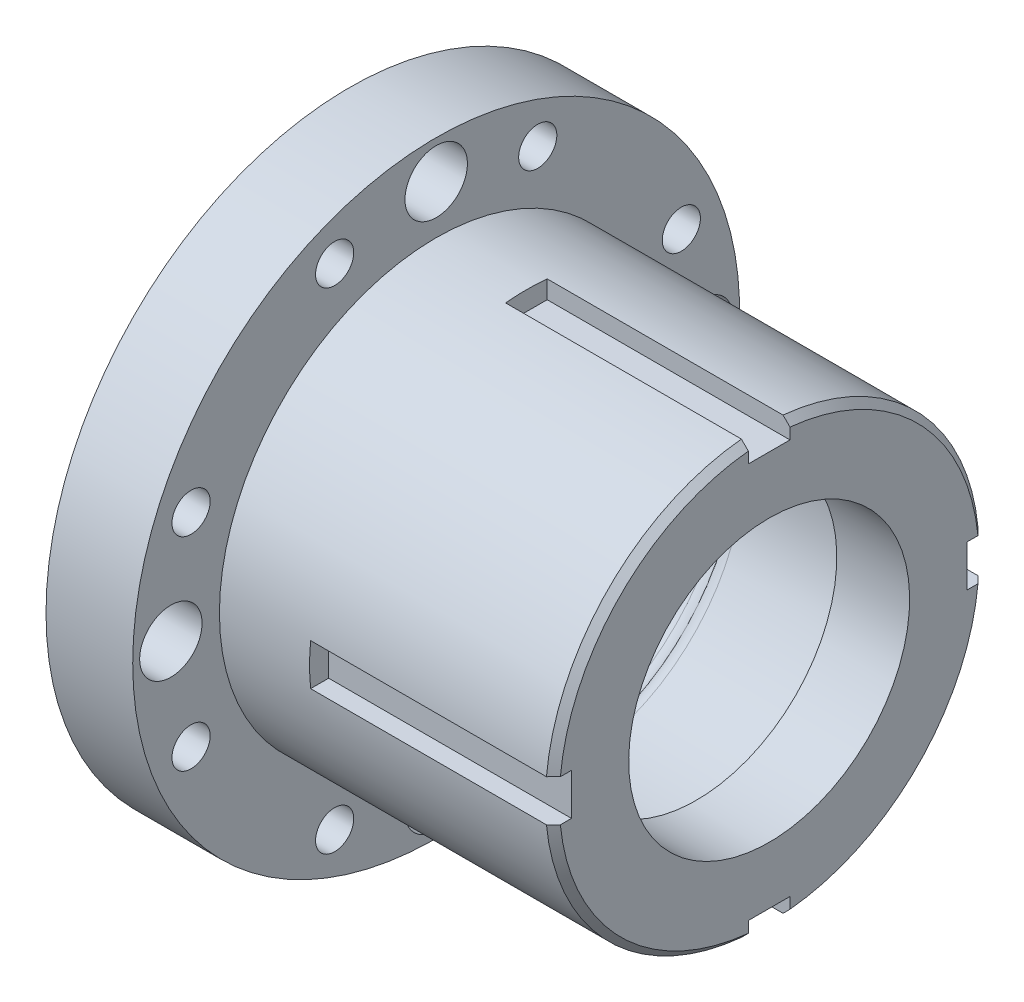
ISO-10303-21;
HEADER;
FILE_DESCRIPTION(('STEP AP214'),'2;1');
FILE_NAME('part.step','',(''),(''),'','','');
FILE_SCHEMA(('AUTOMOTIVE_DESIGN { 1 0 10303 214 1 1 1 1 }'));
ENDSEC;
DATA;
#1=APPLICATION_CONTEXT('core data for automotive mechanical design processes');
#2=APPLICATION_PROTOCOL_DEFINITION('international standard','automotive_design',2000,#1);
#3=PRODUCT_CONTEXT('',#1,'mechanical');
#4=PRODUCT('Part','Part','',(#3));
#5=PRODUCT_RELATED_PRODUCT_CATEGORY('part','',(#4));
#6=PRODUCT_DEFINITION_FORMATION('','',#4);
#7=PRODUCT_DEFINITION_CONTEXT('part definition',#1,'design');
#8=PRODUCT_DEFINITION('design','',#6,#7);
#9=PRODUCT_DEFINITION_SHAPE('','',#8);
#10=(LENGTH_UNIT() NAMED_UNIT(*) SI_UNIT(.MILLI.,.METRE.));
#11=(NAMED_UNIT(*) PLANE_ANGLE_UNIT() SI_UNIT($,.RADIAN.));
#12=(NAMED_UNIT(*) SI_UNIT($,.STERADIAN.) SOLID_ANGLE_UNIT());
#13=UNCERTAINTY_MEASURE_WITH_UNIT(LENGTH_MEASURE(1.E-05),#10,'distance_accuracy_value','');
#14=(GEOMETRIC_REPRESENTATION_CONTEXT(3) GLOBAL_UNCERTAINTY_ASSIGNED_CONTEXT((#13)) GLOBAL_UNIT_ASSIGNED_CONTEXT((#10,
#11,#12)) REPRESENTATION_CONTEXT('',''));
#15=CARTESIAN_POINT('',(0.,0.,0.));
#16=DIRECTION('',(0.,0.,1.));
#17=DIRECTION('',(1.,0.,0.));
#18=AXIS2_PLACEMENT_3D('',#15,#16,#17);
#19=CARTESIAN_POINT('',(100.,0.,0.));
#20=DIRECTION('',(-1.,0.,0.));
#21=DIRECTION('',(0.,0.,1.));
#22=AXIS2_PLACEMENT_3D('',#19,#20,#21);
#23=CYLINDRICAL_SURFACE('',#22,50.);
#24=CARTESIAN_POINT('',(63.6602540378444,0.,0.));
#25=DIRECTION('',(-1.,0.,0.));
#26=DIRECTION('',(0.,0.,1.));
#27=AXIS2_PLACEMENT_3D('',#24,#25,#26);
#28=CIRCLE('',#27,50.);
#29=CARTESIAN_POINT('',(63.6602540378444,-49.8344499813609,4.06541449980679));
#30=VERTEX_POINT('',#29);
#31=CARTESIAN_POINT('',(63.6602540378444,-49.8344499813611,-4.06541449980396));
#32=VERTEX_POINT('',#31);
#33=EDGE_CURVE('E55',#30,#32,#28,.T.);
#34=ORIENTED_EDGE('',*,*,#33,.T.);
#35=CARTESIAN_POINT('',(54.1669805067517,-54.763409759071,5.09597483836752));
#36=CARTESIAN_POINT('',(60.,-55.7328292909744,4.91823846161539));
#37=CARTESIAN_POINT('',(60.,-49.9141201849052,5.98505859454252));
#38=CARTESIAN_POINT('',(54.2029868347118,-54.7654923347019,5.07358929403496));
#39=CARTESIAN_POINT('',(60.,-55.6889586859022,4.92085566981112));
#40=CARTESIAN_POINT('',(60.,-49.895533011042,5.88369520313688));
#41=CARTESIAN_POINT('',(54.240271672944,-54.7676837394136,5.04989612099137));
#42=CARTESIAN_POINT('',(60.,-55.6434157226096,4.9196513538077));
#43=CARTESIAN_POINT('',(60.,-49.8794668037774,5.78189206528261));
#44=CARTESIAN_POINT('',(54.3174971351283,-54.7723071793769,4.99950141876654));
#45=CARTESIAN_POINT('',(60.,-55.5499845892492,4.90899441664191));
#46=CARTESIAN_POINT('',(60.,-49.8521884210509,5.57766581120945));
#47=CARTESIAN_POINT('',(54.3574369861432,-54.7747391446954,4.97280076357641));
#48=CARTESIAN_POINT('',(60.,-55.5021414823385,4.89962057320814));
#49=CARTESIAN_POINT('',(60.,-49.8409748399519,5.47524288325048));
#50=CARTESIAN_POINT('',(54.4812746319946,-54.7824232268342,4.88767741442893));
#51=CARTESIAN_POINT('',(60.,-55.3569383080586,4.85877973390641));
#52=CARTESIAN_POINT('',(60.,-49.8143486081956,5.16770458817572));
#53=CARTESIAN_POINT('',(54.5693159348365,-54.7880706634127,4.82415767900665));
#54=CARTESIAN_POINT('',(60.,-55.2566219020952,4.81474535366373));
#55=CARTESIAN_POINT('',(60.,-49.8058867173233,4.96196292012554));
#56=CARTESIAN_POINT('',(54.7567829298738,-54.80060409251,4.67965054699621));
#57=CARTESIAN_POINT('',(60.,-55.0550329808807,4.68967443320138));
#58=CARTESIAN_POINT('',(60.,-49.805525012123,4.55077795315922));
#59=CARTESIAN_POINT('',(54.856195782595,-54.8074886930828,4.5986827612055));
#60=CARTESIAN_POINT('',(60.,-54.9539678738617,4.6095227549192));
#61=CARTESIAN_POINT('',(60.,-49.8136066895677,4.34533457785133));
#62=CARTESIAN_POINT('',(55.01381995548,-54.8188802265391,4.46009722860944));
#63=CARTESIAN_POINT('',(60.,-54.8048072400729,4.4597537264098));
#64=CARTESIAN_POINT('',(60.,-49.8361543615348,4.03794526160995));
#65=CARTESIAN_POINT('',(55.0677977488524,-54.822856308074,4.41102767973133));
#66=CARTESIAN_POINT('',(60.,-54.7558849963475,4.40545981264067));
#67=CARTESIAN_POINT('',(60.,-49.8454124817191,3.93557831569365));
#68=CARTESIAN_POINT('',(55.1784399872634,-54.831177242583,4.30636412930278));
#69=CARTESIAN_POINT('',(60.,-54.6597507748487,4.28732094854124));
#70=CARTESIAN_POINT('',(60.,-49.8670150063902,3.73117755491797));
#71=CARTESIAN_POINT('',(55.2351042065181,-54.8355220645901,4.25077067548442));
#72=CARTESIAN_POINT('',(60.,-54.6125371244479,4.22359937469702));
#73=CARTESIAN_POINT('',(60.,-49.8793591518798,3.62914371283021));
#74=CARTESIAN_POINT('',(55.3543667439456,-54.84485872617,4.12861259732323));
#75=CARTESIAN_POINT('',(60.,-54.5176484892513,4.08249557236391));
#76=CARTESIAN_POINT('',(60.,-49.9075237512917,3.41936080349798));
#77=CARTESIAN_POINT('',(55.4171173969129,-54.8498737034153,4.06159126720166));
#78=CARTESIAN_POINT('',(60.,-54.4700682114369,4.00461919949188));
#79=CARTESIAN_POINT('',(60.,-49.9235076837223,3.31163399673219));
#80=CARTESIAN_POINT('',(55.5449359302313,-54.8603154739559,3.91803147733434));
#81=CARTESIAN_POINT('',(60.,-54.3780617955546,3.83806311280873));
#82=CARTESIAN_POINT('',(60.,-49.9578930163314,3.09656567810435));
#83=CARTESIAN_POINT('',(55.6100039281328,-54.8657422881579,3.84149253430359));
#84=CARTESIAN_POINT('',(60.,-54.3336093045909,3.7495251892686));
#85=CARTESIAN_POINT('',(60.,-49.9762945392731,2.98922418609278));
#86=CARTESIAN_POINT('',(55.741821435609,-54.8769757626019,3.67753736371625));
#87=CARTESIAN_POINT('',(60.,-54.2483471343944,3.56160400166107));
#88=CARTESIAN_POINT('',(60.,-50.0148809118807,2.77481707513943));
#89=CARTESIAN_POINT('',(55.8085716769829,-54.8827825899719,3.59011633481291));
#90=CARTESIAN_POINT('',(60.,-54.2075005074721,3.46234778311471));
#91=CARTESIAN_POINT('',(60.,-50.0350665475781,2.6677515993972));
#92=CARTESIAN_POINT('',(55.9426958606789,-54.8946970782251,3.4030875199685));
#93=CARTESIAN_POINT('',(60.,-54.1299288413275,3.25312567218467));
#94=CARTESIAN_POINT('',(60.,-50.0764892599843,2.45382784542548));
#95=CARTESIAN_POINT('',(56.0100697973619,-54.9008047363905,3.30347984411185));
#96=CARTESIAN_POINT('',(60.,-54.093153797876,3.14327141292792));
#97=CARTESIAN_POINT('',(60.,-50.0977263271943,2.34696956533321));
#98=CARTESIAN_POINT('',(56.1438169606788,-54.9131724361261,3.09108076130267));
#99=CARTESIAN_POINT('',(60.,-54.0241853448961,2.91336272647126));
#100=CARTESIAN_POINT('',(60.,-50.1403720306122,2.13361173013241));
#101=CARTESIAN_POINT('',(56.2101925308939,-54.9194319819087,2.97832860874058));
#102=CARTESIAN_POINT('',(60.,-53.9919207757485,2.79342087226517));
#103=CARTESIAN_POINT('',(60.,-50.1617799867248,2.02711203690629));
#104=CARTESIAN_POINT('',(56.3402516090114,-54.9319237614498,2.73828116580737));
#105=CARTESIAN_POINT('',(60.,-53.9321132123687,2.54334955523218));
#106=CARTESIAN_POINT('',(60.,-50.2039207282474,1.81397557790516));
#107=CARTESIAN_POINT('',(56.4039350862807,-54.9381559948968,2.61098571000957));
#108=CARTESIAN_POINT('',(60.,-53.9045043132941,2.41325121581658));
#109=CARTESIAN_POINT('',(60.,-50.2246535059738,1.70733881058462));
#110=CARTESIAN_POINT('',(56.5261331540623,-54.9503108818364,2.34126484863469));
#111=CARTESIAN_POINT('',(60.,-53.8542190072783,2.14344961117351));
#112=CARTESIAN_POINT('',(60.,-50.2644412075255,1.49376835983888));
#113=CARTESIAN_POINT('',(56.584648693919,-54.9562335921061,2.19884223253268));
#114=CARTESIAN_POINT('',(60.,-53.83147236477,2.0037137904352));
#115=CARTESIAN_POINT('',(60.,-50.283496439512,1.38683473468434));
#116=CARTESIAN_POINT('',(56.6935450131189,-54.9674065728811,1.89911275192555));
#117=CARTESIAN_POINT('',(60.,-53.7910465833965,1.71556079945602));
#118=CARTESIAN_POINT('',(60.,-50.3188719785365,1.17250430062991));
#119=CARTESIAN_POINT('',(56.7439258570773,-54.9726568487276,1.7418060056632));
#120=CARTESIAN_POINT('',(60.,-53.7732995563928,1.56702463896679));
#121=CARTESIAN_POINT('',(60.,-50.3351923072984,1.0651074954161));
#122=CARTESIAN_POINT('',(56.8111079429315,-54.9797307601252,1.49532154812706));
#123=CARTESIAN_POINT('',(60.,-53.7504539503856,1.33796301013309));
#124=CARTESIAN_POINT('',(60.,-50.3568772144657,0.903339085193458));
#125=CARTESIAN_POINT('',(56.8321492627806,-54.9819600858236,1.41116374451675));
#126=CARTESIAN_POINT('',(60.,-53.7434613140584,1.26049538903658));
#127=CARTESIAN_POINT('',(60.,-50.3636541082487,0.849156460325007));
#128=CARTESIAN_POINT('',(56.8709386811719,-54.9860882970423,1.23993078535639));
#129=CARTESIAN_POINT('',(60.,-53.7307823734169,1.10402564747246));
#130=CARTESIAN_POINT('',(60.,-50.3761308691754,0.740667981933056));
#131=CARTESIAN_POINT('',(56.8886868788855,-54.9879871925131,1.15285571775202));
#132=CARTESIAN_POINT('',(60.,-53.7250892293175,1.02498949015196));
#133=CARTESIAN_POINT('',(60.,-50.3818307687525,0.686362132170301));
#134=CARTESIAN_POINT('',(56.9205547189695,-54.991409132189,0.97605849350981));
#135=CARTESIAN_POINT('',(60.,-53.715001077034,0.865524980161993));
#136=CARTESIAN_POINT('',(60.,-50.3920452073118,0.577639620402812));
#137=CARTESIAN_POINT('',(56.9346744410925,-54.992932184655,0.886336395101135));
#138=CARTESIAN_POINT('',(60.,-53.7106003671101,0.785057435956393));
#139=CARTESIAN_POINT('',(60.,-50.3965597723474,0.523222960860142));
#140=CARTESIAN_POINT('',(56.9589369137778,-54.9955559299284,0.705020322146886));
#141=CARTESIAN_POINT('',(60.,-53.7031132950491,0.623206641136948));
#142=CARTESIAN_POINT('',(60.,-50.4043122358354,0.414298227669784));
#143=CARTESIAN_POINT('',(56.9690796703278,-54.9966566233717,0.613426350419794));
#144=CARTESIAN_POINT('',(60.,-53.7000224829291,0.541778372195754));
#145=CARTESIAN_POINT('',(60.,-50.40755013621,0.359790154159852));
#146=CARTESIAN_POINT('',(56.9851674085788,-54.9984050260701,0.428845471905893));
#147=CARTESIAN_POINT('',(60.,-53.695148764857,0.378247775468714));
#148=CARTESIAN_POINT('',(60.,-50.4126796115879,0.250753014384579));
#149=CARTESIAN_POINT('',(56.9911156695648,-54.9990530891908,0.335859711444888));
#150=CARTESIAN_POINT('',(60.,-53.6933618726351,0.296097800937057));
#151=CARTESIAN_POINT('',(60.,-50.4145722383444,0.196223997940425));
#152=CARTESIAN_POINT('',(56.9986664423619,-54.9998762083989,0.149365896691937));
#153=CARTESIAN_POINT('',(60.,-53.6910987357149,0.131601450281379));
#154=CARTESIAN_POINT('',(60.,-50.416975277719,0.0871353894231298));
#155=CARTESIAN_POINT('',(57.0002689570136,-55.0000512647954,0.0558578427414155));
#156=CARTESIAN_POINT('',(60.,-53.6906210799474,0.0492040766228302));
#157=CARTESIAN_POINT('',(60.,-50.4174856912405,0.0325757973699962));
#158=CARTESIAN_POINT('',(56.9990919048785,-54.9999228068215,-0.131153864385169));
#159=CARTESIAN_POINT('',(60.,-53.690972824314,-0.115555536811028));
#160=CARTESIAN_POINT('',(60.,-50.4171116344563,-0.0765380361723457));
#161=CARTESIAN_POINT('',(56.996312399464,-54.9996192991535,-0.224657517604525));
#162=CARTESIAN_POINT('',(60.,-53.6918024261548,-0.197969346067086));
#163=CARTESIAN_POINT('',(60.,-50.4162271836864,-0.131092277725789));
#164=CARTESIAN_POINT('',(56.9864478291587,-54.9985447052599,-0.410773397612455));
#165=CARTESIAN_POINT('',(60.,-53.6947655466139,-0.362273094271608));
#166=CARTESIAN_POINT('',(60.,-50.4130856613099,-0.240161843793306));
#167=CARTESIAN_POINT('',(56.9793626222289,-54.9977736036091,-0.503385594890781));
#168=CARTESIAN_POINT('',(60.,-53.6969009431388,-0.444213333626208));
#169=CARTESIAN_POINT('',(60.,-50.4108285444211,-0.294677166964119));
#170=CARTESIAN_POINT('',(56.9518253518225,-54.994784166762,-0.779438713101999));
#171=CARTESIAN_POINT('',(60.,-53.7052820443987,-0.689374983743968));
#172=CARTESIAN_POINT('',(60.,-50.4020452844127,-0.458399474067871));
#173=CARTESIAN_POINT('',(56.9250959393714,-54.9918902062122,-0.960610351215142));
#174=CARTESIAN_POINT('',(60.,-53.7135123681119,-0.851475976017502));
#175=CARTESIAN_POINT('',(60.,-50.3935085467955,-0.5675031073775));
#176=CARTESIAN_POINT('',(56.8573306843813,-54.9846302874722,-1.31203911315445));
#177=CARTESIAN_POINT('',(60.,-53.7351426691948,-1.16949590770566));
#178=CARTESIAN_POINT('',(60.,-50.3717683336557,-0.785233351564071));
#179=CARTESIAN_POINT('',(56.8162940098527,-54.9802642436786,-1.48229560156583));
#180=CARTESIAN_POINT('',(60.,-53.7485914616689,-1.32572139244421));
#181=CARTESIAN_POINT('',(60.,-50.3585645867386,-0.893859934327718));
#182=CARTESIAN_POINT('',(56.7230827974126,-54.9704815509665,-1.80913110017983));
#183=CARTESIAN_POINT('',(60.,-53.7805979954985,-1.63035304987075));
#184=CARTESIAN_POINT('',(60.,-50.3284443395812,-1.11071360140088));
#185=CARTESIAN_POINT('',(56.6708955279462,-54.9650637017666,-1.9656941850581));
#186=CARTESIAN_POINT('',(60.,-53.7992244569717,-1.77895606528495));
#187=CARTESIAN_POINT('',(60.,-50.3115235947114,-1.21894008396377));
#188=CARTESIAN_POINT('',(56.5587301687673,-54.9536041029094,-2.26354504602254));
#189=CARTESIAN_POINT('',(60.,-53.8414677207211,-2.06692655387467));
#190=CARTESIAN_POINT('',(60.,-50.275061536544,-1.43494177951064));
#191=CARTESIAN_POINT('',(56.4987520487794,-54.9475623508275,-2.40483276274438));
#192=CARTESIAN_POINT('',(60.,-53.8651546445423,-2.20640188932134));
#193=CARTESIAN_POINT('',(60.,-50.2555202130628,-1.54271699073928));
#194=CARTESIAN_POINT('',(56.3585060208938,-54.9336852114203,-2.70521246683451));
#195=CARTESIAN_POINT('',(60.,-53.9239236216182,-2.50914823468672));
#196=CARTESIAN_POINT('',(60.,-50.2098616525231,-1.78467700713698));
#197=CARTESIAN_POINT('',(56.2768963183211,-54.9257767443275,-2.86002364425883));
#198=CARTESIAN_POINT('',(60.,-53.9604115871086,-2.66932290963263));
#199=CARTESIAN_POINT('',(60.,-50.1833158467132,-1.91877941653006));
#200=CARTESIAN_POINT('',(56.110851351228,-54.9100719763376,-3.14716669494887));
#201=CARTESIAN_POINT('',(60.,-54.0404579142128,-2.97337223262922));
#202=CARTESIAN_POINT('',(60.,-50.1297908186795,-2.18682084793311));
#203=CARTESIAN_POINT('',(56.0264176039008,-54.9022756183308,-3.27951041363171));
#204=CARTESIAN_POINT('',(60.,-54.0841389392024,-3.11714982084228));
#205=CARTESIAN_POINT('',(60.,-50.1028118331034,-2.32075991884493));
#206=CARTESIAN_POINT('',(55.8579975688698,-54.8871119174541,-3.52419275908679));
#207=CARTESIAN_POINT('',(60.,-54.1779411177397,-3.38812574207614));
#208=CARTESIAN_POINT('',(60.,-50.0501349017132,-2.58874470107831));
#209=CARTESIAN_POINT('',(55.7740108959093,-54.8797441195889,-3.6365528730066));
#210=CARTESIAN_POINT('',(60.,-54.2281607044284,-3.51514176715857));
#211=CARTESIAN_POINT('',(60.,-50.0244356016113,-2.7227901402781));
#212=CARTESIAN_POINT('',(55.6085193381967,-54.8655947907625,-3.84412586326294));
#213=CARTESIAN_POINT('',(60.,-54.3342958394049,-3.75270459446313));
#214=CARTESIAN_POINT('',(60.,-49.9757446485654,-2.99139692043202));
#215=CARTESIAN_POINT('',(55.527014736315,-54.8588133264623,-3.93933679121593));
#216=CARTESIAN_POINT('',(60.,-54.39028952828,-3.86299182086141));
#217=CARTESIAN_POINT('',(60.,-49.9527533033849,-3.12595831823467));
#218=CARTESIAN_POINT('',(55.3680866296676,-54.8459267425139,-4.11485307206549));
#219=CARTESIAN_POINT('',(60.,-54.5067850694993,-4.06674215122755));
#220=CARTESIAN_POINT('',(60.,-49.9108058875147,-3.39527604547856));
#221=CARTESIAN_POINT('',(55.2906508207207,-54.8398195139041,-4.19520546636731));
#222=CARTESIAN_POINT('',(60.,-54.5673213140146,-4.15998151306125));
#223=CARTESIAN_POINT('',(60.,-49.8918370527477,-3.5300303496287));
#224=CARTESIAN_POINT('',(55.1403277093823,-54.8282624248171,-4.34363540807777));
#225=CARTESIAN_POINT('',(60.,-54.6919022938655,-4.33014758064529));
#226=CARTESIAN_POINT('',(60.,-49.8589152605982,-3.80016226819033));
#227=CARTESIAN_POINT('',(55.0674404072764,-54.8228125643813,-4.41171295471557));
#228=CARTESIAN_POINT('',(60.,-54.7559629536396,-4.40678748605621));
#229=CARTESIAN_POINT('',(60.,-49.8449623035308,-3.93553988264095));
#230=CARTESIAN_POINT('',(54.9265741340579,-54.8125407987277,-4.53754843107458));
#231=CARTESIAN_POINT('',(60.,-54.8862783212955,-4.54392363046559));
#232=CARTESIAN_POINT('',(60.,-49.8230012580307,-4.20681090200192));
#233=CARTESIAN_POINT('',(54.8585959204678,-54.8077189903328,-4.59530477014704));
#234=CARTESIAN_POINT('',(60.,-54.9525191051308,-4.60413853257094));
#235=CARTESIAN_POINT('',(60.,-49.8149940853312,-4.34270438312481));
#236=CARTESIAN_POINT('',(54.7276784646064,-54.7986572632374,-4.70213059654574));
#237=CARTESIAN_POINT('',(60.,-55.0857287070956,-4.70868501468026));
#238=CARTESIAN_POINT('',(60.,-49.8057313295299,-4.61471856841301));
#239=CARTESIAN_POINT('',(54.6647388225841,-54.7944172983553,-4.75120077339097));
#240=CARTESIAN_POINT('',(60.,-55.1526556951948,-4.75275732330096));
#241=CARTESIAN_POINT('',(60.,-49.8044752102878,-4.75083925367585));
#242=CARTESIAN_POINT('',(54.5316938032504,-54.7856644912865,-4.85118309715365));
#243=CARTESIAN_POINT('',(60.,-55.2992620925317,-4.83286488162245));
#244=CARTESIAN_POINT('',(60.,-49.8099035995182,-5.05035659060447));
#245=CARTESIAN_POINT('',(54.4626955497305,-54.7812684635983,-4.90047844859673));
#246=CARTESIAN_POINT('',(60.,-55.3784583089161,-4.86499564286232));
#247=CARTESIAN_POINT('',(60.,-49.8182370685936,-5.21372931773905));
#248=CARTESIAN_POINT('',(54.3316758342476,-54.7731424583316,-4.99047916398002));
#249=CARTESIAN_POINT('',(60.,-55.5328703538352,-4.90809146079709));
#250=CARTESIAN_POINT('',(60.,-49.8466250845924,-5.53936794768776));
#251=CARTESIAN_POINT('',(54.2696501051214,-54.7694120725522,-5.03118979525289));
#252=CARTESIAN_POINT('',(60.,-55.6079325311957,-4.91872313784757));
#253=CARTESIAN_POINT('',(60.,-49.8666724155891,-5.70163446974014));
#254=CARTESIAN_POINT('',(54.1501150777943,-54.762402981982,-5.10692943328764));
#255=CARTESIAN_POINT('',(60.,-55.7538660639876,-4.92036534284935));
#256=CARTESIAN_POINT('',(60.,-49.9201903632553,-6.02984116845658));
#257=CARTESIAN_POINT('',(54.092841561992,-54.7591447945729,-5.14170805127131));
#258=CARTESIAN_POINT('',(60.,-55.8242548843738,-4.91036768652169));
#259=CARTESIAN_POINT('',(60.,-49.9541085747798,-6.19570964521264));
#260=CARTESIAN_POINT('',(53.9847546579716,-54.7531474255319,-5.20517081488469));
#261=CARTESIAN_POINT('',(60.,-55.9551282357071,-4.87147755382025));
#262=CARTESIAN_POINT('',(60.,-50.035953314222,-6.52424608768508));
#263=CARTESIAN_POINT('',(53.9339526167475,-54.7504091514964,-5.2338443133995));
#264=CARTESIAN_POINT('',(60.,-56.0153675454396,-4.84232303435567));
#265=CARTESIAN_POINT('',(60.,-50.0839039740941,-6.68690802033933));
#266=CARTESIAN_POINT('',(53.8861866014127,-54.7478887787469,-5.26010741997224));
#267=CARTESIAN_POINT('',(60.,-56.0687970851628,-4.8052491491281));
#268=CARTESIAN_POINT('',(60.,-50.139121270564,-6.84714870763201));
#269=(BOUNDED_SURFACE() B_SPLINE_SURFACE(3,2,((#35,#36,#37),(#38,#39,#40),(#41,#42,#43),(#44,
#45,#46),(#47,#48,#49),(#50,#51,#52),(#53,#54,#55),(#56,#57,#58),(#59,#60,#61),(#62,#63,#64),
(#65,#66,#67),(#68,#69,#70),(#71,#72,#73),(#74,#75,#76),(#77,#78,#79),(#80,#81,#82),(#83,#84,
#85),(#86,#87,#88),(#89,#90,#91),(#92,#93,#94),(#95,#96,#97),(#98,#99,#100),(#101,#102,#103),
(#104,#105,#106),(#107,#108,#109),(#110,#111,#112),(#113,#114,#115),(#116,#117,#118),(#119,#120,
#121),(#122,#123,#124),(#125,#126,#127),(#128,#129,#130),(#131,#132,#133),(#134,#135,#136),
(#137,#138,#139),(#140,#141,#142),(#143,#144,#145),(#146,#147,#148),(#149,#150,#151),(#152,#153,
#154),(#155,#156,#157),(#158,#159,#160),(#161,#162,#163),(#164,#165,#166),(#167,#168,#169),
(#170,#171,#172),(#173,#174,#175),(#176,#177,#178),(#179,#180,#181),(#182,#183,#184),(#185,#186,
#187),(#188,#189,#190),(#191,#192,#193),(#194,#195,#196),(#197,#198,#199),(#200,#201,#202),
(#203,#204,#205),(#206,#207,#208),(#209,#210,#211),(#212,#213,#214),(#215,#216,#217),(#218,#219,
#220),(#221,#222,#223),(#224,#225,#226),(#227,#228,#229),(#230,#231,#232),(#233,#234,#235),
(#236,#237,#238),(#239,#240,#241),(#242,#243,#244),(#245,#246,#247),(#248,#249,#250),(#251,#252,
#253),(#254,#255,#256),(#257,#258,#259),(#260,#261,#262),(#263,#264,#265),(#266,#267,#268)),
.UNSPECIFIED.,.F.,.F.,.F.) B_SPLINE_SURFACE_WITH_KNOTS((4,2,2,2,2,2,2,2,2,2,2,2,2,2,2,2,2,2,2,2,
2,2,2,2,2,2,2,2,2,2,2,2,2,2,2,2,2,2,4),(3,3),(0.,0.30909071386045,0.618091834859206,
1.23501102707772,1.85124041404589,2.15955550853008,2.46784473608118,2.79452937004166,
3.12123059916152,3.44807648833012,3.77491942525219,4.10081015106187,4.42670458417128,
4.75253902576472,5.07837087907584,5.24217624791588,5.40597668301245,5.56977351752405,
5.73357010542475,5.89723849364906,6.06090677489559,6.22457276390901,6.38824415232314,
6.71642505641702,7.04462504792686,7.3732017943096,7.70177981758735,8.11188609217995,
8.52177547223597,8.93122142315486,9.34071386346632,9.74888680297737,10.1570597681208,
10.5652955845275,10.9734989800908,11.4638549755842,11.953909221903,12.4612107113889,
12.969389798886),(0.,1.),
.UNSPECIFIED.) GEOMETRIC_REPRESENTATION_ITEM() RATIONAL_B_SPLINE_SURFACE(((1.,0.645521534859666,
1.),(1.,0.648310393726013,1.),(1.,0.651180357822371,1.),(1.,0.657083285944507,1.),(1.,
0.660116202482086,1.),(1.,0.669452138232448,1.),(1.,0.676002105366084,1.),(1.,0.689728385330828,
1.),(1.,0.696903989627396,1.),(1.,0.708093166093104,1.),(1.,0.711895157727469,1.),(1.,
0.719624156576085,1.),(1.,0.723551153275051,1.),(1.,0.73174752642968,1.),(1.,0.736023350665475,
1.),(1.,0.744655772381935,1.),(1.,0.749012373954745,1.),(1.,0.757760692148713,1.),(1.,
0.762152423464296,1.),(1.,0.770901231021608,1.),(1.,0.775258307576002,1.),(1.,0.783836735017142,
1.),(1.,0.788058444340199,1.),(1.,0.7962675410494,1.),(1.,0.800254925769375,1.),(1.,
0.807853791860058,1.),(1.,0.811465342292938,1.),(1.,0.818147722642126,1.),(1.,0.821218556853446,
1.),(1.,0.82529550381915,1.),(1.,0.826568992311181,1.),(1.,0.828912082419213,1.),(1.,
0.82998169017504,1.),(1.,0.831899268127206,1.),(1.,0.832747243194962,1.),(1.,0.834202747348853,
1.),(1.,0.834810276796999,1.),(1.,0.835773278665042,1.),(1.,0.836128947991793,1.),(1.,
0.836580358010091,1.),(1.,0.836676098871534,1.),(1.,0.836605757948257,1.),(1.,0.836439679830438,
1.),(1.,0.835849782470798,1.),(1.,0.835425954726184,1.),(1.,0.833776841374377,1.),(1.,
0.832174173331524,1.),(1.,0.828092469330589,1.),(1.,0.825613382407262,1.),(1.,0.819948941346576,
1.),(1.,0.816762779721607,1.),(1.,0.809867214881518,1.),(1.,0.806157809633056,1.),(1.,
0.797417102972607,1.),(1.,0.792286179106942,1.),(1.,0.781737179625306,1.),(1.,0.776319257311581,
1.),(1.,0.765395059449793,1.),(1.,0.759888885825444,1.),(1.,0.748920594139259,1.),(1.,
0.743458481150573,1.),(1.,0.732692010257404,1.),(1.,0.727387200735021,1.),(1.,0.716979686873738,
1.),(1.,0.71187698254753,1.),(1.,0.701913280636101,1.),(1.,0.697052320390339,1.),(1.,
0.687597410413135,1.),(1.,0.68300343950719,1.),(1.,0.673199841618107,1.),(1.,0.668052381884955,
1.),(1.,0.658173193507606,1.),(1.,0.653441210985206,1.),(1.,0.644230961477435,1.),(1.,
0.639767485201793,1.),(1.,0.63126329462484,1.),(1.,0.627223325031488,1.),(1.,0.6233928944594,1.))) REPRESENTATION_ITEM('') SURFACE());
#270=CARTESIAN_POINT('',(63.7002101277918,-49.7849262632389,4.63261448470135));
#271=CARTESIAN_POINT('',(60.750197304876,-49.742996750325,5.0832148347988));
#272=CARTESIAN_POINT('',(59.3501050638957,-52.3387695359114,5.54046725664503));
#273=CARTESIAN_POINT('',(63.6982234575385,-49.786017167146,4.6208909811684));
#274=CARTESIAN_POINT('',(60.7521787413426,-49.7456746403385,5.05558526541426));
#275=CARTESIAN_POINT('',(59.3491117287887,-52.333988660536,5.50462822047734));
#276=CARTESIAN_POINT('',(63.6963353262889,-49.7871051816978,4.60915359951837));
#277=CARTESIAN_POINT('',(60.7539310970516,-49.7482731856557,5.02864545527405));
#278=CARTESIAN_POINT('',(59.3481676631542,-52.3298076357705,5.46977050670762));
#279=CARTESIAN_POINT('',(63.6927437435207,-49.7892749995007,4.58565526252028));
#280=CARTESIAN_POINT('',(60.7570620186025,-49.7533283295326,4.97598773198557));
#281=CARTESIAN_POINT('',(59.3463718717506,-52.3224526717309,5.40176567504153));
#282=CARTESIAN_POINT('',(63.6910402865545,-49.790356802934,4.57389430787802));
#283=CARTESIAN_POINT('',(60.7584412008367,-49.7557854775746,4.95026434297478));
#284=CARTESIAN_POINT('',(59.3455201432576,-52.3192787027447,5.36861850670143));
#285=CARTESIAN_POINT('',(63.6878058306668,-49.7925136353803,4.55035444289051));
#286=CARTESIAN_POINT('',(60.7609126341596,-49.7605778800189,4.89984791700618));
#287=CARTESIAN_POINT('',(59.3439029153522,-52.3137454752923,5.30378649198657));
#288=CARTESIAN_POINT('',(63.6862748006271,-49.7935886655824,4.53857553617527));
#289=CARTESIAN_POINT('',(60.7620053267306,-49.7629135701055,4.87515054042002));
#290=CARTESIAN_POINT('',(59.3431374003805,-52.3113860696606,5.27210138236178));
#291=CARTESIAN_POINT('',(63.683374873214,-49.7957318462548,4.51500055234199));
#292=CARTESIAN_POINT('',(60.7639698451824,-49.7674850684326,4.82656548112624));
#293=CARTESIAN_POINT('',(59.34168743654,-52.3073404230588,5.20989089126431));
#294=CARTESIAN_POINT('',(63.6820059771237,-49.7967999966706,4.50320447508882));
#295=CARTESIAN_POINT('',(60.7648419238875,-49.7697211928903,4.80267460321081));
#296=CARTESIAN_POINT('',(59.3410029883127,-52.3056541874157,5.17936551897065));
#297=CARTESIAN_POINT('',(63.6794229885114,-49.7989276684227,4.47961417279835));
#298=CARTESIAN_POINT('',(60.7663911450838,-49.7740860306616,4.75580414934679));
#299=CARTESIAN_POINT('',(59.3397114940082,-52.3028742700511,5.1196382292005));
#300=CARTESIAN_POINT('',(63.6782086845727,-49.7999871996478,4.46781996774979));
#301=CARTESIAN_POINT('',(60.7670687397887,-49.7762151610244,4.73282056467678));
#302=CARTESIAN_POINT('',(59.3391043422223,-52.30177977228,5.09043454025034));
#303=CARTESIAN_POINT('',(63.6759222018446,-49.8020988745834,4.44421962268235));
#304=CARTESIAN_POINT('',(60.7682674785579,-49.7803767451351,4.68766730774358));
#305=CARTESIAN_POINT('',(59.3379611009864,-52.3000847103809,5.03322676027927));
#306=CARTESIAN_POINT('',(63.6748500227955,-49.8031510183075,4.43241348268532));
#307=CARTESIAN_POINT('',(60.7687887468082,-49.7824094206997,4.66549533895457));
#308=CARTESIAN_POINT('',(59.3374250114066,-52.2994841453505,5.00522266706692));
#309=CARTESIAN_POINT('',(63.6718330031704,-49.8062961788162,4.39697888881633));
#310=CARTESIAN_POINT('',(60.7701737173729,-49.7883825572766,4.60000182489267));
#311=CARTESIAN_POINT('',(59.3359165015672,-52.2982944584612,4.92270941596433));
#312=CARTESIAN_POINT('',(63.6700877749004,-49.8083778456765,4.37333513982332));
#313=CARTESIAN_POINT('',(60.7708595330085,-49.7922013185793,4.55766817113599));
#314=CARTESIAN_POINT('',(59.3350438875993,-52.2983174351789,4.86970148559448));
#315=CARTESIAN_POINT('',(63.6678262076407,-49.8114763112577,4.33785299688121));
#316=CARTESIAN_POINT('',(60.7716689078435,-49.7977386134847,4.49562668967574));
#317=CARTESIAN_POINT('',(59.3339131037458,-52.2992476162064,4.79238892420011));
#318=CARTESIAN_POINT('',(63.6671318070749,-49.8125049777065,4.32602460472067));
#319=CARTESIAN_POINT('',(60.7719021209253,-49.7995521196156,4.47519457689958));
#320=CARTESIAN_POINT('',(59.3335659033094,-52.299706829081,4.76698820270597));
#321=CARTESIAN_POINT('',(63.6658555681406,-49.8145543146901,4.30236207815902));
#322=CARTESIAN_POINT('',(60.7723029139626,-49.8031097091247,4.43489561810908));
#323=CARTESIAN_POINT('',(59.3329277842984,-52.3008865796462,4.71704104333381));
#324=CARTESIAN_POINT('',(63.6652737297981,-49.815574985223,4.29052794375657));
#325=CARTESIAN_POINT('',(60.7724705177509,-49.8048538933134,4.41502767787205));
#326=CARTESIAN_POINT('',(59.3326368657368,-52.301607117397,4.69249460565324));
#327=CARTESIAN_POINT('',(63.6636855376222,-49.8186248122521,4.2550189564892));
#328=CARTESIAN_POINT('',(60.7728973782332,-49.8099880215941,4.35622731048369));
#329=CARTESIAN_POINT('',(59.3318427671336,-52.3040936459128,4.62006600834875));
#330=CARTESIAN_POINT('',(63.6628364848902,-49.8206418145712,4.23133717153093));
#331=CARTESIAN_POINT('',(60.7730808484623,-49.81328096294,4.31808227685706));
#332=CARTESIAN_POINT('',(59.3314182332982,-52.306184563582,4.57339380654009));
#333=CARTESIAN_POINT('',(63.6615079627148,-49.8246436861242,4.18395114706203));
#334=CARTESIAN_POINT('',(60.7733357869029,-49.8196564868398,4.24341902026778));
#335=CARTESIAN_POINT('',(59.3307539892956,-52.3109932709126,4.48253528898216));
#336=CARTESIAN_POINT('',(63.6610286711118,-49.8266285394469,4.1602469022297));
#337=CARTESIAN_POINT('',(60.7734072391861,-49.8227394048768,4.20689663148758));
#338=CARTESIAN_POINT('',(59.3305143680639,-52.3137113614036,4.43835017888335));
#339=CARTESIAN_POINT('',(63.6604019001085,-49.8305645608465,4.11283374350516));
#340=CARTESIAN_POINT('',(60.7734904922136,-49.8287265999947,4.13517235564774));
#341=CARTESIAN_POINT('',(59.3302009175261,-52.3196229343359,4.35200469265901));
#342=CARTESIAN_POINT('',(63.6602543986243,-49.8325157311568,4.08912483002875));
#343=CARTESIAN_POINT('',(60.7735023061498,-49.831631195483,4.09996677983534));
#344=CARTESIAN_POINT('',(59.3301270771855,-52.3228163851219,4.3098441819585));
#345=CARTESIAN_POINT('',(63.6602533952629,-49.8378950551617,4.02318426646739));
#346=CARTESIAN_POINT('',(60.7735039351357,-49.8394685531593,4.00389755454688));
#347=CARTESIAN_POINT('',(59.3301264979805,-52.3321458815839,4.19541294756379));
#348=CARTESIAN_POINT('',(63.6607195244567,-49.841286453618,3.9809495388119));
#349=CARTESIAN_POINT('',(60.7734693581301,-49.8442143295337,3.94446014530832));
#350=CARTESIAN_POINT('',(59.3303597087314,-52.3386320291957,4.12534563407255));
#351=CARTESIAN_POINT('',(63.6624056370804,-49.8479609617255,3.89648340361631));
#352=CARTESIAN_POINT('',(60.7734613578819,-49.853266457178,3.82877902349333));
#353=CARTESIAN_POINT('',(59.3312028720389,-52.3521326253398,3.99010670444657));
#354=CARTESIAN_POINT('',(63.6636256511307,-49.8512440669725,3.85425199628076));
#355=CARTESIAN_POINT('',(60.7734879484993,-49.8575733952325,3.77252723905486));
#356=CARTESIAN_POINT('',(59.3318128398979,-52.3591470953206,3.92493528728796));
#357=CARTESIAN_POINT('',(63.6666770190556,-49.857702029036,3.76979341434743));
#358=CARTESIAN_POINT('',(60.7736605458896,-49.8658136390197,3.66265606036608));
#359=CARTESIAN_POINT('',(59.3333384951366,-52.3733988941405,3.79862151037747));
#360=CARTESIAN_POINT('',(63.6685084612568,-49.8608768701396,3.72756624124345));
#361=CARTESIAN_POINT('',(60.7738066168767,-49.8697471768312,3.60903247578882));
#362=CARTESIAN_POINT('',(59.3342542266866,-52.380636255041,3.73747973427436));
#363=CARTESIAN_POINT('',(63.6726635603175,-49.8671178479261,3.6431236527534));
#364=CARTESIAN_POINT('',(60.7742415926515,-49.8772933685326,3.50396016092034));
#365=CARTESIAN_POINT('',(59.3363317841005,-52.3951420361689,3.61851015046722));
#366=CARTESIAN_POINT('',(63.6749872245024,-49.8701839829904,3.60090823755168));
#367=CARTESIAN_POINT('',(60.7745305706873,-49.8809061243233,3.45250905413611));
#368=CARTESIAN_POINT('',(59.3374936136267,-52.4024104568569,3.56068239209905));
#369=CARTESIAN_POINT('',(63.6825457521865,-49.8792228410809,3.47423367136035));
#370=CARTESIAN_POINT('',(60.7756238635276,-49.8913282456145,3.3008471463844));
#371=CARTESIAN_POINT('',(59.3412728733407,-52.4240592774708,3.39134709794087));
#372=CARTESIAN_POINT('',(63.6883662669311,-49.8850325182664,3.3897919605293));
#373=CARTESIAN_POINT('',(60.7766544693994,-49.897712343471,3.20344941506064));
#374=CARTESIAN_POINT('',(59.3441831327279,-52.4382751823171,3.28405476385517));
#375=CARTESIAN_POINT('',(63.7009414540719,-49.8962189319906,3.22094619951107));
#376=CARTESIAN_POINT('',(60.7792352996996,-49.9095939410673,3.01401692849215));
#377=CARTESIAN_POINT('',(59.3504707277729,-52.4657550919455,3.07747903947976));
#378=CARTESIAN_POINT('',(63.7076960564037,-49.9015957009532,3.13654214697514));
#379=CARTESIAN_POINT('',(60.7807860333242,-49.915090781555,2.92198464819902));
#380=CARTESIAN_POINT('',(59.3538480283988,-52.4790191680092,2.97819504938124));
#381=CARTESIAN_POINT('',(63.7216958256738,-49.9119261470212,2.96762498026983));
#382=CARTESIAN_POINT('',(60.7842742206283,-49.9253579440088,2.74187615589));
#383=CARTESIAN_POINT('',(59.3608479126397,-52.5044200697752,2.78551031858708));
#384=CARTESIAN_POINT('',(63.7289416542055,-49.9168792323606,2.88311187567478));
#385=CARTESIAN_POINT('',(60.786212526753,-49.930126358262,2.65381259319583));
#386=CARTESIAN_POINT('',(59.3644708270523,-52.5165553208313,2.69211785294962));
#387=CARTESIAN_POINT('',(63.7435724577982,-49.926355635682,2.71407054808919));
#388=CARTESIAN_POINT('',(60.7903379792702,-49.9390364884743,2.48085670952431));
#389=CARTESIAN_POINT('',(59.3717862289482,-52.539619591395,2.50994633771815));
#390=CARTESIAN_POINT('',(63.7509574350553,-49.9308789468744,2.62954232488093));
#391=CARTESIAN_POINT('',(60.7925252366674,-49.9431773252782,2.39597280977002));
#392=CARTESIAN_POINT('',(59.3754787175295,-52.5505485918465,2.42116736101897));
#393=CARTESIAN_POINT('',(63.7729035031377,-49.9438029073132,2.37596303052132));
#394=CARTESIAN_POINT('',(60.7992669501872,-49.9547862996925,2.14497158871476));
#395=CARTESIAN_POINT('',(59.386451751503,-52.5815258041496,2.16020398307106));
#396=CARTESIAN_POINT('',(63.787260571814,-49.9515608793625,2.20686344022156));
#397=CARTESIAN_POINT('',(60.8039962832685,-49.9614292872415,1.98271995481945));
#398=CARTESIAN_POINT('',(59.3936302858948,-52.5997723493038,1.99333310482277));
#399=CARTESIAN_POINT('',(63.8139251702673,-49.9653593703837,1.86855651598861));
#400=CARTESIAN_POINT('',(60.8131141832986,-49.9729551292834,1.66450642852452));
#401=CARTESIAN_POINT('',(59.4069625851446,-52.6317499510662,1.6684135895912));
#402=CARTESIAN_POINT('',(63.826233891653,-49.9714008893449,1.69934930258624));
#403=CARTESIAN_POINT('',(60.8175008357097,-49.9778344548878,1.50860668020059));
#404=CARTESIAN_POINT('',(59.4131169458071,-52.6454836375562,1.51035985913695));
#405=CARTESIAN_POINT('',(63.8479013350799,-49.9817683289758,1.36071004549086));
#406=CARTESIAN_POINT('',(60.8253836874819,-49.9860700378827,1.20077723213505));
#407=CARTESIAN_POINT('',(59.4239506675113,-52.6687832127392,1.19977282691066));
#408=CARTESIAN_POINT('',(63.8572598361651,-49.9860941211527,1.19127798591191));
#409=CARTESIAN_POINT('',(60.8288774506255,-49.9894230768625,1.04890768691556));
#410=CARTESIAN_POINT('',(59.4286299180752,-52.6783487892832,1.04723993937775));
#411=CARTESIAN_POINT('',(63.8724478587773,-49.9930216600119,0.852348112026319));
#412=CARTESIAN_POINT('',(60.8346070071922,-49.9947436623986,0.74759896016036));
#413=CARTESIAN_POINT('',(59.436223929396,-52.6935607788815,0.745494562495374));
#414=CARTESIAN_POINT('',(63.8782795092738,-49.9956244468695,0.682850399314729));
#415=CARTESIAN_POINT('',(60.8368416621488,-49.9967101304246,0.598213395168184));
#416=CARTESIAN_POINT('',(59.4391397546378,-52.6992095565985,0.596280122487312));
#417=CARTESIAN_POINT('',(63.886112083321,-49.9991057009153,0.343766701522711));
#418=CARTESIAN_POINT('',(60.8398536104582,-49.999332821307,0.300526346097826));
#419=CARTESIAN_POINT('',(59.4430560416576,-52.7067460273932,0.29937079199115));
#420=CARTESIAN_POINT('',(63.8881130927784,-49.9999842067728,0.174180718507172));
#421=CARTESIAN_POINT('',(60.8406298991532,-49.999988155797,0.152277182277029));
#422=CARTESIAN_POINT('',(59.4440565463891,-52.7086338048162,0.151675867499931));
#423=CARTESIAN_POINT('',(63.8881840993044,-50.0000154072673,-0.165386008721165));
#424=CARTESIAN_POINT('',(60.8406572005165,-50.0000115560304,-0.144595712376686));
#425=CARTESIAN_POINT('',(59.4440920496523,-52.708701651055,-0.144027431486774));
#426=CARTESIAN_POINT('',(63.8862449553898,-49.9991640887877,-0.335366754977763));
#427=CARTESIAN_POINT('',(60.8399046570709,-49.9993766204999,-0.293167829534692));
#428=CARTESIAN_POINT('',(59.4431224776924,-52.7068730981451,-0.292035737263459));
#429=CARTESIAN_POINT('',(63.8785142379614,-49.9957291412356,-0.675240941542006));
#430=CARTESIAN_POINT('',(60.8369318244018,-49.9967891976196,-0.59151590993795));
#431=CARTESIAN_POINT('',(59.4392571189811,-52.6994363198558,-0.589594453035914));
#432=CARTESIAN_POINT('',(63.8727225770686,-49.9931454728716,-0.845134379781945));
#433=CARTESIAN_POINT('',(60.834712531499,-49.9948375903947,-0.741239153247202));
#434=CARTESIAN_POINT('',(59.4363612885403,-52.6938280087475,-0.73914489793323));
#435=CARTESIAN_POINT('',(63.8575944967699,-49.9862480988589,-1.1848560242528));
#436=CARTESIAN_POINT('',(60.8290040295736,-49.9895415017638,-1.0431941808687));
#437=CARTESIAN_POINT('',(59.428797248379,-52.6786849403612,-1.04152047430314));
#438=CARTESIAN_POINT('',(63.8482559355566,-49.9819333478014,-1.35468412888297));
#439=CARTESIAN_POINT('',(60.8255159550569,-49.9861980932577,-1.19537208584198));
#440=CARTESIAN_POINT('',(59.4241279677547,-52.669147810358,-1.19434753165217));
#441=CARTESIAN_POINT('',(63.8266000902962,-49.9715799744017,-1.69411474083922));
#442=CARTESIAN_POINT('',(60.8176324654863,-49.9779788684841,-1.50380349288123));
#443=CARTESIAN_POINT('',(59.4133000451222,-52.6458881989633,-1.50549775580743));
#444=CARTESIAN_POINT('',(63.8142830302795,-49.9655414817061,-1.86371726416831));
#445=CARTESIAN_POINT('',(60.8132395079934,-49.9731062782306,-1.6599964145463));
#446=CARTESIAN_POINT('',(59.4071415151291,-52.6321660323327,-1.66382050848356));
#447=CARTESIAN_POINT('',(63.7942756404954,-49.9551925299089,-2.11800379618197));
#448=CARTESIAN_POINT('',(60.8063913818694,-49.9644601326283,-1.89920404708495));
#449=CARTESIAN_POINT('',(59.3971378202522,-52.6081909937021,-1.90796595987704));
#450=CARTESIAN_POINT('',(63.7873494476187,-49.9515266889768,-2.20276584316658));
#451=CARTESIAN_POINT('',(60.8040666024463,-49.9613567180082,-1.97972393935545));
#452=CARTESIAN_POINT('',(59.3936747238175,-52.5996316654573,-1.99047767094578));
#453=CARTESIAN_POINT('',(63.773159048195,-49.9437647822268,-2.37224693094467));
#454=CARTESIAN_POINT('',(60.7994286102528,-49.9546590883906,-2.14276680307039));
#455=CARTESIAN_POINT('',(59.3865795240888,-52.5813419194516,-2.15831785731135));
#456=CARTESIAN_POINT('',(63.7658948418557,-49.9396687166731,-2.45696597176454));
#457=CARTESIAN_POINT('',(60.7971155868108,-49.9510655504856,-2.22528120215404));
#458=CARTESIAN_POINT('',(59.3829474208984,-52.5716115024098,-2.2436463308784));
#459=CARTESIAN_POINT('',(63.754896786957,-49.933201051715,-2.58403407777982));
#460=CARTESIAN_POINT('',(60.7937323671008,-49.9452627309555,-2.35094822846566));
#461=CARTESIAN_POINT('',(59.3774483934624,-52.5561183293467,-2.37429611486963));
#462=CARTESIAN_POINT('',(63.7512132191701,-49.9309908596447,-2.6263950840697));
#463=CARTESIAN_POINT('',(60.7926192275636,-49.9432601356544,-2.39314461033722));
#464=CARTESIAN_POINT('',(59.3756066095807,-52.5508034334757,-2.41829607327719));
#465=CARTESIAN_POINT('',(63.7438464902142,-49.9264626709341,-2.71111129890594));
#466=CARTESIAN_POINT('',(60.7904426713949,-49.9391053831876,-2.47829080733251));
#467=CARTESIAN_POINT('',(59.3719232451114,-52.5398592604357,-2.50738112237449));
#468=CARTESIAN_POINT('',(63.7401633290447,-49.9241446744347,-2.7534665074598));
#469=CARTESIAN_POINT('',(60.7893792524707,-49.936953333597,-2.52123947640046));
#470=CARTESIAN_POINT('',(59.3700816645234,-52.5342299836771,-2.55246621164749));
#471=CARTESIAN_POINT('',(63.7291641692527,-49.9170288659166,-2.88052548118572));
#472=CARTESIAN_POINT('',(60.7862767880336,-49.9302671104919,-2.65117490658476));
#473=CARTESIAN_POINT('',(59.3645820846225,-52.5169084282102,-2.68934379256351));
#474=CARTESIAN_POINT('',(63.7218983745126,-49.9120691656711,-2.96522395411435));
#475=CARTESIAN_POINT('',(60.7843239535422,-49.9255002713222,-2.73930803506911));
#476=CARTESIAN_POINT('',(59.3609491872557,-52.5047822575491,-2.78275999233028));
#477=CARTESIAN_POINT('',(63.7113676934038,-49.9043082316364,-3.0922184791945));
#478=CARTESIAN_POINT('',(60.7816981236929,-49.9177865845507,-2.87473072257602));
#479=CARTESIAN_POINT('',(59.3556838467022,-52.4856925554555,-2.92759522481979));
#480=CARTESIAN_POINT('',(63.7079210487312,-49.9016696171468,-3.13451201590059));
#481=CARTESIAN_POINT('',(60.7808741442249,-49.9151246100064,-2.92035801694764));
#482=CARTESIAN_POINT('',(59.3539605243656,-52.4791840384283,-2.97662340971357));
#483=CARTESIAN_POINT('',(63.701203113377,-49.8962840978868,-3.21910382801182));
#484=CARTESIAN_POINT('',(60.7793337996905,-49.9096031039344,-3.01271001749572));
#485=CARTESIAN_POINT('',(59.3506015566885,-52.46592414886,-3.07630865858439));
#486=CARTESIAN_POINT('',(63.6979318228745,-49.8935371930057,-3.26140210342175));
#487=CARTESIAN_POINT('',(60.7786173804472,-49.9067436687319,-3.05943421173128));
#488=CARTESIAN_POINT('',(59.3489659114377,-52.459172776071,-3.12696572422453));
#489=CARTESIAN_POINT('',(63.6916247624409,-49.8879345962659,-3.34600945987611));
#490=CARTESIAN_POINT('',(60.7773195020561,-49.900795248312,-3.15432476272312));
#491=CARTESIAN_POINT('',(59.3458123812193,-52.4454122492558,-3.23043134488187));
#492=CARTESIAN_POINT('',(63.6885890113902,-49.8850788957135,-3.3883185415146));
#493=CARTESIAN_POINT('',(60.7767379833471,-49.8977063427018,-3.20249077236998));
#494=CARTESIAN_POINT('',(59.3442945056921,-52.4384030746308,-3.2832400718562));
#495=CARTESIAN_POINT('',(63.682827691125,-49.8792586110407,-3.47294678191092));
#496=CARTESIAN_POINT('',(60.7757144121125,-49.8912816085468,-3.30035048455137));
#497=CARTESIAN_POINT('',(59.3414138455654,-52.4242174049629,-3.39115955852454));
#498=CARTESIAN_POINT('',(63.6801021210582,-49.8762940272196,-3.51526594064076));
#499=CARTESIAN_POINT('',(60.7752722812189,-49.8879458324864,-3.35004447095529));
#500=CARTESIAN_POINT('',(59.3400510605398,-52.4170409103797,-3.44627031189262));
#501=CARTESIAN_POINT('',(63.6763083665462,-49.8717661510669,-3.57874148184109));
#502=CARTESIAN_POINT('',(60.774720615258,-49.8827313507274,-3.42595970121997));
#503=CARTESIAN_POINT('',(59.3381541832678,-52.4062026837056,-3.5310134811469));
#504=CARTESIAN_POINT('',(63.6750931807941,-49.8702437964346,-3.59989354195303));
#505=CARTESIAN_POINT('',(60.7745553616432,-49.8809588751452,-3.45148237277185));
#506=CARTESIAN_POINT('',(59.3375465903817,-52.4025787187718,-3.55959908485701));
#507=CARTESIAN_POINT('',(63.6727736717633,-49.8671718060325,-3.64220069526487));
#508=CARTESIAN_POINT('',(60.7742638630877,-49.8773351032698,-3.50307672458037));
#509=CARTESIAN_POINT('',(59.336386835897,-52.3953107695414,-3.61760402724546));
#510=CARTESIAN_POINT('',(63.6716693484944,-49.8656221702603,-3.66335578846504));
#511=CARTESIAN_POINT('',(60.7741376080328,-49.8754838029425,-3.52914858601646));
#512=CARTESIAN_POINT('',(59.3358346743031,-52.3916667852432,-3.64702336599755));
#513=CARTESIAN_POINT('',(63.6685416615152,-49.8609322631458,-3.72682627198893));
#514=CARTESIAN_POINT('',(60.7738107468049,-49.869813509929,-3.60812333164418));
#515=CARTESIAN_POINT('',(59.3342708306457,-52.3807571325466,-3.73645394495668));
#516=CARTESIAN_POINT('',(63.666703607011,-49.8577510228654,-3.76914643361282));
#517=CARTESIAN_POINT('',(60.7736619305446,-49.8658769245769,-3.66180275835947));
#518=CARTESIAN_POINT('',(59.3333518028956,-52.3735138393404,-3.79763717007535));
#519=CARTESIAN_POINT('',(63.6636403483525,-49.8512798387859,-3.8537903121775));
#520=CARTESIAN_POINT('',(60.773487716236,-49.8576217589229,-3.77189260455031));
#521=CARTESIAN_POINT('',(59.3318201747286,-52.3592294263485,-3.92419370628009));
#522=CARTESIAN_POINT('',(63.6624150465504,-49.8479899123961,-3.89611402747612));
#523=CARTESIAN_POINT('',(60.7734622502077,-49.8533029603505,-3.8283070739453));
#524=CARTESIAN_POINT('',(59.3312075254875,-52.3521882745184,-3.98956634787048));
#525=CARTESIAN_POINT('',(63.6607216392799,-49.8413012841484,-3.98076484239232));
#526=CARTESIAN_POINT('',(60.7734701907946,-49.8442302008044,-3.94426189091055));
#527=CARTESIAN_POINT('',(59.3303608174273,-52.3386506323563,-4.12513153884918));
#528=CARTESIAN_POINT('',(63.6602535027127,-49.8379025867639,-4.02309194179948));
#529=CARTESIAN_POINT('',(60.773503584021,-49.8394756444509,-4.00381042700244));
#530=CARTESIAN_POINT('',(59.3301267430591,-52.3321541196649,-4.19532389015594));
#531=CARTESIAN_POINT('',(63.6602543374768,-49.8325167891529,-4.08911186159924));
#532=CARTESIAN_POINT('',(60.7735022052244,-49.8316363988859,-4.09990311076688));
#533=CARTESIAN_POINT('',(59.3301271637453,-52.3228237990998,-4.30975451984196));
#534=CARTESIAN_POINT('',(63.6604015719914,-49.830566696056,-4.1128077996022));
#535=CARTESIAN_POINT('',(60.7734909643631,-49.8287373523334,-4.135041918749));
#536=CARTESIAN_POINT('',(59.3302007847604,-52.3196362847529,-4.35182058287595));
#537=CARTESIAN_POINT('',(63.6610259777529,-49.8266328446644,-4.16019526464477));
#538=CARTESIAN_POINT('',(60.7734087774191,-49.8227559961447,-4.20669833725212));
#539=CARTESIAN_POINT('',(59.3305129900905,-52.3137256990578,-4.43807538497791));
#540=CARTESIAN_POINT('',(63.66150317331,-49.8246490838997,-4.18388679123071));
#541=CARTESIAN_POINT('',(60.773337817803,-49.8196733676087,-4.243219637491));
#542=CARTESIAN_POINT('',(59.3307515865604,-52.3110026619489,-4.4822642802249));
#543=CARTESIAN_POINT('',(63.6628303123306,-49.8206484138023,-4.23125946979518));
#544=CARTESIAN_POINT('',(60.7730787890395,-49.8132882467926,-4.31799800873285));
#545=CARTESIAN_POINT('',(59.3314151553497,-52.3061871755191,-4.57330200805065));
#546=CARTESIAN_POINT('',(63.6636802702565,-49.8186315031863,-4.2549406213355));
#547=CARTESIAN_POINT('',(60.7728906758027,-49.8099852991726,-4.35626021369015));
#548=CARTESIAN_POINT('',(59.3318401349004,-52.30409475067,-4.62015094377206));
#549=CARTESIAN_POINT('',(63.6657989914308,-49.8145652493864,-4.30228468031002));
#550=CARTESIAN_POINT('',(60.7723246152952,-49.8031435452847,-4.43461885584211));
#551=CARTESIAN_POINT('',(59.3328994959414,-52.3007797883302,-4.71664977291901));
#552=CARTESIAN_POINT('',(63.6670677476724,-49.8125159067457,-4.32594758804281));
#553=CARTESIAN_POINT('',(60.771946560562,-49.7996041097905,-4.47472221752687));
#554=CARTESIAN_POINT('',(59.3335338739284,-52.2995572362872,-4.76629961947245));
#555=CARTESIAN_POINT('',(63.6693248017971,-49.8094210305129,-4.36138931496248));
#556=CARTESIAN_POINT('',(60.7711392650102,-49.7940778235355,-4.53664074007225));
#557=CARTESIAN_POINT('',(59.3346624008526,-52.2986269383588,-4.84347052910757));
#558=CARTESIAN_POINT('',(63.6701348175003,-49.8083873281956,-4.37317867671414));
#559=CARTESIAN_POINT('',(60.7708305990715,-49.7922016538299,-4.55755098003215));
#560=CARTESIAN_POINT('',(59.3350674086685,-52.2984670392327,-4.86960667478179));
#561=CARTESIAN_POINT('',(63.6718802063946,-49.8063122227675,-4.39674910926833));
#562=CARTESIAN_POINT('',(60.7701203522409,-49.7883794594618,-4.59991664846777));
#563=CARTESIAN_POINT('',(59.3359401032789,-52.2984964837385,-4.92269788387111));
#564=CARTESIAN_POINT('',(63.6728155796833,-49.8052708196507,-4.4085301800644));
#565=CARTESIAN_POINT('',(60.7697187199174,-49.7864332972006,-4.62137352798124));
#566=CARTESIAN_POINT('',(59.3364077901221,-52.2986858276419,-4.94965294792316));
#567=CARTESIAN_POINT('',(63.6748189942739,-49.8031804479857,-4.43208269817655));
#568=CARTESIAN_POINT('',(60.7687971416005,-49.7824601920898,-4.66494227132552));
#569=CARTESIAN_POINT('',(59.3374094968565,-52.2994723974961,-5.00454022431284));
#570=CARTESIAN_POINT('',(63.6758870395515,-49.8021314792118,-4.44385414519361));
#571=CARTESIAN_POINT('',(60.7682771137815,-49.7804330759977,-4.68705593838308));
#572=CARTESIAN_POINT('',(59.3379435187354,-52.3000696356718,-5.03247246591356));
#573=CARTESIAN_POINT('',(63.6781642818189,-49.800026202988,-4.46738510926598));
#574=CARTESIAN_POINT('',(60.7670850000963,-49.7762859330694,-4.73205735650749));
#575=CARTESIAN_POINT('',(59.3390821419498,-52.3017508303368,-5.08948385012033));
#576=CARTESIAN_POINT('',(63.6793734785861,-49.7989698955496,-4.47914462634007));
#577=CARTESIAN_POINT('',(60.7664127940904,-49.7741656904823,-4.75494734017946));
#578=CARTESIAN_POINT('',(59.3396867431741,-52.3028347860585,-5.1185629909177));
#579=CARTESIAN_POINT('',(63.6819428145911,-49.7968504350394,-4.50264654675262));
#580=CARTESIAN_POINT('',(60.7648786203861,-49.769823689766,-4.8015779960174));
#581=CARTESIAN_POINT('',(59.3409714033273,-52.3055837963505,-5.17797135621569));
#582=CARTESIAN_POINT('',(63.6833029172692,-49.795787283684,-4.51438895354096));
#583=CARTESIAN_POINT('',(60.7640165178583,-49.7676016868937,-4.82532122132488));
#584=CARTESIAN_POINT('',(59.3416514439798,-52.3072487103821,-5.20830027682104));
#585=CARTESIAN_POINT('',(63.6861833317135,-49.7936541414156,-4.53785699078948));
#586=CARTESIAN_POINT('',(60.7620727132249,-49.7630574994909,-4.87362448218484));
#587=CARTESIAN_POINT('',(59.3430916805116,-52.3112455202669,-5.27013884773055));
#588=CARTESIAN_POINT('',(63.6877036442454,-49.79258415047,-4.5495826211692));
#589=CARTESIAN_POINT('',(60.7609907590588,-49.7607350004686,-4.89818769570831));
#590=CARTESIAN_POINT('',(59.3438518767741,-52.3135774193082,-5.30164850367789));
#591=CARTESIAN_POINT('',(63.6909150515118,-49.790437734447,-4.57301307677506));
#592=CARTESIAN_POINT('',(60.7585402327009,-49.7559677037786,-4.94835302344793));
#593=CARTESIAN_POINT('',(59.3454574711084,-52.319052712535,-5.36615766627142));
#594=CARTESIAN_POINT('',(63.6926061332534,-49.7893613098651,-4.58471790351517));
#595=CARTESIAN_POINT('',(60.7571712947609,-49.7535225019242,-4.97395921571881));
#596=CARTESIAN_POINT('',(59.3463028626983,-52.322196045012,-5.39915705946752));
#597=CARTESIAN_POINT('',(63.6961698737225,-49.787202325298,-4.60810400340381));
#598=CARTESIAN_POINT('',(60.7540571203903,-49.7484879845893,-5.02642075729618));
#599=CARTESIAN_POINT('',(59.3480851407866,-52.3294902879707,-5.46692465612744));
#600=CARTESIAN_POINT('',(63.698042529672,-49.7861197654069,-4.61978527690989));
#601=CARTESIAN_POINT('',(60.7523112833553,-49.745898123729,-5.05328155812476));
#602=CARTESIAN_POINT('',(59.3490220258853,-52.333641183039,-5.50169283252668));
#603=CARTESIAN_POINT('',(63.7019832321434,-49.7839497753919,-4.64311122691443));
#604=CARTESIAN_POINT('',(60.7484285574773,-49.7405996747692,-5.10795517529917));
#605=CARTESIAN_POINT('',(59.3509924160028,-52.3430271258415,-5.57251969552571));
#606=CARTESIAN_POINT('',(63.7040511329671,-49.7828623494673,-4.65475592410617));
#607=CARTESIAN_POINT('',(60.7462911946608,-49.737890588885,-5.13577303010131));
#608=CARTESIAN_POINT('',(59.3520258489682,-52.3482613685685,-5.60857740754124));
#609=CARTESIAN_POINT('',(63.7083900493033,-49.7806822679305,-4.67801339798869));
#610=CARTESIAN_POINT('',(60.741486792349,-49.7323147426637,-5.19275379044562));
#611=CARTESIAN_POINT('',(59.3541947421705,-52.360086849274,-5.68250607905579));
#612=CARTESIAN_POINT('',(63.7106610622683,-49.779589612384,-4.68962617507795));
#613=CARTESIAN_POINT('',(60.7388185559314,-49.7294471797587,-5.22192455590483));
#614=CARTESIAN_POINT('',(59.3553302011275,-52.3666780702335,-5.72037701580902));
#615=CARTESIAN_POINT('',(63.71542011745,-49.7773994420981,-4.71281661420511));
#616=CARTESIAN_POINT('',(60.7327653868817,-49.7235124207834,-5.28202340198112));
#617=CARTESIAN_POINT('',(59.357710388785,-52.3815994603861,-5.79845500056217));
#618=CARTESIAN_POINT('',(63.7179081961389,-49.7763019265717,-4.72439427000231));
#619=CARTESIAN_POINT('',(60.7293783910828,-49.7204440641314,-5.3129627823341));
#620=CARTESIAN_POINT('',(59.3589551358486,-52.3899299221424,-5.83866244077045));
#621=CARTESIAN_POINT('',(63.7231300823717,-49.7741031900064,-4.74750317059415));
#622=CARTESIAN_POINT('',(60.7216104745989,-49.7140450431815,-5.37721845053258));
#623=CARTESIAN_POINT('',(59.3615640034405,-52.4089036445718,-5.92219552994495));
#624=CARTESIAN_POINT('',(63.7258638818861,-49.7730019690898,-4.75903441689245));
#625=CARTESIAN_POINT('',(60.7172262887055,-49.7107127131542,-5.41055099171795));
#626=CARTESIAN_POINT('',(59.3629281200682,-52.4195468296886,-5.9655210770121));
#627=CARTESIAN_POINT('',(63.7294327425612,-49.7716236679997,-4.77341447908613));
#628=CARTESIAN_POINT('',(60.7107476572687,-49.7063038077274,-5.45449756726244));
#629=CARTESIAN_POINT('',(59.3647140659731,-52.4350271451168,-6.0226889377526));
#630=CARTESIAN_POINT('',(63.7301536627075,-49.7713480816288,-4.77628709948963));
#631=CARTESIAN_POINT('',(60.7094011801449,-49.7054093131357,-5.46340628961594));
#632=CARTESIAN_POINT('',(59.3650750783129,-52.4382300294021,-6.0342660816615));
#633=CARTESIAN_POINT('',(63.7310286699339,-49.7710168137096,-4.77973698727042));
#634=CARTESIAN_POINT('',(60.7077227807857,-49.7043213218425,-5.47423192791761));
#635=CARTESIAN_POINT('',(59.365513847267,-52.4422099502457,-6.04833126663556));
#636=CARTESIAN_POINT('',(63.7311757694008,-49.7709612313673,-4.78031572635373));
#637=CARTESIAN_POINT('',(60.707439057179,-49.7041382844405,-5.47605282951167));
#638=CARTESIAN_POINT('',(59.3655876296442,-52.4428821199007,-6.05069625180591));
#639=CARTESIAN_POINT('',(63.7313231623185,-49.7709056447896,-4.78089440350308));
#640=CARTESIAN_POINT('',(60.7071532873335,-49.7039548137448,-5.47787769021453));
#641=CARTESIAN_POINT('',(59.3656615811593,-52.4435587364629,-6.05306626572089));
#642=(BOUNDED_SURFACE() B_SPLINE_SURFACE(3,2,((#270,#271,#272),(#273,#274,#275),(#276,#277,
#278),(#279,#280,#281),(#282,#283,#284),(#285,#286,#287),(#288,#289,#290),(#291,#292,#293),
(#294,#295,#296),(#297,#298,#299),(#300,#301,#302),(#303,#304,#305),(#306,#307,#308),(#309,#310,
#311),(#312,#313,#314),(#315,#316,#317),(#318,#319,#320),(#321,#322,#323),(#324,#325,#326),
(#327,#328,#329),(#330,#331,#332),(#333,#334,#335),(#336,#337,#338),(#339,#340,#341),(#342,#343,
#344),(#345,#346,#347),(#348,#349,#350),(#351,#352,#353),(#354,#355,#356),(#357,#358,#359),
(#360,#361,#362),(#363,#364,#365),(#366,#367,#368),(#369,#370,#371),(#372,#373,#374),(#375,#376,
#377),(#378,#379,#380),(#381,#382,#383),(#384,#385,#386),(#387,#388,#389),(#390,#391,#392),
(#393,#394,#395),(#396,#397,#398),(#399,#400,#401),(#402,#403,#404),(#405,#406,#407),(#408,#409,
#410),(#411,#412,#413),(#414,#415,#416),(#417,#418,#419),(#420,#421,#422),(#423,#424,#425),
(#426,#427,#428),(#429,#430,#431),(#432,#433,#434),(#435,#436,#437),(#438,#439,#440),(#441,#442,
#443),(#444,#445,#446),(#447,#448,#449),(#450,#451,#452),(#453,#454,#455),(#456,#457,#458),
(#459,#460,#461),(#462,#463,#464),(#465,#466,#467),(#468,#469,#470),(#471,#472,#473),(#474,#475,
#476),(#477,#478,#479),(#480,#481,#482),(#483,#484,#485),(#486,#487,#488),(#489,#490,#491),
(#492,#493,#494),(#495,#496,#497),(#498,#499,#500),(#501,#502,#503),(#504,#505,#506),(#507,#508,
#509),(#510,#511,#512),(#513,#514,#515),(#516,#517,#518),(#519,#520,#521),(#522,#523,#524),
(#525,#526,#527),(#528,#529,#530),(#531,#532,#533),(#534,#535,#536),(#537,#538,#539),(#540,#541,
#542),(#543,#544,#545),(#546,#547,#548),(#549,#550,#551),(#552,#553,#554),(#555,#556,#557),
(#558,#559,#560),(#561,#562,#563),(#564,#565,#566),(#567,#568,#569),(#570,#571,#572),(#573,#574,
#575),(#576,#577,#578),(#579,#580,#581),(#582,#583,#584),(#585,#586,#587),(#588,#589,#590),
(#591,#592,#593),(#594,#595,#596),(#597,#598,#599),(#600,#601,#602),(#603,#604,#605),(#606,#607,
#608),(#609,#610,#611),(#612,#613,#614),(#615,#616,#617),(#618,#619,#620),(#621,#622,#623),
(#624,#625,#626),(#627,#628,#629),(#630,#631,#632),(#633,#634,#635),(#636,#637,#638),(#639,#640,
#641)),.UNSPECIFIED.,.F.,.F.,.F.) B_SPLINE_SURFACE_WITH_KNOTS((4,2,2,2,2,2,2,2,2,2,2,2,2,2,2,2,
2,2,2,2,2,2,2,2,2,2,2,2,2,2,2,2,2,2,2,2,2,2,2,2,2,2,2,2,2,2,2,2,2,2,2,2,2,2,2,2,2,2,2,2,2,4),(3,
3),(0.,0.0393084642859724,0.0786157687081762,0.117915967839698,0.157216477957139,
0.196462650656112,0.235708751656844,0.314203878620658,0.353439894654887,0.39267591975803,
0.471146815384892,0.549655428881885,0.628158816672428,0.76798041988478,0.90780770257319,
1.04765519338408,1.18750476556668,1.46735544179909,1.74718513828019,2.0273995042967,
2.30761829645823,2.86787711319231,3.42780885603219,3.98778252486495,4.547417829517,
5.1070405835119,5.66796312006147,6.22889837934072,6.79017290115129,7.3514052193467,
7.63215008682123,7.9128947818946,8.05331164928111,8.19372833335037,8.47455719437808,
8.6147786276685,8.75500020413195,8.89523300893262,9.03546542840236,9.10554241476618,
9.17561940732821,9.31577482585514,9.45590790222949,9.59603522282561,9.67449569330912,
9.75296194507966,9.8314312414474,9.90989922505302,9.94902840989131,9.9881576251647,
10.0272880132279,10.0664183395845,10.1055392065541,10.1446602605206,10.1837783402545,
10.2228958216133,10.2619843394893,10.3010723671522,10.3401669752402,10.3792603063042,
10.3890259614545,10.3909946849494),(0.,1.),
.UNSPECIFIED.) GEOMETRIC_REPRESENTATION_ITEM() RATIONAL_B_SPLINE_SURFACE(((1.,0.858663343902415,
1.),(1.,0.859143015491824,1.),(1.,0.859581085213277,1.),(1.,0.860386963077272,1.),(1.,
0.860754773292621,1.),(1.,0.861433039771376,1.),(1.,0.861743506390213,1.),(1.,0.862317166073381,
1.),(1.,0.862580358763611,1.),(1.,0.863063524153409,1.),(1.,0.863283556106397,1.),(1.,
0.863686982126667,1.),(1.,0.863870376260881,1.),(1.,0.864374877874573,1.),(1.,0.864650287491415,
1.),(1.,0.864995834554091,1.),(1.,0.865099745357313,1.),(1.,0.865286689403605,1.),(1.,
0.865369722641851,1.),(1.,0.865591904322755,1.),(1.,0.865704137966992,1.),(1.,0.865875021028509,
1.),(1.,0.86593364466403,1.),(1.,0.866008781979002,1.),(1.,0.866025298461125,1.),(1.,
0.866025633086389,1.),(1.,0.865973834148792,1.),(1.,0.865804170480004,1.),(1.,0.865686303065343,
1.),(1.,0.86540784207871,1.),(1.,0.865247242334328,1.),(1.,0.864899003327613,1.),(1.,
0.864711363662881,1.),(1.,0.864125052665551,1.),(1.,0.863703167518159,1.),(1.,0.862848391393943,
1.),(1.,0.862415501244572,1.),(1.,0.861562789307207,1.),(1.,0.861142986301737,1.),(1.,
0.8603300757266,1.),(1.,0.859936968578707,1.),(1.,0.858808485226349,1.),(1.,0.858123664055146,
1.),(1.,0.856908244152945,1.),(1.,0.856377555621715,1.),(1.,0.855470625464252,1.),(1.,
0.855094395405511,1.),(1.,0.85449384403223,1.),(1.,0.854269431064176,1.),(1.,0.853969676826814,
1.),(1.,0.853894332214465,1.),(1.,0.853891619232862,1.),(1.,0.853964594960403,1.),(1.,
0.854260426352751,1.),(1.,0.854483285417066,1.),(1.,0.855081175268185,1.),(1.,0.855456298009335,
1.),(1.,0.856361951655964,1.),(1.,0.856892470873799,1.),(1.,0.857803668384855,1.),(1.,
0.858126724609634,1.),(1.,0.858809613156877,1.),(1.,0.859169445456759,1.),(1.,0.859734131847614,
1.),(1.,0.859926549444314,1.),(1.,0.860319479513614,1.),(1.,0.860519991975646,1.),(1.,
0.861130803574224,1.),(1.,0.861550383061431,1.),(1.,0.862191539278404,1.),(1.,0.862407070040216,
1.),(1.,0.86283780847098,1.),(1.,0.863053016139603,1.),(1.,0.86348118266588,1.),(1.,
0.863694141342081,1.),(1.,0.864111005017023,1.),(1.,0.864314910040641,1.),(1.,0.864608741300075,
1.),(1.,0.864704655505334,1.),(1.,0.864891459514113,1.),(1.,0.864982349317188,1.),(1.,
0.865244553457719,1.),(1.,0.865405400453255,1.),(1.,0.865684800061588,1.),(1.,0.865803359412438,
1.),(1.,0.865973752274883,1.),(1.,0.866025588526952,1.),(1.,0.866025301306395,1.),(1.,
0.86600888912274,1.),(1.,0.86593414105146,1.),(1.,0.865875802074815,1.),(1.,0.865704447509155,
1.),(1.,0.865591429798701,1.),(1.,0.865295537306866,1.),(1.,0.865112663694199,1.),(1.,
0.864767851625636,1.),(1.,0.864641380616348,1.),(1.,0.864362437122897,1.),(1.,0.864209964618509,
1.),(1.,0.86387468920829,1.),(1.,0.863691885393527,1.),(1.,0.863290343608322,1.),(1.,
0.863071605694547,1.),(1.,0.862591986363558,1.),(1.,0.86233111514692,1.),(1.,0.861762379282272,
1.),(1.,0.861454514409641,1.),(1.,0.860781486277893,1.),(1.,0.860416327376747,1.),(1.,
0.859615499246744,1.),(1.,0.859179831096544,1.),(1.,0.858235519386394,1.),(1.,0.857726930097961,
1.),(1.,0.856617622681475,1.),(1.,0.856016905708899,1.),(1.,0.854697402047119,1.),(1.,
0.853978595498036,1.),(1.,0.85238362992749,1.),(1.,0.851507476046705,1.),(1.,0.850264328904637,
1.),(1.,0.850008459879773,1.),(1.,0.849692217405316,1.),(1.,0.8496388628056,1.),(1.,
0.849585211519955,1.))) REPRESENTATION_ITEM('') SURFACE());
#643=CARTESIAN_POINT('',(63.7313231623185,-49.7709056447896,-4.78089440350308));
#644=CARTESIAN_POINT('',(63.7311757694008,-49.7709612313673,-4.78031572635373));
#645=CARTESIAN_POINT('',(63.7310286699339,-49.7710168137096,-4.77973698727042));
#646=CARTESIAN_POINT('',(63.7301536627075,-49.7713480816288,-4.77628709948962));
#647=CARTESIAN_POINT('',(63.7294327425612,-49.7716236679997,-4.77341447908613));
#648=CARTESIAN_POINT('',(63.7258638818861,-49.7730019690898,-4.75903441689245));
#649=CARTESIAN_POINT('',(63.7231300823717,-49.7741031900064,-4.74750317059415));
#650=CARTESIAN_POINT('',(63.7179081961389,-49.7763019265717,-4.72439427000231));
#651=CARTESIAN_POINT('',(63.71542011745,-49.7773994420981,-4.71281661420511));
#652=CARTESIAN_POINT('',(63.7106610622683,-49.779589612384,-4.68962617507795));
#653=CARTESIAN_POINT('',(63.7083900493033,-49.7806822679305,-4.67801339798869));
#654=CARTESIAN_POINT('',(63.7040511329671,-49.7828623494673,-4.65475592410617));
#655=CARTESIAN_POINT('',(63.7019832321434,-49.7839497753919,-4.64311122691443));
#656=CARTESIAN_POINT('',(63.698042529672,-49.7861197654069,-4.61978527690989));
#657=CARTESIAN_POINT('',(63.6961698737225,-49.787202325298,-4.60810400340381));
#658=CARTESIAN_POINT('',(63.6926061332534,-49.7893613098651,-4.58471790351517));
#659=CARTESIAN_POINT('',(63.6909150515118,-49.790437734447,-4.57301307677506));
#660=CARTESIAN_POINT('',(63.6877036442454,-49.79258415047,-4.5495826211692));
#661=CARTESIAN_POINT('',(63.6861833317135,-49.7936541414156,-4.53785699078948));
#662=CARTESIAN_POINT('',(63.6833029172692,-49.795787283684,-4.51438895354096));
#663=CARTESIAN_POINT('',(63.6819428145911,-49.7968504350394,-4.50264654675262));
#664=CARTESIAN_POINT('',(63.6793734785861,-49.7989698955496,-4.47914462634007));
#665=CARTESIAN_POINT('',(63.6781642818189,-49.800026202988,-4.46738510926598));
#666=CARTESIAN_POINT('',(63.6758870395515,-49.8021314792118,-4.44385414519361));
#667=CARTESIAN_POINT('',(63.6748189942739,-49.8031804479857,-4.43208269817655));
#668=CARTESIAN_POINT('',(63.6728155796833,-49.8052708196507,-4.4085301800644));
#669=CARTESIAN_POINT('',(63.6718802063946,-49.8063122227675,-4.39674910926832));
#670=CARTESIAN_POINT('',(63.6701348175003,-49.8083873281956,-4.37317867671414));
#671=CARTESIAN_POINT('',(63.6693248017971,-49.8094210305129,-4.36138931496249));
#672=CARTESIAN_POINT('',(63.6670677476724,-49.8125159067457,-4.32594758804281));
#673=CARTESIAN_POINT('',(63.6657989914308,-49.8145652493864,-4.30228468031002));
#674=CARTESIAN_POINT('',(63.6636802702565,-49.8186315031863,-4.2549406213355));
#675=CARTESIAN_POINT('',(63.6628303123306,-49.8206484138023,-4.23125946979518));
#676=CARTESIAN_POINT('',(63.66150317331,-49.8246490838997,-4.18388679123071));
#677=CARTESIAN_POINT('',(63.6610259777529,-49.8266328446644,-4.16019526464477));
#678=CARTESIAN_POINT('',(63.6604015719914,-49.830566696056,-4.1128077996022));
#679=CARTESIAN_POINT('',(63.6602543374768,-49.8325167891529,-4.08911186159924));
#680=CARTESIAN_POINT('',(63.6602535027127,-49.8379025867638,-4.02309194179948));
#681=CARTESIAN_POINT('',(63.6607216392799,-49.8413012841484,-3.98076484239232));
#682=CARTESIAN_POINT('',(63.6624150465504,-49.8479899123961,-3.89611402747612));
#683=CARTESIAN_POINT('',(63.6636403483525,-49.8512798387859,-3.8537903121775));
#684=CARTESIAN_POINT('',(63.666703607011,-49.8577510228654,-3.76914643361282));
#685=CARTESIAN_POINT('',(63.6685416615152,-49.8609322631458,-3.72682627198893));
#686=CARTESIAN_POINT('',(63.6716693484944,-49.8656221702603,-3.66335578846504));
#687=CARTESIAN_POINT('',(63.6727736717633,-49.8671718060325,-3.64220069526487));
#688=CARTESIAN_POINT('',(63.6750931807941,-49.8702437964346,-3.59989354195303));
#689=CARTESIAN_POINT('',(63.6763083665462,-49.8717661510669,-3.57874148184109));
#690=CARTESIAN_POINT('',(63.6801021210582,-49.8762940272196,-3.51526594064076));
#691=CARTESIAN_POINT('',(63.682827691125,-49.8792586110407,-3.47294678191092));
#692=CARTESIAN_POINT('',(63.6885890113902,-49.8850788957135,-3.3883185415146));
#693=CARTESIAN_POINT('',(63.6916247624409,-49.8879345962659,-3.34600945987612));
#694=CARTESIAN_POINT('',(63.6979318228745,-49.8935371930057,-3.26140210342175));
#695=CARTESIAN_POINT('',(63.701203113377,-49.8962840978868,-3.21910382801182));
#696=CARTESIAN_POINT('',(63.7079210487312,-49.9016696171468,-3.13451201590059));
#697=CARTESIAN_POINT('',(63.7113676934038,-49.9043082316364,-3.0922184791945));
#698=CARTESIAN_POINT('',(63.7218983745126,-49.9120691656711,-2.96522395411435));
#699=CARTESIAN_POINT('',(63.7291641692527,-49.9170288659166,-2.88052548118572));
#700=CARTESIAN_POINT('',(63.7401633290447,-49.9241446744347,-2.7534665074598));
#701=CARTESIAN_POINT('',(63.7438464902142,-49.9264626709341,-2.71111129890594));
#702=CARTESIAN_POINT('',(63.7512132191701,-49.9309908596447,-2.6263950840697));
#703=CARTESIAN_POINT('',(63.754896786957,-49.933201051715,-2.58403407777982));
#704=CARTESIAN_POINT('',(63.7658948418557,-49.9396687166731,-2.45696597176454));
#705=CARTESIAN_POINT('',(63.773159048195,-49.9437647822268,-2.37224693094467));
#706=CARTESIAN_POINT('',(63.7873494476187,-49.9515266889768,-2.20276584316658));
#707=CARTESIAN_POINT('',(63.7942756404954,-49.9551925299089,-2.11800379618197));
#708=CARTESIAN_POINT('',(63.8142830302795,-49.9655414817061,-1.86371726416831));
#709=CARTESIAN_POINT('',(63.8266000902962,-49.9715799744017,-1.69411474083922));
#710=CARTESIAN_POINT('',(63.8482559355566,-49.9819333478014,-1.35468412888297));
#711=CARTESIAN_POINT('',(63.8575944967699,-49.9862480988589,-1.1848560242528));
#712=CARTESIAN_POINT('',(63.8727225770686,-49.9931454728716,-0.845134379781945));
#713=CARTESIAN_POINT('',(63.8785142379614,-49.9957291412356,-0.675240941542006));
#714=CARTESIAN_POINT('',(63.8862449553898,-49.9991640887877,-0.335366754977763));
#715=CARTESIAN_POINT('',(63.8881840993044,-50.0000154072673,-0.165386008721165));
#716=CARTESIAN_POINT('',(63.8881130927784,-49.9999842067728,0.174180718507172));
#717=CARTESIAN_POINT('',(63.886112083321,-49.9991057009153,0.343766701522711));
#718=CARTESIAN_POINT('',(63.8782795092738,-49.9956244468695,0.682850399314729));
#719=CARTESIAN_POINT('',(63.8724478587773,-49.9930216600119,0.852348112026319));
#720=CARTESIAN_POINT('',(63.8572598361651,-49.9860941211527,1.19127798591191));
#721=CARTESIAN_POINT('',(63.8479013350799,-49.9817683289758,1.36071004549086));
#722=CARTESIAN_POINT('',(63.826233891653,-49.9714008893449,1.69934930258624));
#723=CARTESIAN_POINT('',(63.8139251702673,-49.9653593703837,1.86855651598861));
#724=CARTESIAN_POINT('',(63.787260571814,-49.9515608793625,2.20686344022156));
#725=CARTESIAN_POINT('',(63.7729035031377,-49.9438029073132,2.37596303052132));
#726=CARTESIAN_POINT('',(63.7509574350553,-49.9308789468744,2.62954232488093));
#727=CARTESIAN_POINT('',(63.7435724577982,-49.926355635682,2.71407054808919));
#728=CARTESIAN_POINT('',(63.7289416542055,-49.9168792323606,2.88311187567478));
#729=CARTESIAN_POINT('',(63.7216958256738,-49.9119261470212,2.96762498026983));
#730=CARTESIAN_POINT('',(63.7076960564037,-49.9015957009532,3.13654214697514));
#731=CARTESIAN_POINT('',(63.7009414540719,-49.8962189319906,3.22094619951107));
#732=CARTESIAN_POINT('',(63.6883662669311,-49.8850325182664,3.3897919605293));
#733=CARTESIAN_POINT('',(63.6825457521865,-49.8792228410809,3.47423367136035));
#734=CARTESIAN_POINT('',(63.6749872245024,-49.8701839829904,3.60090823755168));
#735=CARTESIAN_POINT('',(63.6726635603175,-49.8671178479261,3.6431236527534));
#736=CARTESIAN_POINT('',(63.6685084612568,-49.8608768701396,3.72756624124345));
#737=CARTESIAN_POINT('',(63.6666770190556,-49.857702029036,3.76979341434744));
#738=CARTESIAN_POINT('',(63.6636256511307,-49.8512440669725,3.85425199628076));
#739=CARTESIAN_POINT('',(63.6624056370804,-49.8479609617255,3.89648340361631));
#740=CARTESIAN_POINT('',(63.6607195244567,-49.841286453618,3.9809495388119));
#741=CARTESIAN_POINT('',(63.6602533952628,-49.8378950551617,4.02318426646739));
#742=CARTESIAN_POINT('',(63.6602543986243,-49.8325157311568,4.08912483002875));
#743=CARTESIAN_POINT('',(63.6604019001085,-49.8305645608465,4.11283374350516));
#744=CARTESIAN_POINT('',(63.6610286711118,-49.8266285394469,4.1602469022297));
#745=CARTESIAN_POINT('',(63.6615079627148,-49.8246436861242,4.18395114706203));
#746=CARTESIAN_POINT('',(63.6628364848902,-49.8206418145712,4.23133717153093));
#747=CARTESIAN_POINT('',(63.6636855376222,-49.8186248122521,4.2550189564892));
#748=CARTESIAN_POINT('',(63.6652737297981,-49.815574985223,4.29052794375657));
#749=CARTESIAN_POINT('',(63.6658555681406,-49.8145543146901,4.30236207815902));
#750=CARTESIAN_POINT('',(63.6671318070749,-49.8125049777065,4.32602460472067));
#751=CARTESIAN_POINT('',(63.6678262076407,-49.8114763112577,4.33785299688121));
#752=CARTESIAN_POINT('',(63.6700877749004,-49.8083778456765,4.37333513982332));
#753=CARTESIAN_POINT('',(63.6718330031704,-49.8062961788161,4.39697888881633));
#754=CARTESIAN_POINT('',(63.6748500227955,-49.8031510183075,4.43241348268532));
#755=CARTESIAN_POINT('',(63.6759222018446,-49.8020988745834,4.44421962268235));
#756=CARTESIAN_POINT('',(63.6782086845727,-49.7999871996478,4.46781996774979));
#757=CARTESIAN_POINT('',(63.6794229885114,-49.7989276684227,4.47961417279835));
#758=CARTESIAN_POINT('',(63.6820059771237,-49.7967999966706,4.50320447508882));
#759=CARTESIAN_POINT('',(63.683374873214,-49.7957318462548,4.51500055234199));
#760=CARTESIAN_POINT('',(63.6862748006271,-49.7935886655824,4.53857553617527));
#761=CARTESIAN_POINT('',(63.6878058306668,-49.7925136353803,4.55035444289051));
#762=CARTESIAN_POINT('',(63.6910402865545,-49.790356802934,4.57389430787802));
#763=CARTESIAN_POINT('',(63.6927437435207,-49.7892749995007,4.58565526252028));
#764=CARTESIAN_POINT('',(63.6963353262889,-49.7871051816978,4.60915359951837));
#765=CARTESIAN_POINT('',(63.6982234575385,-49.786017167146,4.6208909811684));
#766=CARTESIAN_POINT('',(63.7002101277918,-49.7849262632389,4.63261448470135));
#767=B_SPLINE_CURVE_WITH_KNOTS('',3,(#643,#644,#645,#646,#647,#648,#649,#650,#651,#652,#653,
#654,#655,#656,#657,#658,#659,#660,#661,#662,#663,#664,#665,#666,#667,#668,#669,#670,#671,#672,
#673,#674,#675,#676,#677,#678,#679,#680,#681,#682,#683,#684,#685,#686,#687,#688,#689,#690,#691,
#692,#693,#694,#695,#696,#697,#698,#699,#700,#701,#702,#703,#704,#705,#706,#707,#708,#709,#710,
#711,#712,#713,#714,#715,#716,#717,#718,#719,#720,#721,#722,#723,#724,#725,#726,#727,#728,#729,
#730,#731,#732,#733,#734,#735,#736,#737,#738,#739,#740,#741,#742,#743,#744,#745,#746,#747,#748,
#749,#750,#751,#752,#753,#754,#755,#756,#757,#758,#759,#760,#761,#762,#763,#764,#765,#766),
.UNSPECIFIED.,.F.,.F.,(4,2,2,2,2,2,2,2,2,2,2,2,2,2,2,2,2,2,2,2,2,2,2,2,2,2,2,2,2,2,2,2,2,2,2,2,
2,2,2,2,2,2,2,2,2,2,2,2,2,2,2,2,2,2,2,2,2,2,2,2,2,4),(0.,0.00196872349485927,0.0117343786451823,
0.0508277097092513,0.0899223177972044,0.129010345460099,0.168098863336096,0.207216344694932,
0.246334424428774,0.28545547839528,0.324576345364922,0.363706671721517,0.402837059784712,
0.441966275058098,0.481095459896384,0.559563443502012,0.638032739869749,0.716498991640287,
0.794959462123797,0.935086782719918,1.07521985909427,1.2153752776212,1.28545227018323,
1.35552925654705,1.49576167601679,1.63599448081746,1.77621605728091,1.91643749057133,
2.19726635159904,2.3376830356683,2.47809990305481,2.75884459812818,3.0395894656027,
3.60082178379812,4.16209630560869,4.72303156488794,5.28395410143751,5.84357685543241,
6.40321216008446,6.96318582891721,7.5231175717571,8.08337638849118,8.36359518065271,
8.64380954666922,8.92363924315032,9.20348991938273,9.34333949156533,9.48318698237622,
9.62301426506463,9.76283586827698,9.84133925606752,9.91984786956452,9.99831876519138,
10.0375547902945,10.0767908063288,10.1552859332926,10.1945320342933,10.2337782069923,
10.2730787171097,10.3123789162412,10.3516862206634,10.3909946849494),.UNSPECIFIED.);
#768=EDGE_CURVE('E48',#32,#30,#767,.T.);
#769=ORIENTED_EDGE('',*,*,#768,.T.);
#770=EDGE_LOOP('',(#34,#769));
#771=FACE_BOUND('',#770,.T.);
#772=CARTESIAN_POINT('',(100.,0.,0.));
#773=DIRECTION('',(-1.,0.,0.));
#774=DIRECTION('',(0.,0.,1.));
#775=AXIS2_PLACEMENT_3D('',#772,#773,#774);
#776=CIRCLE('',#775,50.);
#777=CARTESIAN_POINT('',(100.,0.,50.));
#778=VERTEX_POINT('',#777);
#779=EDGE_CURVE('E546',#778,#778,#776,.T.);
#780=ORIENTED_EDGE('',*,*,#779,.F.);
#781=EDGE_LOOP('',(#780));
#782=FACE_BOUND('',#781,.T.);
#783=ADVANCED_FACE('F35',(#771,#782),#23,.F.);
#784=CARTESIAN_POINT('',(0.,87.4998697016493,0.));
#785=DIRECTION('',(1.,0.,0.));
#786=DIRECTION('',(0.,0.,-1.));
#787=AXIS2_PLACEMENT_3D('',#784,#785,#786);
#788=PLANE('',#787);
#789=CARTESIAN_POINT('',(0.,0.,0.));
#790=DIRECTION('',(-1.,0.,0.));
#791=DIRECTION('',(0.,0.,1.));
#792=AXIS2_PLACEMENT_3D('',#789,#790,#791);
#793=CIRCLE('',#792,55.);
#794=CARTESIAN_POINT('',(0.,0.,55.));
#795=VERTEX_POINT('',#794);
#796=EDGE_CURVE('E532',#795,#795,#793,.T.);
#797=ORIENTED_EDGE('',*,*,#796,.F.);
#798=EDGE_LOOP('',(#797));
#799=FACE_BOUND('',#798,.T.);
#800=CARTESIAN_POINT('',(0.,0.,0.));
#801=DIRECTION('',(-1.,0.,0.));
#802=DIRECTION('',(0.,0.,1.));
#803=AXIS2_PLACEMENT_3D('',#800,#801,#802);
#804=CIRCLE('',#803,62.5);
#805=CARTESIAN_POINT('',(0.,0.,62.5));
#806=VERTEX_POINT('',#805);
#807=EDGE_CURVE('E540',#806,#806,#804,.T.);
#808=ORIENTED_EDGE('',*,*,#807,.T.);
#809=EDGE_LOOP('',(#808));
#810=FACE_BOUND('',#809,.T.);
#811=ADVANCED_FACE('F516',(#799,#810),#788,.F.);
#812=CARTESIAN_POINT('',(0.,0.,0.));
#813=DIRECTION('',(1.,0.,0.));
#814=DIRECTION('',(0.,1.,0.));
#815=AXIS2_PLACEMENT_3D('',#812,#813,#814);
#816=CYLINDRICAL_SURFACE('',#815,40.5);
#817=CARTESIAN_POINT('',(120.999806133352,0.,0.));
#818=DIRECTION('',(1.,0.,0.));
#819=DIRECTION('',(0.,1.,0.));
#820=AXIS2_PLACEMENT_3D('',#817,#818,#819);
#821=CIRCLE('',#820,40.5);
#822=CARTESIAN_POINT('',(120.999806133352,40.5,0.));
#823=VERTEX_POINT('',#822);
#824=EDGE_CURVE('E224',#823,#823,#821,.T.);
#825=ORIENTED_EDGE('',*,*,#824,.T.);
#826=EDGE_LOOP('',(#825));
#827=FACE_BOUND('',#826,.T.);
#828=CARTESIAN_POINT('',(100.,0.,0.));
#829=DIRECTION('',(-1.,0.,0.));
#830=DIRECTION('',(0.,0.,1.));
#831=AXIS2_PLACEMENT_3D('',#828,#829,#830);
#832=CIRCLE('',#831,40.5);
#833=CARTESIAN_POINT('',(100.,0.,40.5));
#834=VERTEX_POINT('',#833);
#835=EDGE_CURVE('E549',#834,#834,#832,.F.);
#836=ORIENTED_EDGE('',*,*,#835,.F.);
#837=EDGE_LOOP('',(#836));
#838=FACE_BOUND('',#837,.T.);
#839=ADVANCED_FACE('F517',(#827,#838),#816,.F.);
#840=CARTESIAN_POINT('',(120.999806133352,0.,0.));
#841=DIRECTION('',(-1.,0.,0.));
#842=DIRECTION('',(0.,0.,1.));
#843=AXIS2_PLACEMENT_3D('',#840,#841,#842);
#844=CONICAL_SURFACE('',#843,60.4996148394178,0.785398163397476);
#845=CARTESIAN_POINT('',(118.999806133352,0.,0.));
#846=DIRECTION('',(-1.,0.,0.));
#847=DIRECTION('',(0.,0.,1.));
#848=AXIS2_PLACEMENT_3D('',#845,#846,#847);
#849=CIRCLE('',#848,62.4996148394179);
#850=CARTESIAN_POINT('',(118.999806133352,6.00000000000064,62.2109464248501));
#851=VERTEX_POINT('',#850);
#852=CARTESIAN_POINT('',(118.999806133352,62.2109464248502,6.00000000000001));
#853=VERTEX_POINT('',#852);
#854=EDGE_CURVE('E593',#851,#853,#849,.T.);
#855=ORIENTED_EDGE('',*,*,#854,.F.);
#856=CARTESIAN_POINT('',(112.216544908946,6.00000000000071,69.0225826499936));
#857=CARTESIAN_POINT('',(113.578181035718,6.0000000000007,67.6558063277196));
#858=CARTESIAN_POINT('',(114.939670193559,6.00000000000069,66.2888835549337));
#859=CARTESIAN_POINT('',(117.662281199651,6.00000000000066,63.5546725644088));
#860=CARTESIAN_POINT('',(119.023403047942,6.00000000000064,62.18738434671));
#861=CARTESIAN_POINT('',(121.745206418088,6.00000000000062,59.4523695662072));
#862=CARTESIAN_POINT('',(123.105887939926,6.0000000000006,58.0846430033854));
#863=CARTESIAN_POINT('',(125.826700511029,6.00000000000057,55.3486421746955));
#864=CARTESIAN_POINT('',(127.186831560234,6.00000000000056,53.9803679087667));
#865=CARTESIAN_POINT('',(128.546632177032,6.00000000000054,52.6117652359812));
#866=B_SPLINE_CURVE_WITH_KNOTS('',3,(#856,#857,#858,#859,#860,#861,#862,#863,#864,#865),
.UNSPECIFIED.,.F.,.F.,(4,2,2,2,4),(0.,5.78784712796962,11.5756936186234,17.3635403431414,
23.1513877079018),.UNSPECIFIED.);
#867=CARTESIAN_POINT('',(120.999806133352,6.00000000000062,60.201357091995));
#868=VERTEX_POINT('',#867);
#869=EDGE_CURVE('E237',#851,#868,#866,.T.);
#870=ORIENTED_EDGE('',*,*,#869,.T.);
#871=CARTESIAN_POINT('',(120.999806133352,0.,0.));
#872=DIRECTION('',(-1.,0.,0.));
#873=DIRECTION('',(0.,0.,1.));
#874=AXIS2_PLACEMENT_3D('',#871,#872,#873);
#875=CIRCLE('',#874,60.4996148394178);
#876=CARTESIAN_POINT('',(120.999806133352,60.2013570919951,6.00000000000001));
#877=VERTEX_POINT('',#876);
#878=EDGE_CURVE('E588',#868,#877,#875,.T.);
#879=ORIENTED_EDGE('',*,*,#878,.T.);
#880=CARTESIAN_POINT('',(128.546632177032,52.6117652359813,6.00000000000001));
#881=CARTESIAN_POINT('',(127.186831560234,53.9803679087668,6.00000000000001));
#882=CARTESIAN_POINT('',(125.826700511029,55.3486421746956,6.00000000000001));
#883=CARTESIAN_POINT('',(123.105887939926,58.0846430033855,6.00000000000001));
#884=CARTESIAN_POINT('',(121.745206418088,59.4523695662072,6.00000000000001));
#885=CARTESIAN_POINT('',(119.023403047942,62.18738434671,6.00000000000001));
#886=CARTESIAN_POINT('',(117.662281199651,63.5546725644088,6.00000000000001));
#887=CARTESIAN_POINT('',(114.939670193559,66.2888835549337,6.00000000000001));
#888=CARTESIAN_POINT('',(113.578181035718,67.6558063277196,6.00000000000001));
#889=CARTESIAN_POINT('',(112.216544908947,69.0225826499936,6.00000000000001));
#890=B_SPLINE_CURVE_WITH_KNOTS('',3,(#880,#881,#882,#883,#884,#885,#886,#887,#888,#889),
.UNSPECIFIED.,.F.,.F.,(4,2,2,2,4),(0.,5.78784736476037,11.5756940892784,17.363540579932,
23.1513877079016),.UNSPECIFIED.);
#891=EDGE_CURVE('E401',#877,#853,#890,.T.);
#892=ORIENTED_EDGE('',*,*,#891,.T.);
#893=EDGE_LOOP('',(#855,#870,#879,#892));
#894=FACE_BOUND('',#893,.T.);
#895=ADVANCED_FACE('F720',(#894),#844,.T.);
#896=CARTESIAN_POINT('',(120.999806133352,-60.2013570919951,6.00000000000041));
#897=VERTEX_POINT('',#896);
#898=CARTESIAN_POINT('',(120.999806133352,-5.99999999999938,60.2013570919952));
#899=VERTEX_POINT('',#898);
#900=EDGE_CURVE('E713',#897,#899,#875,.T.);
#901=ORIENTED_EDGE('',*,*,#900,.T.);
#902=CARTESIAN_POINT('',(128.546632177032,-5.99999999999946,52.6117652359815));
#903=CARTESIAN_POINT('',(127.186831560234,-5.99999999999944,53.9803679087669));
#904=CARTESIAN_POINT('',(125.826700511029,-5.99999999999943,55.3486421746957));
#905=CARTESIAN_POINT('',(123.105887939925,-5.9999999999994,58.0846430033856));
#906=CARTESIAN_POINT('',(121.745206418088,-5.99999999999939,59.4523695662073));
#907=CARTESIAN_POINT('',(119.023403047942,-5.99999999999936,62.18738434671));
#908=CARTESIAN_POINT('',(117.662281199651,-5.99999999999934,63.5546725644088));
#909=CARTESIAN_POINT('',(114.939670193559,-5.99999999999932,66.2888835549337));
#910=CARTESIAN_POINT('',(113.578181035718,-5.9999999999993,67.6558063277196));
#911=CARTESIAN_POINT('',(112.216544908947,-5.99999999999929,69.0225826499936));
#912=B_SPLINE_CURVE_WITH_KNOTS('',3,(#902,#903,#904,#905,#906,#907,#908,#909,#910,#911),
.UNSPECIFIED.,.F.,.F.,(4,2,2,2,4),(0.,5.78784736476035,11.5756940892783,17.3635405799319,
23.1513877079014),.UNSPECIFIED.);
#913=CARTESIAN_POINT('',(118.999806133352,-5.99999999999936,62.2109464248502));
#914=VERTEX_POINT('',#913);
#915=EDGE_CURVE('E228',#899,#914,#912,.T.);
#916=ORIENTED_EDGE('',*,*,#915,.T.);
#917=CARTESIAN_POINT('',(118.999806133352,-62.2109464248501,6.00000000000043));
#918=VERTEX_POINT('',#917);
#919=EDGE_CURVE('E1192',#918,#914,#849,.T.);
#920=ORIENTED_EDGE('',*,*,#919,.F.);
#921=CARTESIAN_POINT('',(111.528727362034,-69.7129684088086,6.00000000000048));
#922=CARTESIAN_POINT('',(112.890414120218,-68.3462425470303,6.00000000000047));
#923=CARTESIAN_POINT('',(114.251958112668,-66.9793744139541,6.00000000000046));
#924=CARTESIAN_POINT('',(116.974690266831,-64.2452840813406,6.00000000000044));
#925=CARTESIAN_POINT('',(118.33587842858,-62.8780618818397,6.00000000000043));
#926=CARTESIAN_POINT('',(121.057828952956,-60.1431935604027,6.00000000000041));
#927=CARTESIAN_POINT('',(122.418591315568,-58.7755474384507,6.0000000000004));
#928=CARTESIAN_POINT('',(125.139585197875,-56.0397269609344,6.00000000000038));
#929=CARTESIAN_POINT('',(126.499816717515,-54.6715526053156,6.00000000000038));
#930=CARTESIAN_POINT('',(127.859730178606,-53.3030620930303,6.00000000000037));
#931=B_SPLINE_CURVE_WITH_KNOTS('',3,(#921,#922,#923,#924,#925,#926,#927,#928,#929,#930),
.UNSPECIFIED.,.F.,.F.,(4,2,2,2,4),(0.,5.78784708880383,11.5756935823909,17.3635402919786,
23.1513875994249),.UNSPECIFIED.);
#932=EDGE_CURVE('E333',#918,#897,#931,.T.);
#933=ORIENTED_EDGE('',*,*,#932,.T.);
#934=EDGE_LOOP('',(#901,#916,#920,#933));
#935=FACE_BOUND('',#934,.T.);
#936=ADVANCED_FACE('F431',(#935),#844,.T.);
#937=CARTESIAN_POINT('',(50.9998024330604,-27.499605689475,1.88824311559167E-13));
#938=DIRECTION('',(-1.34557970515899E-07,-0.999999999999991,0.));
#939=DIRECTION('',(0.999999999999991,-1.34557970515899E-07,0.));
#940=AXIS2_PLACEMENT_3D('',#937,#938,#939);
#941=CYLINDRICAL_SURFACE('',#940,6.);
#942=CARTESIAN_POINT('',(56.9997987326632,-55.,3.89278100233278E-13));
#943=CARTESIAN_POINT('',(56.9998004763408,-55.0000005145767,-0.168035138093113));
#944=CARTESIAN_POINT('',(56.9927371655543,-54.9992283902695,-0.336044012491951));
#945=CARTESIAN_POINT('',(56.9645369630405,-54.9961625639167,-0.670916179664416));
#946=CARTESIAN_POINT('',(56.9433967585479,-54.993868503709,-0.837779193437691));
#947=CARTESIAN_POINT('',(56.8871713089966,-54.9878202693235,-1.16924215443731));
#948=CARTESIAN_POINT('',(56.8520751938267,-54.9840649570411,-1.33384023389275));
#949=CARTESIAN_POINT('',(56.7681809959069,-54.9751989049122,-1.65953427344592));
#950=CARTESIAN_POINT('',(56.7193778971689,-54.9700876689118,-1.82062892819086));
#951=CARTESIAN_POINT('',(56.6084864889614,-54.9586603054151,-2.13795273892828));
#952=CARTESIAN_POINT('',(56.5464115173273,-54.9523453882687,-2.29418660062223));
#953=CARTESIAN_POINT('',(56.4093700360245,-54.9386823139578,-2.60091611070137));
#954=CARTESIAN_POINT('',(56.3343987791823,-54.9313337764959,-2.75140962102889));
#955=CARTESIAN_POINT('',(56.1721624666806,-54.9158158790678,-3.04546130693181));
#956=CARTESIAN_POINT('',(56.0849043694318,-54.9076469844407,-3.18902334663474));
#957=CARTESIAN_POINT('',(55.8986455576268,-54.890710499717,-3.46835555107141));
#958=CARTESIAN_POINT('',(55.7996405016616,-54.8819426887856,-3.60412280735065));
#959=CARTESIAN_POINT('',(55.5902518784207,-54.8640259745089,-3.86731362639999));
#960=CARTESIAN_POINT('',(55.479830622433,-54.854875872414,-3.99470712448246));
#961=CARTESIAN_POINT('',(55.2486246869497,-54.8364772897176,-4.2397959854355));
#962=CARTESIAN_POINT('',(55.1278361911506,-54.8272287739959,-4.35748774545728));
#963=CARTESIAN_POINT('',(54.8768171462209,-54.8089008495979,-4.58225952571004));
#964=CARTESIAN_POINT('',(54.7465896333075,-54.7998213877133,-4.68934293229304));
#965=CARTESIAN_POINT('',(54.4775194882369,-54.7820820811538,-4.89222437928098));
#966=CARTESIAN_POINT('',(54.3386736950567,-54.7734223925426,-4.98801824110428));
#967=CARTESIAN_POINT('',(54.0530705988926,-54.7567539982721,-5.16779092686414));
#968=CARTESIAN_POINT('',(53.9062967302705,-54.7487467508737,-5.2517435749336));
#969=CARTESIAN_POINT('',(53.6060994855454,-54.7336305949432,-5.40701107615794));
#970=CARTESIAN_POINT('',(53.4526736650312,-54.7265220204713,-5.47832123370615));
#971=CARTESIAN_POINT('',(53.1403568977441,-54.7134141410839,-5.60772283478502));
#972=CARTESIAN_POINT('',(52.9814681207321,-54.7074144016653,-5.66581945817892));
#973=CARTESIAN_POINT('',(52.6593021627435,-54.6966903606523,-5.76842127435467));
#974=CARTESIAN_POINT('',(52.4960233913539,-54.691966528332,-5.8129214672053));
#975=CARTESIAN_POINT('',(52.0027804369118,-54.6799674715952,-5.92512679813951));
#976=CARTESIAN_POINT('',(51.6678040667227,-54.6747951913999,-5.97219978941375));
#977=CARTESIAN_POINT('',(50.9948511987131,-54.6707106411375,-6.00946764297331));
#978=CARTESIAN_POINT('',(50.6568747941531,-54.6717981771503,-5.99966426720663));
#979=CARTESIAN_POINT('',(49.9888342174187,-54.6800788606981,-5.92371564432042));
#980=CARTESIAN_POINT('',(49.658742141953,-54.6872455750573,-5.85781431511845));
#981=CARTESIAN_POINT('',(49.0143441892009,-54.7068387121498,-5.67190047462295));
#982=CARTESIAN_POINT('',(48.7000385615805,-54.7192652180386,-5.55188710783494));
#983=CARTESIAN_POINT('',(48.0953531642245,-54.7480073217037,-5.26089432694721));
#984=CARTESIAN_POINT('',(47.8050255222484,-54.7643311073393,-5.08980741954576));
#985=CARTESIAN_POINT('',(47.2571124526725,-54.7990220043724,-4.70159978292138));
#986=CARTESIAN_POINT('',(46.9995281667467,-54.8173891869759,-4.48447744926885));
#987=CARTESIAN_POINT('',(46.5229952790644,-54.8542150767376,-4.00900348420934));
#988=CARTESIAN_POINT('',(46.3042567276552,-54.8726737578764,-3.75044127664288));
#989=CARTESIAN_POINT('',(45.9132553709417,-54.9075120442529,-3.20015620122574));
#990=CARTESIAN_POINT('',(45.7409926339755,-54.9238916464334,-2.90843328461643));
#991=CARTESIAN_POINT('',(45.4478382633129,-54.9527331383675,-2.29995666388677));
#992=CARTESIAN_POINT('',(45.3269581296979,-54.9651941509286,-1.98319737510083));
#993=CARTESIAN_POINT('',(45.1401585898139,-54.9847858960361,-1.33371198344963));
#994=CARTESIAN_POINT('',(45.0742372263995,-54.9919168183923,-1.00098644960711));
#995=CARTESIAN_POINT('',(44.9994949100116,-55.000020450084,-0.330831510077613));
#996=CARTESIAN_POINT('',(44.9903842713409,-55.0010244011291,0.00656522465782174));
#997=CARTESIAN_POINT('',(45.0287599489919,-54.9968449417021,0.678080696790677));
#998=CARTESIAN_POINT('',(45.0762453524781,-54.9916616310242,1.01219948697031));
#999=CARTESIAN_POINT('',(45.2262247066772,-54.9757098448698,1.66683224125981));
#1000=CARTESIAN_POINT('',(45.3285821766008,-54.9649552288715,1.98737784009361));
#1001=CARTESIAN_POINT('',(45.5852593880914,-54.9390664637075,2.60675056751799));
#1002=CARTESIAN_POINT('',(45.7395805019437,-54.923932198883,2.90557712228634));
#1003=CARTESIAN_POINT('',(46.0965165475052,-54.8908971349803,3.47433358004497));
#1004=CARTESIAN_POINT('',(46.2993208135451,-54.8729855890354,3.74414402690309));
#1005=CARTESIAN_POINT('',(46.7471972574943,-54.8364380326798,4.24599794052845));
#1006=CARTESIAN_POINT('',(46.9922707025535,-54.8178020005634,4.47804027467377));
#1007=CARTESIAN_POINT('',(47.5189924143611,-54.7818109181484,4.89878488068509));
#1008=CARTESIAN_POINT('',(47.8007935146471,-54.7644617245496,5.08729637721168));
#1009=CARTESIAN_POINT('',(48.3922383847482,-54.7331008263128,5.41431281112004));
#1010=CARTESIAN_POINT('',(48.7018817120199,-54.7190890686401,5.55281854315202));
#1011=CARTESIAN_POINT('',(49.3395172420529,-54.6960256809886,5.77558223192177));
#1012=CARTESIAN_POINT('',(49.6674702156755,-54.6869638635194,5.85995166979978));
#1013=CARTESIAN_POINT('',(50.3331769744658,-54.6748018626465,5.97238527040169));
#1014=CARTESIAN_POINT('',(50.670930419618,-54.6717014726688,6.00045138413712));
#1015=CARTESIAN_POINT('',(51.1762666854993,-54.6717717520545,5.9997662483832));
#1016=CARTESIAN_POINT('',(51.3441439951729,-54.672575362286,5.99246724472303));
#1017=CARTESIAN_POINT('',(51.6786656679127,-54.6757074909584,5.96382971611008));
#1018=CARTESIAN_POINT('',(51.8453104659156,-54.6780354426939,5.94249640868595));
#1019=CARTESIAN_POINT('',(52.1762470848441,-54.6841532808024,5.88593027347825));
#1020=CARTESIAN_POINT('',(52.3405380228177,-54.6879437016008,5.85069236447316));
#1021=CARTESIAN_POINT('',(52.6654965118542,-54.6968754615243,5.76659374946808));
#1022=CARTESIAN_POINT('',(52.8261653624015,-54.7020163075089,5.71773801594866));
#1023=CARTESIAN_POINT('',(53.1428299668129,-54.7135041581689,5.60674348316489));
#1024=CARTESIAN_POINT('',(53.2988249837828,-54.7198513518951,5.54460260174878));
#1025=CARTESIAN_POINT('',(53.604967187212,-54.7335685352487,5.40751477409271));
#1026=CARTESIAN_POINT('',(53.7551164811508,-54.7409381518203,5.33257249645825));
#1027=CARTESIAN_POINT('',(54.048633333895,-54.7564964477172,5.17037072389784));
#1028=CARTESIAN_POINT('',(54.1919984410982,-54.7646854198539,5.08310682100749));
#1029=CARTESIAN_POINT('',(54.4708431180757,-54.7816464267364,4.89693220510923));
#1030=CARTESIAN_POINT('',(54.60632551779,-54.7904182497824,4.7980257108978));
#1031=CARTESIAN_POINT('',(54.8692367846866,-54.8083502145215,4.58866440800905));
#1032=CARTESIAN_POINT('',(54.9966178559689,-54.8175122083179,4.47814973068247));
#1033=CARTESIAN_POINT('',(55.2415812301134,-54.8359170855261,4.24683990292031));
#1034=CARTESIAN_POINT('',(55.3591670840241,-54.8451599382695,4.12604851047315));
#1035=CARTESIAN_POINT('',(55.5838364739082,-54.8634746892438,3.87491944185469));
#1036=CARTESIAN_POINT('',(55.6909135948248,-54.8725464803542,3.74457601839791));
#1037=CARTESIAN_POINT('',(55.8936920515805,-54.8902540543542,3.47536988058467));
#1038=CARTESIAN_POINT('',(55.9893975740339,-54.8988899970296,3.33651033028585));
#1039=CARTESIAN_POINT('',(56.1690981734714,-54.9155134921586,3.05072588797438));
#1040=CARTESIAN_POINT('',(56.2530533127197,-54.9234987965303,2.90377574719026));
#1041=CARTESIAN_POINT('',(56.4082416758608,-54.9385592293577,2.60332932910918));
#1042=CARTESIAN_POINT('',(56.4794795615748,-54.9456346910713,2.44983547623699));
#1043=CARTESIAN_POINT('',(56.6087020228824,-54.9586723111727,2.13746248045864));
#1044=CARTESIAN_POINT('',(56.6666972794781,-54.96463536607,1.97858779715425));
#1045=CARTESIAN_POINT('',(56.7690691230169,-54.9752844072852,1.6565243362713));
#1046=CARTESIAN_POINT('',(56.8134490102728,-54.9799707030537,1.49333661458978));
#1047=CARTESIAN_POINT('',(56.900287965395,-54.989210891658,1.11086373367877));
#1048=CARTESIAN_POINT('',(56.9375677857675,-54.9932404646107,0.890369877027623));
#1049=CARTESIAN_POINT('',(56.9873219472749,-54.9986346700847,0.446568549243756));
#1050=CARTESIAN_POINT('',(56.9997964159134,-54.999999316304,0.223261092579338));
#1051=CARTESIAN_POINT('',(56.9997987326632,-55.,3.89278100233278E-13));
#1052=B_SPLINE_CURVE_WITH_KNOTS('',3,(#942,#943,#944,#945,#946,#947,#948,#949,#950,#951,#952,
#953,#954,#955,#956,#957,#958,#959,#960,#961,#962,#963,#964,#965,#966,#967,#968,#969,#970,#971,
#972,#973,#974,#975,#976,#977,#978,#979,#980,#981,#982,#983,#984,#985,#986,#987,#988,#989,#990,
#991,#992,#993,#994,#995,#996,#997,#998,#999,#1000,#1001,#1002,#1003,#1004,#1005,#1006,#1007,
#1008,#1009,#1010,#1011,#1012,#1013,#1014,#1015,#1016,#1017,#1018,#1019,#1020,#1021,#1022,#1023,
#1024,#1025,#1026,#1027,#1028,#1029,#1030,#1031,#1032,#1033,#1034,#1035,#1036,#1037,#1038,#1039,
#1040,#1041,#1042,#1043,#1044,#1045,#1046,#1047,#1048,#1049,#1050,#1051),.UNSPECIFIED.,.T.,.F.,
(4,2,2,2,2,2,2,2,2,2,2,2,2,2,2,2,2,2,2,2,2,2,2,2,2,2,2,2,2,2,2,2,2,2,2,2,2,2,2,2,2,2,2,2,2,2,2,
2,2,2,2,2,2,2,4),(0.,0.503910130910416,1.00793889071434,1.51236100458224,2.01696794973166,
2.52107014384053,3.02535829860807,3.52936199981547,4.03355255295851,4.53946424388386,
5.04556297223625,5.55149962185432,6.05762294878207,6.56484812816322,7.07226130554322,
7.57947522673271,8.08687544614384,9.0965268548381,10.1061469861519,11.111399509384,
12.1166679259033,13.1240672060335,14.1315016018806,15.1442277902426,16.1569554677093,
17.1699096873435,18.1828278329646,19.1905767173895,20.1983093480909,21.2035470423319,
22.2088112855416,23.2180672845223,24.2273535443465,25.240982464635,26.2545952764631,
27.2661140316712,28.2775977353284,28.7812211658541,29.2846574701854,29.7882779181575,
30.2917147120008,30.7952304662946,31.298562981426,31.8020760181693,32.3054071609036,
32.8114751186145,33.3173588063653,33.8235494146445,34.3295530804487,34.8372368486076,
35.3447341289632,35.851820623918,36.3587841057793,37.0283113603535,37.6978351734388),.UNSPECIFIED.);
#1053=CARTESIAN_POINT('',(55.,-54.817894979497,-4.47195594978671));
#1054=VERTEX_POINT('',#1053);
#1055=CARTESIAN_POINT('',(55.,-54.817894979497,4.47195594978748));
#1056=VERTEX_POINT('',#1055);
#1057=EDGE_CURVE('E443',#1054,#1056,#1052,.T.);
#1058=ORIENTED_EDGE('',*,*,#1057,.T.);
#1059=EDGE_CURVE('E451',#1056,#1054,#1052,.T.);
#1060=ORIENTED_EDGE('',*,*,#1059,.T.);
#1061=EDGE_LOOP('',(#1058,#1060));
#1062=FACE_BOUND('',#1061,.T.);
#1063=CARTESIAN_POINT('',(50.9998061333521,1048510.62205662,-5.99834101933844));
#1064=CARTESIAN_POINT('',(50.9998061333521,1048506.62205662,-5.99834103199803));
#1065=CARTESIAN_POINT('',(50.9998061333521,1048502.62205662,-5.99834104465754));
#1066=CARTESIAN_POINT('',(50.9998061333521,1048482.62205662,-5.99834110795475));
#1067=CARTESIAN_POINT('',(50.9998061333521,1048466.62205662,-5.99834115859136));
#1068=CARTESIAN_POINT('',(50.9998061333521,1048386.62205662,-5.9983414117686));
#1069=CARTESIAN_POINT('',(50.9998061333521,1048322.62205662,-5.99834161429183));
#1070=CARTESIAN_POINT('',(50.9998061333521,1048002.62205662,-5.99834262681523));
#1071=CARTESIAN_POINT('',(50.9998061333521,1047746.62205662,-5.99834343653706));
#1072=CARTESIAN_POINT('',(50.9998061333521,1046466.62205662,-5.99834748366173));
#1073=CARTESIAN_POINT('',(50.9998061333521,1045442.62205662,-5.9983507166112));
#1074=CARTESIAN_POINT('',(50.9998061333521,1040322.62205662,-5.99836685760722));
#1075=CARTESIAN_POINT('',(50.9998061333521,1036226.62205662,-5.99837969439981));
#1076=CARTESIAN_POINT('',(50.9998061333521,1015746.62205662,-5.99844349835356));
#1077=CARTESIAN_POINT('',(50.9998061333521,999362.622056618,-5.99849332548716));
#1078=CARTESIAN_POINT('',(50.9998061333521,917442.622056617,-5.9987363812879));
#1079=CARTESIAN_POINT('',(50.9998061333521,851906.622056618,-5.99891137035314));
#1080=CARTESIAN_POINT('',(50.9998061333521,524226.622056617,-5.999689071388));
#1081=CARTESIAN_POINT('',(50.9998061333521,262082.622056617,-6.00000005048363));
#1082=CARTESIAN_POINT('',(50.9998061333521,-65.3779433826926,-5.99999999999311));
#1083=CARTESIAN_POINT('',(50.9998061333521,-69.3779433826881,-5.99999999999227));
#1084=CARTESIAN_POINT('',(50.9998061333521,-89.3779433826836,-5.99999999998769));
#1085=CARTESIAN_POINT('',(50.9998061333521,-105.377943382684,-5.99999999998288));
#1086=CARTESIAN_POINT('',(50.9998061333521,-185.377943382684,-5.99999999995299));
#1087=CARTESIAN_POINT('',(50.9998061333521,-249.377943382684,-5.99999999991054));
#1088=CARTESIAN_POINT('',(50.9998061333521,-569.377943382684,-5.99999999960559));
#1089=CARTESIAN_POINT('',(50.9998061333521,-825.377943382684,-5.99999999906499));
#1090=CARTESIAN_POINT('',(50.9998061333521,-2105.37794338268,-5.99999999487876));
#1091=CARTESIAN_POINT('',(50.9998061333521,-3129.37794338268,-5.99999998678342));
#1092=CARTESIAN_POINT('',(50.9998061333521,-8249.37794338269,-5.99999992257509));
#1093=CARTESIAN_POINT('',(50.9998061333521,-12345.3779433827,-5.9999997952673));
#1094=CARTESIAN_POINT('',(50.9998061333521,-32825.3779433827,-5.99999877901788));
#1095=CARTESIAN_POINT('',(50.9998061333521,-49209.3779433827,-5.99999675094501));
#1096=CARTESIAN_POINT('',(50.9998061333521,-131129.377943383,-5.99998053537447));
#1097=CARTESIAN_POINT('',(50.9998061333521,-196665.377943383,-5.9999481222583));
#1098=CARTESIAN_POINT('',(50.9998061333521,-524345.377943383,-5.99968884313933));
#1099=CARTESIAN_POINT('',(50.9998061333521,-786489.377943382,-5.99917033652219));
#1100=CARTESIAN_POINT('',(50.9998061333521,-1048633.37794338,-5.99834061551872));
#1101=B_SPLINE_CURVE_WITH_KNOTS('',3,(#1063,#1064,#1065,#1066,#1067,#1068,#1069,#1070,#1071,
#1072,#1073,#1074,#1075,#1076,#1077,#1078,#1079,#1080,#1081,#1082,#1083,#1084,#1085,#1086,#1087,
#1088,#1089,#1090,#1091,#1092,#1093,#1094,#1095,#1096,#1097,#1098,#1099,#1100),.UNSPECIFIED.,
.F.,.F.,(4,2,2,2,2,2,2,2,2,2,2,2,2,2,2,2,2,2,4),(0.,11.9999999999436,59.9999999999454,
251.999999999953,1019.99999999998,4091.99999999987,16379.9999999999,65531.9999999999,262140.,
1048572.,1048584.,1048632.,1048824.,1049592.,1052664.,1064952.,1114104.,1310712.,2097144.),.UNSPECIFIED.);
#1102=CARTESIAN_POINT('',(50.9998061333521,-57.,-5.99999999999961));
#1103=VERTEX_POINT('',#1102);
#1104=CARTESIAN_POINT('',(50.9998061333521,-62.2109372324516,-5.99999999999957));
#1105=VERTEX_POINT('',#1104);
#1106=EDGE_CURVE('E438',#1103,#1105,#1101,.T.);
#1107=ORIENTED_EDGE('',*,*,#1106,.F.);
#1108=CARTESIAN_POINT('',(50.9997984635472,-57.,4.03856354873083E-13));
#1109=DIRECTION('',(0.,1.,0.));
#1110=DIRECTION('',(0.,0.,1.));
#1111=AXIS2_PLACEMENT_3D('',#1108,#1109,#1110);
#1112=CIRCLE('',#1111,6.);
#1113=CARTESIAN_POINT('',(50.9998061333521,-57.,6.00000000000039));
#1114=VERTEX_POINT('',#1113);
#1115=EDGE_CURVE('E558',#1103,#1114,#1112,.F.);
#1116=ORIENTED_EDGE('',*,*,#1115,.T.);
#1117=DIRECTION('',(0.,-1.,0.));
#1118=VECTOR('',#1117,1.);
#1119=CARTESIAN_POINT('',(50.9998061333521,-57.,6.00000000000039));
#1120=LINE('',#1119,#1118);
#1121=CARTESIAN_POINT('',(50.9998061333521,-62.2109372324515,5.9999999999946));
#1122=VERTEX_POINT('',#1121);
#1123=EDGE_CURVE('E1181',#1114,#1122,#1120,.T.);
#1124=ORIENTED_EDGE('',*,*,#1123,.T.);
#1125=CARTESIAN_POINT('',(46.8353227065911,-62.3501683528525,-4.31939204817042));
#1126=CARTESIAN_POINT('',(46.7140259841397,-62.3582698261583,-4.20244782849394));
#1127=CARTESIAN_POINT('',(46.5976776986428,-62.3663934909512,-4.08040829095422));
#1128=CARTESIAN_POINT('',(46.375619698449,-62.382460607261,-3.82692646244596));
#1129=CARTESIAN_POINT('',(46.2699125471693,-62.3904040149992,-3.69548191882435));
#1130=CARTESIAN_POINT('',(46.0698479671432,-62.405889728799,-3.42403973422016));
#1131=CARTESIAN_POINT('',(45.9754997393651,-62.413431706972,-3.28403529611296));
#1132=CARTESIAN_POINT('',(45.7988873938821,-62.4278971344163,-2.99649927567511));
#1133=CARTESIAN_POINT('',(45.7166276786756,-62.4348203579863,-2.84896497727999));
#1134=CARTESIAN_POINT('',(45.5648731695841,-62.447844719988,-2.54755685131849));
#1135=CARTESIAN_POINT('',(45.4953701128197,-62.4539463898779,-2.39368720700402));
#1136=CARTESIAN_POINT('',(45.3695406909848,-62.465162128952,-2.08054989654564));
#1137=CARTESIAN_POINT('',(45.3132191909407,-62.4702758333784,-1.92128026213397));
#1138=CARTESIAN_POINT('',(45.2142258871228,-62.4793647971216,-1.59862964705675));
#1139=CARTESIAN_POINT('',(45.1715456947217,-62.4833407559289,-1.43525125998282));
#1140=CARTESIAN_POINT('',(45.1000864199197,-62.4900467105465,-1.10539353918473));
#1141=CARTESIAN_POINT('',(45.0713124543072,-62.4927762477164,-0.938913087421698));
#1142=CARTESIAN_POINT('',(45.0279700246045,-62.4969029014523,-0.604638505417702));
#1143=CARTESIAN_POINT('',(45.0133564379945,-62.4983042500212,-0.436850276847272));
#1144=CARTESIAN_POINT('',(44.998279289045,-62.4997502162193,-0.100571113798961));
#1145=CARTESIAN_POINT('',(44.9978209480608,-62.499794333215,0.0679200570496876));
#1146=CARTESIAN_POINT('',(45.0110686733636,-62.4985235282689,0.404280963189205));
#1147=CARTESIAN_POINT('',(45.0247698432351,-62.4972090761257,0.572150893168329));
#1148=CARTESIAN_POINT('',(45.066236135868,-62.4932583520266,0.906191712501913));
#1149=CARTESIAN_POINT('',(45.0940064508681,-62.4906215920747,1.07236195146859));
#1150=CARTESIAN_POINT('',(45.1633223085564,-62.4841089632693,1.40133430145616));
#1151=CARTESIAN_POINT('',(45.2048323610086,-62.4802362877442,1.56414395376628));
#1152=CARTESIAN_POINT('',(45.3013602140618,-62.4713574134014,1.88573869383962));
#1153=CARTESIAN_POINT('',(45.3563829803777,-62.466350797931,2.04452227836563));
#1154=CARTESIAN_POINT('',(45.4795209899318,-62.455346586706,2.35684028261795));
#1155=CARTESIAN_POINT('',(45.5476315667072,-62.4493493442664,2.51037655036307));
#1156=CARTESIAN_POINT('',(45.6964597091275,-62.436531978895,2.81119556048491));
#1157=CARTESIAN_POINT('',(45.7771819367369,-62.4297115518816,2.95847596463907));
#1158=CARTESIAN_POINT('',(46.037909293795,-62.4082595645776,3.39006968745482));
#1159=CARTESIAN_POINT('',(46.2362479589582,-62.3926585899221,3.66356066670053));
#1160=CARTESIAN_POINT('',(46.6757903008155,-62.3606429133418,4.17329481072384));
#1161=CARTESIAN_POINT('',(46.916994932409,-62.3442281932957,4.40953714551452));
#1162=CARTESIAN_POINT('',(47.4365328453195,-62.312359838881,4.83911947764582));
#1163=CARTESIAN_POINT('',(47.7149926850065,-62.2969097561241,5.03230697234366));
#1164=CARTESIAN_POINT('',(48.3005203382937,-62.2687833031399,5.36917161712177));
#1165=CARTESIAN_POINT('',(48.6075879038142,-62.2561069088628,5.51284919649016));
#1166=CARTESIAN_POINT('',(49.241218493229,-62.234984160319,5.74641143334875));
#1167=CARTESIAN_POINT('',(49.5677548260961,-62.2265321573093,5.83636795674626));
#1168=CARTESIAN_POINT('',(50.2313847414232,-62.2147985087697,5.96015668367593));
#1169=CARTESIAN_POINT('',(50.5684780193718,-62.2115167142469,5.99399050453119));
#1170=CARTESIAN_POINT('',(51.2421741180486,-62.210501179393,6.00452199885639));
#1171=CARTESIAN_POINT('',(51.5787732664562,-62.2127447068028,5.98145377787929));
#1172=CARTESIAN_POINT('',(52.2432910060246,-62.2224765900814,5.87934752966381));
#1173=CARTESIAN_POINT('',(52.5712096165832,-62.2299649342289,5.80030962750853));
#1174=CARTESIAN_POINT('',(53.2089433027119,-62.2493328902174,5.58860541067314));
#1175=CARTESIAN_POINT('',(53.5187664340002,-62.2612105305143,5.45596317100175));
#1176=CARTESIAN_POINT('',(54.1117923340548,-62.2880198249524,5.14084072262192));
#1177=CARTESIAN_POINT('',(54.3949944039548,-62.3029515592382,4.95835920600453));
#1178=CARTESIAN_POINT('',(54.9279303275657,-62.3342589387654,4.54789403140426));
#1179=CARTESIAN_POINT('',(55.1775290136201,-62.3506400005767,4.3197352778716));
#1180=CARTESIAN_POINT('',(55.6349511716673,-62.3829564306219,3.82477595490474));
#1181=CARTESIAN_POINT('',(55.8427740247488,-62.3988917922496,3.55797481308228));
#1182=CARTESIAN_POINT('',(56.211180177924,-62.4285623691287,2.99258783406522));
#1183=CARTESIAN_POINT('',(56.3716596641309,-62.4422927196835,2.69393407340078));
#1184=CARTESIAN_POINT('',(56.6401571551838,-62.465962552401,2.07376775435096));
#1185=CARTESIAN_POINT('',(56.7481762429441,-62.4759021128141,1.75225566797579));
#1186=CARTESIAN_POINT('',(56.9083755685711,-62.4908449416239,1.09649307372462));
#1187=CARTESIAN_POINT('',(56.9607180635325,-62.4958625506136,0.762282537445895));
#1188=CARTESIAN_POINT('',(57.008588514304,-62.5004463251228,0.0897828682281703));
#1189=CARTESIAN_POINT('',(57.0041177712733,-62.5000126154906,-0.248506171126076));
#1190=CARTESIAN_POINT('',(56.9386140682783,-62.4937542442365,-0.91832474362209));
#1191=CARTESIAN_POINT('',(56.8777760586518,-62.4879481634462,-1.24987355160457));
#1192=CARTESIAN_POINT('',(56.7015714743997,-62.4716208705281,-1.89803714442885));
#1193=CARTESIAN_POINT('',(56.586204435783,-62.4610996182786,-2.21465180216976));
#1194=CARTESIAN_POINT('',(56.3041060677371,-62.436501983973,-2.82442810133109));
#1195=CARTESIAN_POINT('',(56.1373043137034,-62.4224207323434,-3.11755688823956));
#1196=CARTESIAN_POINT('',(55.7569405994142,-62.3922709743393,-3.67184017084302));
#1197=CARTESIAN_POINT('',(55.5433772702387,-62.3762024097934,-3.93299373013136));
#1198=CARTESIAN_POINT('',(55.1923401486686,-62.3519402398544,-4.29548454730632));
#1199=CARTESIAN_POINT('',(55.0698600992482,-62.3438053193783,-4.41170058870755));
#1200=CARTESIAN_POINT('',(54.8155544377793,-62.3277201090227,-4.63340073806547));
#1201=CARTESIAN_POINT('',(54.6837322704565,-62.3197697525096,-4.73888876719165));
#1202=CARTESIAN_POINT('',(54.4116105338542,-62.3042757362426,-4.93842336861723));
#1203=CARTESIAN_POINT('',(54.2713077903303,-62.2967322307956,-5.03246561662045));
#1204=CARTESIAN_POINT('',(53.9833032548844,-62.2822719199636,-5.20837324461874));
#1205=CARTESIAN_POINT('',(53.8356042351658,-62.2753548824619,-5.29024314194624));
#1206=CARTESIAN_POINT('',(53.5336754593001,-62.2623363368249,-5.44132206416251));
#1207=CARTESIAN_POINT('',(53.3794402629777,-62.256235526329,-5.51052027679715));
#1208=CARTESIAN_POINT('',(53.0657091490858,-62.2450333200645,-5.63564725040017));
#1209=CARTESIAN_POINT('',(52.9062152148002,-62.2399315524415,-5.69158095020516));
#1210=CARTESIAN_POINT('',(52.5829970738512,-62.2308697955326,-5.78982030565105));
#1211=CARTESIAN_POINT('',(52.4192715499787,-62.2269101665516,-5.83212166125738));
#1212=CARTESIAN_POINT('',(52.0888721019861,-62.2202502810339,-5.90274886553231));
#1213=CARTESIAN_POINT('',(51.9221993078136,-62.2175495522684,-5.93107995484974));
#1214=CARTESIAN_POINT('',(51.5876508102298,-62.213490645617,-5.97350451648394));
#1215=CARTESIAN_POINT('',(51.4197816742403,-62.2121276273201,-5.98764932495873));
#1216=CARTESIAN_POINT('',(51.0835055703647,-62.2107664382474,-6.0017749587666));
#1217=CARTESIAN_POINT('',(50.9150988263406,-62.2107677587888,-6.00176106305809));
#1218=CARTESIAN_POINT('',(50.5787898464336,-62.2121343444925,-5.9875783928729));
#1219=CARTESIAN_POINT('',(50.410887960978,-62.2135004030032,-5.97340138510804));
#1220=CARTESIAN_POINT('',(50.0769480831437,-62.2175576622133,-5.93099205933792));
#1221=CARTESIAN_POINT('',(49.9109094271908,-62.2202483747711,-5.90276491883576));
#1222=CARTESIAN_POINT('',(49.5820417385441,-62.2268730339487,-5.83251241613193));
#1223=CARTESIAN_POINT('',(49.4192086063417,-62.2308052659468,-5.79050608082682));
#1224=CARTESIAN_POINT('',(49.0977289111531,-62.2398002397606,-5.69300789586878));
#1225=CARTESIAN_POINT('',(48.9390808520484,-62.2448625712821,-5.63752093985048));
#1226=CARTESIAN_POINT('',(48.6271454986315,-62.2559705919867,-5.51349864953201));
#1227=CARTESIAN_POINT('',(48.4738541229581,-62.2620155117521,-5.44497351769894));
#1228=CARTESIAN_POINT('',(48.1736242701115,-62.2749180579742,-5.29536364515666));
#1229=CARTESIAN_POINT('',(48.0266843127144,-62.2817754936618,-5.21428185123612));
#1230=CARTESIAN_POINT('',(47.694543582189,-62.2983933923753,-5.01239549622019));
#1231=CARTESIAN_POINT('',(47.5120280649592,-62.3083837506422,-4.88715691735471));
#1232=CARTESIAN_POINT('',(47.1619462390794,-62.3289594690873,-4.61733013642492));
#1233=CARTESIAN_POINT('',(46.9943799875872,-62.3395448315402,-4.47274186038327));
#1234=CARTESIAN_POINT('',(46.8353227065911,-62.3501683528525,-4.31939204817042));
#1235=B_SPLINE_CURVE_WITH_KNOTS('',3,(#1125,#1126,#1127,#1128,#1129,#1130,#1131,#1132,#1133,
#1134,#1135,#1136,#1137,#1138,#1139,#1140,#1141,#1142,#1143,#1144,#1145,#1146,#1147,#1148,#1149,
#1150,#1151,#1152,#1153,#1154,#1155,#1156,#1157,#1158,#1159,#1160,#1161,#1162,#1163,#1164,#1165,
#1166,#1167,#1168,#1169,#1170,#1171,#1172,#1173,#1174,#1175,#1176,#1177,#1178,#1179,#1180,#1181,
#1182,#1183,#1184,#1185,#1186,#1187,#1188,#1189,#1190,#1191,#1192,#1193,#1194,#1195,#1196,#1197,
#1198,#1199,#1200,#1201,#1202,#1203,#1204,#1205,#1206,#1207,#1208,#1209,#1210,#1211,#1212,#1213,
#1214,#1215,#1216,#1217,#1218,#1219,#1220,#1221,#1222,#1223,#1224,#1225,#1226,#1227,#1228,#1229,
#1230,#1231,#1232,#1233,#1234),.UNSPECIFIED.,.T.,.F.,(4,2,2,2,2,2,2,2,2,2,2,2,2,2,2,2,2,2,2,2,2,
2,2,2,2,2,2,2,2,2,2,2,2,2,2,2,2,2,2,2,2,2,2,2,2,2,2,2,2,2,2,2,2,2,4),(0.,0.50586173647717,
1.01184504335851,1.51823548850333,2.02480990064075,2.53105502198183,3.03748669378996,
3.5436063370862,4.04991206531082,4.55459907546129,5.05947224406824,5.56417088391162,
6.06905591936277,6.57264686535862,7.07642315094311,7.58002014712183,8.08380374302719,
9.09320310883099,10.1026249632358,11.1155673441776,12.1285009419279,13.1400764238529,
14.1516227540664,15.159014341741,16.1664036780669,17.1733410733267,18.1803048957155,
19.1912053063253,20.202120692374,21.2152365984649,22.2283315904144,23.2384659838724,
24.2485772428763,25.2552079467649,26.261847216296,27.2698709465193,28.2779241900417,
28.7845446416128,29.290979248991,29.7976046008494,30.3040414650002,30.8109084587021,
31.3175864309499,31.8244240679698,32.3310714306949,32.8358786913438,33.3404977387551,
33.845410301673,34.350136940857,34.8541695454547,35.358019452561,35.8614767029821,
36.3648159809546,37.0281536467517,37.6914938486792),.UNSPECIFIED.);
#1236=EDGE_CURVE('E278',#1105,#1122,#1235,.T.);
#1237=ORIENTED_EDGE('',*,*,#1236,.F.);
#1238=EDGE_LOOP('',(#1107,#1116,#1124,#1237));
#1239=FACE_BOUND('',#1238,.T.);
#1240=ADVANCED_FACE('F425',(#1062,#1239),#941,.F.);
#1241=CARTESIAN_POINT('',(120.999806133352,-6.0000000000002,-60.2013570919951));
#1242=VERTEX_POINT('',#1241);
#1243=CARTESIAN_POINT('',(120.999806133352,-60.2013570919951,-5.99999999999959));
#1244=VERTEX_POINT('',#1243);
#1245=EDGE_CURVE('E586',#1242,#1244,#875,.T.);
#1246=ORIENTED_EDGE('',*,*,#1245,.T.);
#1247=CARTESIAN_POINT('',(127.859730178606,-53.3030620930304,-5.99999999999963));
#1248=CARTESIAN_POINT('',(126.499816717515,-54.6715526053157,-5.99999999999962));
#1249=CARTESIAN_POINT('',(125.139585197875,-56.0397269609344,-5.99999999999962));
#1250=CARTESIAN_POINT('',(122.418591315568,-58.7755474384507,-5.9999999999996));
#1251=CARTESIAN_POINT('',(121.057828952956,-60.1431935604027,-5.99999999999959));
#1252=CARTESIAN_POINT('',(118.33587842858,-62.8780618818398,-5.99999999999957));
#1253=CARTESIAN_POINT('',(116.974690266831,-64.2452840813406,-5.99999999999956));
#1254=CARTESIAN_POINT('',(114.251958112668,-66.979374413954,-5.99999999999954));
#1255=CARTESIAN_POINT('',(112.890414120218,-68.3462425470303,-5.99999999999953));
#1256=CARTESIAN_POINT('',(111.528727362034,-69.7129684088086,-5.99999999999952));
#1257=B_SPLINE_CURVE_WITH_KNOTS('',3,(#1247,#1248,#1249,#1250,#1251,#1252,#1253,#1254,#1255,
#1256),.UNSPECIFIED.,.F.,.F.,(4,2,2,2,4),(0.,5.78784730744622,11.5756940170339,17.3635405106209,
23.1513875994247),.UNSPECIFIED.);
#1258=CARTESIAN_POINT('',(118.999806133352,-62.2109464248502,-5.99999999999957));
#1259=VERTEX_POINT('',#1258);
#1260=EDGE_CURVE('E334',#1244,#1259,#1257,.T.);
#1261=ORIENTED_EDGE('',*,*,#1260,.T.);
#1262=CARTESIAN_POINT('',(118.999806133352,-6.00000000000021,-62.2109464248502));
#1263=VERTEX_POINT('',#1262);
#1264=EDGE_CURVE('E592',#1263,#1259,#849,.T.);
#1265=ORIENTED_EDGE('',*,*,#1264,.F.);
#1266=CARTESIAN_POINT('',(111.528727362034,-6.00000000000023,-69.7129684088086));
#1267=CARTESIAN_POINT('',(112.890414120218,-6.00000000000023,-68.3462425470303));
#1268=CARTESIAN_POINT('',(114.251958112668,-6.00000000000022,-66.979374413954));
#1269=CARTESIAN_POINT('',(116.974690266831,-6.00000000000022,-64.2452840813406));
#1270=CARTESIAN_POINT('',(118.33587842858,-6.00000000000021,-62.8780618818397));
#1271=CARTESIAN_POINT('',(121.057828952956,-6.0000000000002,-60.1431935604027));
#1272=CARTESIAN_POINT('',(122.418591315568,-6.0000000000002,-58.7755474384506));
#1273=CARTESIAN_POINT('',(125.139585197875,-6.00000000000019,-56.0397269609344));
#1274=CARTESIAN_POINT('',(126.499816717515,-6.00000000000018,-54.6715526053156));
#1275=CARTESIAN_POINT('',(127.859730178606,-6.00000000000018,-53.3030620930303));
#1276=B_SPLINE_CURVE_WITH_KNOTS('',3,(#1266,#1267,#1268,#1269,#1270,#1271,#1272,#1273,#1274,
#1275),.UNSPECIFIED.,.F.,.F.,(4,2,2,2,4),(0.,5.78784708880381,11.5756935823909,17.3635402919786,
23.1513875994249),.UNSPECIFIED.);
#1277=EDGE_CURVE('E375',#1263,#1242,#1276,.T.);
#1278=ORIENTED_EDGE('',*,*,#1277,.T.);
#1279=EDGE_LOOP('',(#1246,#1261,#1265,#1278));
#1280=FACE_BOUND('',#1279,.T.);
#1281=ADVANCED_FACE('F430',(#1280),#844,.T.);
#1282=CARTESIAN_POINT('',(120.999806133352,60.4996148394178,0.));
#1283=DIRECTION('',(-1.,0.,0.));
#1284=DIRECTION('',(0.,0.,1.));
#1285=AXIS2_PLACEMENT_3D('',#1282,#1283,#1284);
#1286=PLANE('',#1285);
#1287=ORIENTED_EDGE('',*,*,#824,.F.);
#1288=EDGE_LOOP('',(#1287));
#1289=FACE_BOUND('',#1288,.T.);
#1290=ORIENTED_EDGE('',*,*,#878,.F.);
#1291=DIRECTION('',(0.,0.,1.));
#1292=VECTOR('',#1291,1.);
#1293=CARTESIAN_POINT('',(120.999806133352,6.00000000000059,56.9999999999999));
#1294=LINE('',#1293,#1292);
#1295=CARTESIAN_POINT('',(120.999806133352,6.00000000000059,56.9999999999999));
#1296=VERTEX_POINT('',#1295);
#1297=EDGE_CURVE('E222',#1296,#868,#1294,.T.);
#1298=ORIENTED_EDGE('',*,*,#1297,.F.);
#1299=DIRECTION('',(0.,1.,0.));
#1300=VECTOR('',#1299,1.);
#1301=CARTESIAN_POINT('',(120.999806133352,6.00000000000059,56.9999999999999));
#1302=LINE('',#1301,#1300);
#1303=CARTESIAN_POINT('',(120.999806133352,-5.99999999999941,57.0000000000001));
#1304=VERTEX_POINT('',#1303);
#1305=EDGE_CURVE('E226',#1304,#1296,#1302,.T.);
#1306=ORIENTED_EDGE('',*,*,#1305,.F.);
#1307=DIRECTION('',(0.,0.,-1.));
#1308=VECTOR('',#1307,1.);
#1309=CARTESIAN_POINT('',(120.999806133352,-5.99999999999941,57.0000000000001));
#1310=LINE('',#1309,#1308);
#1311=EDGE_CURVE('E211',#899,#1304,#1310,.T.);
#1312=ORIENTED_EDGE('',*,*,#1311,.F.);
#1313=ORIENTED_EDGE('',*,*,#900,.F.);
#1314=DIRECTION('',(0.,-1.,0.));
#1315=VECTOR('',#1314,1.);
#1316=CARTESIAN_POINT('',(120.999806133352,-57.,6.00000000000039));
#1317=LINE('',#1316,#1315);
#1318=CARTESIAN_POINT('',(120.999806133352,-57.,6.00000000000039));
#1319=VERTEX_POINT('',#1318);
#1320=EDGE_CURVE('E1189',#1319,#897,#1317,.T.);
#1321=ORIENTED_EDGE('',*,*,#1320,.F.);
#1322=DIRECTION('',(0.,0.,1.));
#1323=VECTOR('',#1322,1.);
#1324=CARTESIAN_POINT('',(120.999806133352,-57.,6.00000000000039));
#1325=LINE('',#1324,#1323);
#1326=CARTESIAN_POINT('',(120.999806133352,-57.,-5.99999999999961));
#1327=VERTEX_POINT('',#1326);
#1328=EDGE_CURVE('E1183',#1327,#1319,#1325,.T.);
#1329=ORIENTED_EDGE('',*,*,#1328,.F.);
#1330=DIRECTION('',(0.,1.,0.));
#1331=VECTOR('',#1330,1.);
#1332=CARTESIAN_POINT('',(120.999806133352,-57.,-5.99999999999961));
#1333=LINE('',#1332,#1331);
#1334=EDGE_CURVE('E712',#1244,#1327,#1333,.T.);
#1335=ORIENTED_EDGE('',*,*,#1334,.F.);
#1336=ORIENTED_EDGE('',*,*,#1245,.F.);
#1337=DIRECTION('',(0.,0.,-1.));
#1338=VECTOR('',#1337,1.);
#1339=CARTESIAN_POINT('',(120.999806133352,-6.00000000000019,-57.));
#1340=LINE('',#1339,#1338);
#1341=CARTESIAN_POINT('',(120.999806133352,-6.00000000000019,-57.));
#1342=VERTEX_POINT('',#1341);
#1343=EDGE_CURVE('E693',#1342,#1242,#1340,.T.);
#1344=ORIENTED_EDGE('',*,*,#1343,.F.);
#1345=DIRECTION('',(0.,-1.,0.));
#1346=VECTOR('',#1345,1.);
#1347=CARTESIAN_POINT('',(120.999806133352,-6.00000000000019,-57.));
#1348=LINE('',#1347,#1346);
#1349=CARTESIAN_POINT('',(120.999806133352,5.99999999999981,-57.));
#1350=VERTEX_POINT('',#1349);
#1351=EDGE_CURVE('E690',#1350,#1342,#1348,.T.);
#1352=ORIENTED_EDGE('',*,*,#1351,.F.);
#1353=DIRECTION('',(0.,0.,1.));
#1354=VECTOR('',#1353,1.);
#1355=CARTESIAN_POINT('',(120.999806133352,5.99999999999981,-57.));
#1356=LINE('',#1355,#1354);
#1357=CARTESIAN_POINT('',(120.999806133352,5.9999999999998,-60.2013570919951));
#1358=VERTEX_POINT('',#1357);
#1359=EDGE_CURVE('E687',#1358,#1350,#1356,.T.);
#1360=ORIENTED_EDGE('',*,*,#1359,.F.);
#1361=CARTESIAN_POINT('',(120.999806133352,60.2013570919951,-5.99999999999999));
#1362=VERTEX_POINT('',#1361);
#1363=EDGE_CURVE('E582',#1362,#1358,#875,.T.);
#1364=ORIENTED_EDGE('',*,*,#1363,.F.);
#1365=DIRECTION('',(0.,1.,0.));
#1366=VECTOR('',#1365,1.);
#1367=CARTESIAN_POINT('',(120.999806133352,57.,-5.99999999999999));
#1368=LINE('',#1367,#1366);
#1369=CARTESIAN_POINT('',(120.999806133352,57.,-5.99999999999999));
#1370=VERTEX_POINT('',#1369);
#1371=EDGE_CURVE('E384',#1370,#1362,#1368,.T.);
#1372=ORIENTED_EDGE('',*,*,#1371,.F.);
#1373=DIRECTION('',(0.,0.,-1.));
#1374=VECTOR('',#1373,1.);
#1375=CARTESIAN_POINT('',(120.999806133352,57.,-5.99999999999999));
#1376=LINE('',#1375,#1374);
#1377=CARTESIAN_POINT('',(120.999806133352,57.,6.00000000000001));
#1378=VERTEX_POINT('',#1377);
#1379=EDGE_CURVE('E388',#1378,#1370,#1376,.T.);
#1380=ORIENTED_EDGE('',*,*,#1379,.F.);
#1381=DIRECTION('',(0.,-1.,0.));
#1382=VECTOR('',#1381,1.);
#1383=CARTESIAN_POINT('',(120.999806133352,57.,6.00000000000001));
#1384=LINE('',#1383,#1382);
#1385=EDGE_CURVE('E395',#877,#1378,#1384,.T.);
#1386=ORIENTED_EDGE('',*,*,#1385,.F.);
#1387=EDGE_LOOP('',(#1290,#1298,#1306,#1312,#1313,#1321,#1329,#1335,#1336,#1344,#1352,#1360,
#1364,#1372,#1380,#1386));
#1388=FACE_BOUND('',#1387,.T.);
#1389=ADVANCED_FACE('F684',(#1289,#1388),#1286,.F.);
#1390=ORIENTED_EDGE('',*,*,#1363,.T.);
#1391=CARTESIAN_POINT('',(127.859730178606,5.99999999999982,-53.3030620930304));
#1392=CARTESIAN_POINT('',(126.499816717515,5.99999999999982,-54.6715526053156));
#1393=CARTESIAN_POINT('',(125.139585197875,5.99999999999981,-56.0397269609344));
#1394=CARTESIAN_POINT('',(122.418591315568,5.9999999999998,-58.7755474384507));
#1395=CARTESIAN_POINT('',(121.057828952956,5.9999999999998,-60.1431935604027));
#1396=CARTESIAN_POINT('',(118.33587842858,5.99999999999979,-62.8780618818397));
#1397=CARTESIAN_POINT('',(116.974690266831,5.99999999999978,-64.2452840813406));
#1398=CARTESIAN_POINT('',(114.251958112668,5.99999999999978,-66.979374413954));
#1399=CARTESIAN_POINT('',(112.890414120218,5.99999999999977,-68.3462425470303));
#1400=CARTESIAN_POINT('',(111.528727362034,5.99999999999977,-69.7129684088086));
#1401=B_SPLINE_CURVE_WITH_KNOTS('',3,(#1391,#1392,#1393,#1394,#1395,#1396,#1397,#1398,#1399,
#1400),.UNSPECIFIED.,.F.,.F.,(4,2,2,2,4),(0.,5.78784730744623,11.5756940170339,17.3635405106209,
23.1513875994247),.UNSPECIFIED.);
#1402=CARTESIAN_POINT('',(118.999806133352,5.99999999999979,-62.2109464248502));
#1403=VERTEX_POINT('',#1402);
#1404=EDGE_CURVE('E368',#1358,#1403,#1401,.T.);
#1405=ORIENTED_EDGE('',*,*,#1404,.T.);
#1406=CARTESIAN_POINT('',(118.999806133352,62.2109464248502,-5.99999999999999));
#1407=VERTEX_POINT('',#1406);
#1408=EDGE_CURVE('E590',#1407,#1403,#849,.T.);
#1409=ORIENTED_EDGE('',*,*,#1408,.F.);
#1410=CARTESIAN_POINT('',(112.216544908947,69.0225826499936,-5.99999999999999));
#1411=CARTESIAN_POINT('',(113.578181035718,67.6558063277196,-5.99999999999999));
#1412=CARTESIAN_POINT('',(114.939670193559,66.2888835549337,-5.99999999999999));
#1413=CARTESIAN_POINT('',(117.662281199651,63.5546725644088,-5.99999999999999));
#1414=CARTESIAN_POINT('',(119.023403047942,62.18738434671,-5.99999999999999));
#1415=CARTESIAN_POINT('',(121.745206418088,59.4523695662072,-5.99999999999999));
#1416=CARTESIAN_POINT('',(123.105887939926,58.0846430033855,-5.99999999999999));
#1417=CARTESIAN_POINT('',(125.826700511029,55.3486421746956,-5.99999999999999));
#1418=CARTESIAN_POINT('',(127.186831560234,53.9803679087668,-5.99999999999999));
#1419=CARTESIAN_POINT('',(128.546632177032,52.6117652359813,-5.99999999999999));
#1420=B_SPLINE_CURVE_WITH_KNOTS('',3,(#1410,#1411,#1412,#1413,#1414,#1415,#1416,#1417,#1418,
#1419),.UNSPECIFIED.,.F.,.F.,(4,2,2,2,4),(0.,5.7878471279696,11.5756936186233,17.3635403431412,
23.1513877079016),.UNSPECIFIED.);
#1421=EDGE_CURVE('E408',#1407,#1362,#1420,.T.);
#1422=ORIENTED_EDGE('',*,*,#1421,.T.);
#1423=EDGE_LOOP('',(#1390,#1405,#1409,#1422));
#1424=FACE_BOUND('',#1423,.T.);
#1425=ADVANCED_FACE('F243',(#1424),#844,.T.);
#1426=CARTESIAN_POINT('',(118.999806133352,0.,0.));
#1427=DIRECTION('',(1.,0.,0.));
#1428=DIRECTION('',(0.,0.,-1.));
#1429=AXIS2_PLACEMENT_3D('',#1426,#1427,#1428);
#1430=CONICAL_SURFACE('',#1429,62.4996148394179,1.34557970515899E-07);
#1431=CARTESIAN_POINT('',(24.9999999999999,0.,0.));
#1432=DIRECTION('',(-1.,0.,0.));
#1433=DIRECTION('',(0.,0.,1.));
#1434=AXIS2_PLACEMENT_3D('',#1431,#1432,#1433);
#1435=CIRCLE('',#1434,62.4996021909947);
#1436=CARTESIAN_POINT('',(24.9999999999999,0.,62.4996021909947));
#1437=VERTEX_POINT('',#1436);
#1438=EDGE_CURVE('E594',#1437,#1437,#1435,.T.);
#1439=ORIENTED_EDGE('',*,*,#1438,.F.);
#1440=EDGE_LOOP('',(#1439));
#1441=FACE_BOUND('',#1440,.T.);
#1442=CARTESIAN_POINT('',(50.9998061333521,0.,0.));
#1443=DIRECTION('',(1.,0.,0.));
#1444=DIRECTION('',(0.,0.,-1.));
#1445=AXIS2_PLACEMENT_3D('',#1442,#1443,#1444);
#1446=CIRCLE('',#1445,62.4996056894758);
#1447=CARTESIAN_POINT('',(50.9998061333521,6.00000000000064,62.210937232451));
#1448=VERTEX_POINT('',#1447);
#1449=CARTESIAN_POINT('',(50.9998061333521,-5.99999999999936,62.2109372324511));
#1450=VERTEX_POINT('',#1449);
#1451=EDGE_CURVE('E202',#1448,#1450,#1446,.T.);
#1452=ORIENTED_EDGE('',*,*,#1451,.F.);
#1453=CARTESIAN_POINT('',(-64.0071932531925,6.00000000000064,62.2109216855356));
#1454=CARTESIAN_POINT('',(-22.8381933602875,6.00000000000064,62.2109272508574));
#1455=CARTESIAN_POINT('',(18.3308065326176,6.00000000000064,62.2109328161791));
#1456=CARTESIAN_POINT('',(100.668806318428,6.00000000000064,62.2109439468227));
#1457=CARTESIAN_POINT('',(141.837806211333,6.00000000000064,62.2109495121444));
#1458=CARTESIAN_POINT('',(183.006806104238,6.00000000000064,62.2109550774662));
#1459=B_SPLINE_CURVE_WITH_KNOTS('',3,(#1453,#1454,#1455,#1456,#1457,#1458),.UNSPECIFIED.,.F.,
.F.,(4,2,4),(0.,123.506999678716,247.013999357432),.UNSPECIFIED.);
#1460=EDGE_CURVE('E262',#1448,#851,#1459,.T.);
#1461=ORIENTED_EDGE('',*,*,#1460,.T.);
#1462=ORIENTED_EDGE('',*,*,#854,.T.);
#1463=CARTESIAN_POINT('',(183.006796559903,62.2109550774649,6.00000000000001));
#1464=CARTESIAN_POINT('',(141.83779964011,62.2109495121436,6.00000000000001));
#1465=CARTESIAN_POINT('',(100.668802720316,62.2109439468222,6.00000000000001));
#1466=CARTESIAN_POINT('',(18.3308088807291,62.2109328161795,6.00000000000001));
#1467=CARTESIAN_POINT('',(-22.8381880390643,62.2109272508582,6.00000000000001));
#1468=CARTESIAN_POINT('',(-64.0071849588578,62.2109216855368,6.00000000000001));
#1469=B_SPLINE_CURVE_WITH_KNOTS('',3,(#1463,#1464,#1465,#1466,#1467,#1468),.UNSPECIFIED.,.F.,
.F.,(4,2,4),(0.,123.506990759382,247.013981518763),.UNSPECIFIED.);
#1470=CARTESIAN_POINT('',(50.9998061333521,62.210937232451,6.00000000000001));
#1471=VERTEX_POINT('',#1470);
#1472=EDGE_CURVE('E287',#853,#1471,#1469,.T.);
#1473=ORIENTED_EDGE('',*,*,#1472,.T.);
#1474=CARTESIAN_POINT('',(50.9998061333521,0.,0.));
#1475=DIRECTION('',(1.,0.,0.));
#1476=DIRECTION('',(0.,0.,-1.));
#1477=AXIS2_PLACEMENT_3D('',#1474,#1475,#1476);
#1478=CIRCLE('',#1477,62.4996056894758);
#1479=CARTESIAN_POINT('',(50.9998061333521,62.210937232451,-5.99999999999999));
#1480=VERTEX_POINT('',#1479);
#1481=EDGE_CURVE('E580',#1480,#1471,#1478,.T.);
#1482=ORIENTED_EDGE('',*,*,#1481,.F.);
#1483=CARTESIAN_POINT('',(-64.0071849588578,62.2109216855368,-5.99999999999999));
#1484=CARTESIAN_POINT('',(-22.8381880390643,62.2109272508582,-5.99999999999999));
#1485=CARTESIAN_POINT('',(18.3308088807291,62.2109328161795,-5.99999999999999));
#1486=CARTESIAN_POINT('',(100.668802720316,62.2109439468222,-5.99999999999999));
#1487=CARTESIAN_POINT('',(141.83779964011,62.2109495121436,-5.99999999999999));
#1488=CARTESIAN_POINT('',(183.006796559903,62.2109550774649,-5.99999999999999));
#1489=B_SPLINE_CURVE_WITH_KNOTS('',3,(#1483,#1484,#1485,#1486,#1487,#1488),.UNSPECIFIED.,.F.,
.F.,(4,2,4),(0.,123.506990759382,247.013981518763),.UNSPECIFIED.);
#1490=EDGE_CURVE('E295',#1480,#1407,#1489,.T.);
#1491=ORIENTED_EDGE('',*,*,#1490,.T.);
#1492=ORIENTED_EDGE('',*,*,#1408,.T.);
#1493=CARTESIAN_POINT('',(183.006806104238,5.99999999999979,-62.2109550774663));
#1494=CARTESIAN_POINT('',(141.837806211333,5.99999999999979,-62.2109495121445));
#1495=CARTESIAN_POINT('',(100.668806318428,5.99999999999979,-62.2109439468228));
#1496=CARTESIAN_POINT('',(18.3308065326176,5.99999999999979,-62.2109328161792));
#1497=CARTESIAN_POINT('',(-22.8381933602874,5.99999999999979,-62.2109272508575));
#1498=CARTESIAN_POINT('',(-64.0071932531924,5.99999999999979,-62.2109216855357));
#1499=B_SPLINE_CURVE_WITH_KNOTS('',3,(#1493,#1494,#1495,#1496,#1497,#1498),.UNSPECIFIED.,.F.,
.F.,(4,2,4),(0.,123.506999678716,247.013999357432),.UNSPECIFIED.);
#1500=CARTESIAN_POINT('',(50.9998061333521,5.99999999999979,-62.2109372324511));
#1501=VERTEX_POINT('',#1500);
#1502=EDGE_CURVE('E303',#1403,#1501,#1499,.T.);
#1503=ORIENTED_EDGE('',*,*,#1502,.T.);
#1504=CARTESIAN_POINT('',(50.9998061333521,0.,0.));
#1505=DIRECTION('',(1.,0.,0.));
#1506=DIRECTION('',(0.,0.,-1.));
#1507=AXIS2_PLACEMENT_3D('',#1504,#1505,#1506);
#1508=CIRCLE('',#1507,62.4996056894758);
#1509=CARTESIAN_POINT('',(50.9998061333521,-6.00000000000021,-62.210937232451));
#1510=VERTEX_POINT('',#1509);
#1511=EDGE_CURVE('E572',#1510,#1501,#1508,.T.);
#1512=ORIENTED_EDGE('',*,*,#1511,.F.);
#1513=CARTESIAN_POINT('',(-64.0071932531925,-6.00000000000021,-62.2109216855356));
#1514=CARTESIAN_POINT('',(-22.8381933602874,-6.00000000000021,-62.2109272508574));
#1515=CARTESIAN_POINT('',(18.3308065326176,-6.00000000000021,-62.2109328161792));
#1516=CARTESIAN_POINT('',(100.668806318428,-6.00000000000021,-62.2109439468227));
#1517=CARTESIAN_POINT('',(141.837806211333,-6.00000000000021,-62.2109495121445));
#1518=CARTESIAN_POINT('',(183.006806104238,-6.00000000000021,-62.2109550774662));
#1519=B_SPLINE_CURVE_WITH_KNOTS('',3,(#1513,#1514,#1515,#1516,#1517,#1518),.UNSPECIFIED.,.F.,
.F.,(4,2,4),(0.,123.506999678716,247.013999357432),.UNSPECIFIED.);
#1520=EDGE_CURVE('E310',#1510,#1263,#1519,.T.);
#1521=ORIENTED_EDGE('',*,*,#1520,.T.);
#1522=ORIENTED_EDGE('',*,*,#1264,.T.);
#1523=CARTESIAN_POINT('',(183.146194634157,-62.2109550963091,-5.99999999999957));
#1524=CARTESIAN_POINT('',(141.930731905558,-62.2109495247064,-5.99999999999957));
#1525=CARTESIAN_POINT('',(100.71526917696,-62.2109439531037,-5.99999999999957));
#1526=CARTESIAN_POINT('',(18.2843437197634,-62.2109328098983,-5.99999999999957));
#1527=CARTESIAN_POINT('',(-22.9311190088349,-62.2109272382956,-5.99999999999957));
#1528=CARTESIAN_POINT('',(-64.1465817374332,-62.2109216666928,-5.99999999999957));
#1529=B_SPLINE_CURVE_WITH_KNOTS('',3,(#1523,#1524,#1525,#1526,#1527,#1528),.UNSPECIFIED.,.F.,
.F.,(4,2,4),(0.,123.646388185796,247.292776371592),.UNSPECIFIED.);
#1530=EDGE_CURVE('E318',#1259,#1105,#1529,.T.);
#1531=ORIENTED_EDGE('',*,*,#1530,.T.);
#1532=ORIENTED_EDGE('',*,*,#1236,.T.);
#1533=CARTESIAN_POINT('',(-64.1465817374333,-62.2109216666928,6.00000000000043));
#1534=CARTESIAN_POINT('',(-22.9311190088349,-62.2109272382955,6.00000000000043));
#1535=CARTESIAN_POINT('',(18.2843437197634,-62.2109328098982,6.00000000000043));
#1536=CARTESIAN_POINT('',(100.71526917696,-62.2109439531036,6.00000000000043));
#1537=CARTESIAN_POINT('',(141.930731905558,-62.2109495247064,6.00000000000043));
#1538=CARTESIAN_POINT('',(183.146194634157,-62.2109550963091,6.00000000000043));
#1539=B_SPLINE_CURVE_WITH_KNOTS('',3,(#1533,#1534,#1535,#1536,#1537,#1538),.UNSPECIFIED.,.F.,
.F.,(4,2,4),(0.,123.646388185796,247.292776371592),.UNSPECIFIED.);
#1540=EDGE_CURVE('E326',#1122,#918,#1539,.T.);
#1541=ORIENTED_EDGE('',*,*,#1540,.T.);
#1542=ORIENTED_EDGE('',*,*,#919,.T.);
#1543=CARTESIAN_POINT('',(183.006806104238,-5.99999999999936,62.2109550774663));
#1544=CARTESIAN_POINT('',(141.837806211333,-5.99999999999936,62.2109495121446));
#1545=CARTESIAN_POINT('',(100.668806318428,-5.99999999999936,62.2109439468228));
#1546=CARTESIAN_POINT('',(18.3308065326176,-5.99999999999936,62.2109328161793));
#1547=CARTESIAN_POINT('',(-22.8381933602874,-5.99999999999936,62.2109272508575));
#1548=CARTESIAN_POINT('',(-64.0071932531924,-5.99999999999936,62.2109216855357));
#1549=B_SPLINE_CURVE_WITH_KNOTS('',3,(#1543,#1544,#1545,#1546,#1547,#1548),.UNSPECIFIED.,.F.,
.F.,(4,2,4),(0.,123.506999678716,247.013999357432),.UNSPECIFIED.);
#1550=EDGE_CURVE('E256',#914,#1450,#1549,.T.);
#1551=ORIENTED_EDGE('',*,*,#1550,.T.);
#1552=EDGE_LOOP('',(#1452,#1461,#1462,#1473,#1482,#1491,#1492,#1503,#1512,#1521,#1522,#1531,
#1532,#1541,#1542,#1551));
#1553=FACE_BOUND('',#1552,.T.);
#1554=ADVANCED_FACE('F268',(#1441,#1553),#1430,.T.);
#1555=CARTESIAN_POINT('',(24.9999999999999,87.4998697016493,0.));
#1556=DIRECTION('',(-1.,0.,0.));
#1557=DIRECTION('',(0.,0.,1.));
#1558=AXIS2_PLACEMENT_3D('',#1555,#1556,#1557);
#1559=PLANE('',#1558);
#1560=CARTESIAN_POINT('',(24.9999999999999,8.04286326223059E-13,-76.5));
#1561=DIRECTION('',(-1.,0.,0.));
#1562=DIRECTION('',(0.,0.,1.));
#1563=AXIS2_PLACEMENT_3D('',#1560,#1561,#1562);
#1564=CIRCLE('',#1563,9.);
#1565=CARTESIAN_POINT('',(24.9999999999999,8.04286326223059E-13,-67.5));
#1566=VERTEX_POINT('',#1565);
#1567=EDGE_CURVE('E669',#1566,#1566,#1564,.T.);
#1568=ORIENTED_EDGE('',*,*,#1567,.T.);
#1569=EDGE_LOOP('',(#1568));
#1570=FACE_BOUND('',#1569,.T.);
#1571=CARTESIAN_POINT('',(24.9999999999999,-76.5,-5.37187849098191E-13));
#1572=DIRECTION('',(-1.,0.,0.));
#1573=DIRECTION('',(0.,0.,1.));
#1574=AXIS2_PLACEMENT_3D('',#1571,#1572,#1573);
#1575=CIRCLE('',#1574,9.);
#1576=CARTESIAN_POINT('',(24.9999999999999,-76.5,8.99999999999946));
#1577=VERTEX_POINT('',#1576);
#1578=EDGE_CURVE('E663',#1577,#1577,#1575,.T.);
#1579=ORIENTED_EDGE('',*,*,#1578,.T.);
#1580=EDGE_LOOP('',(#1579));
#1581=FACE_BOUND('',#1580,.T.);
#1582=CARTESIAN_POINT('',(24.9999999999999,-2.70089371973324E-13,76.5));
#1583=DIRECTION('',(-1.,0.,0.));
#1584=DIRECTION('',(0.,0.,1.));
#1585=AXIS2_PLACEMENT_3D('',#1582,#1583,#1584);
#1586=CIRCLE('',#1585,9.);
#1587=CARTESIAN_POINT('',(24.9999999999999,-2.70089371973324E-13,85.5));
#1588=VERTEX_POINT('',#1587);
#1589=EDGE_CURVE('E657',#1588,#1588,#1586,.T.);
#1590=ORIENTED_EDGE('',*,*,#1589,.T.);
#1591=EDGE_LOOP('',(#1590));
#1592=FACE_BOUND('',#1591,.T.);
#1593=CARTESIAN_POINT('',(24.9999999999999,76.5,0.));
#1594=DIRECTION('',(-1.,0.,0.));
#1595=DIRECTION('',(0.,0.,1.));
#1596=AXIS2_PLACEMENT_3D('',#1593,#1594,#1595);
#1597=CIRCLE('',#1596,9.);
#1598=CARTESIAN_POINT('',(24.9999999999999,76.5,9.));
#1599=VERTEX_POINT('',#1598);
#1600=EDGE_CURVE('E651',#1599,#1599,#1597,.T.);
#1601=ORIENTED_EDGE('',*,*,#1600,.T.);
#1602=EDGE_LOOP('',(#1601));
#1603=FACE_BOUND('',#1602,.T.);
#1604=CARTESIAN_POINT('',(24.9999999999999,-29.275575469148,70.6774913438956));
#1605=DIRECTION('',(-1.,0.,0.));
#1606=DIRECTION('',(0.,0.,1.));
#1607=AXIS2_PLACEMENT_3D('',#1604,#1605,#1606);
#1608=CIRCLE('',#1607,5.5);
#1609=CARTESIAN_POINT('',(24.9999999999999,-29.275575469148,76.1774913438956));
#1610=VERTEX_POINT('',#1609);
#1611=EDGE_CURVE('E645',#1610,#1610,#1608,.T.);
#1612=ORIENTED_EDGE('',*,*,#1611,.T.);
#1613=EDGE_LOOP('',(#1612));
#1614=FACE_BOUND('',#1613,.T.);
#1615=CARTESIAN_POINT('',(24.9999999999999,29.2752825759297,70.6767842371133));
#1616=DIRECTION('',(-1.,0.,0.));
#1617=DIRECTION('',(0.,0.,1.));
#1618=AXIS2_PLACEMENT_3D('',#1615,#1616,#1617);
#1619=CIRCLE('',#1618,5.5);
#1620=CARTESIAN_POINT('',(24.9999999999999,29.2752825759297,76.1767842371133));
#1621=VERTEX_POINT('',#1620);
#1622=EDGE_CURVE('E639',#1621,#1621,#1619,.T.);
#1623=ORIENTED_EDGE('',*,*,#1622,.T.);
#1624=EDGE_LOOP('',(#1623));
#1625=FACE_BOUND('',#1624,.T.);
#1626=CARTESIAN_POINT('',(24.9999999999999,-70.6774913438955,-29.2755754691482));
#1627=DIRECTION('',(-1.,0.,0.));
#1628=DIRECTION('',(0.,0.,1.));
#1629=AXIS2_PLACEMENT_3D('',#1626,#1627,#1628);
#1630=CIRCLE('',#1629,5.5);
#1631=CARTESIAN_POINT('',(24.9999999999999,-70.6774913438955,-23.7755754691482));
#1632=VERTEX_POINT('',#1631);
#1633=EDGE_CURVE('E633',#1632,#1632,#1630,.T.);
#1634=ORIENTED_EDGE('',*,*,#1633,.T.);
#1635=EDGE_LOOP('',(#1634));
#1636=FACE_BOUND('',#1635,.T.);
#1637=CARTESIAN_POINT('',(24.9999999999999,-70.6767842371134,29.2752825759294));
#1638=DIRECTION('',(-1.,0.,0.));
#1639=DIRECTION('',(0.,0.,1.));
#1640=AXIS2_PLACEMENT_3D('',#1637,#1638,#1639);
#1641=CIRCLE('',#1640,5.5);
#1642=CARTESIAN_POINT('',(24.9999999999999,-70.6767842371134,34.7752825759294));
#1643=VERTEX_POINT('',#1642);
#1644=EDGE_CURVE('E627',#1643,#1643,#1641,.T.);
#1645=ORIENTED_EDGE('',*,*,#1644,.T.);
#1646=EDGE_LOOP('',(#1645));
#1647=FACE_BOUND('',#1646,.T.);
#1648=CARTESIAN_POINT('',(24.9999999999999,29.2755754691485,-70.6774913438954));
#1649=DIRECTION('',(-1.,0.,0.));
#1650=DIRECTION('',(0.,0.,1.));
#1651=AXIS2_PLACEMENT_3D('',#1648,#1649,#1650);
#1652=CIRCLE('',#1651,5.5);
#1653=CARTESIAN_POINT('',(24.9999999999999,29.2755754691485,-65.1774913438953));
#1654=VERTEX_POINT('',#1653);
#1655=EDGE_CURVE('E621',#1654,#1654,#1652,.T.);
#1656=ORIENTED_EDGE('',*,*,#1655,.T.);
#1657=EDGE_LOOP('',(#1656));
#1658=FACE_BOUND('',#1657,.T.);
#1659=CARTESIAN_POINT('',(24.9999999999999,-29.2752825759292,-70.6767842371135));
#1660=DIRECTION('',(-1.,0.,0.));
#1661=DIRECTION('',(0.,0.,1.));
#1662=AXIS2_PLACEMENT_3D('',#1659,#1660,#1661);
#1663=CIRCLE('',#1662,5.5);
#1664=CARTESIAN_POINT('',(24.9999999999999,-29.2752825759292,-65.1767842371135));
#1665=VERTEX_POINT('',#1664);
#1666=EDGE_CURVE('E615',#1665,#1665,#1663,.T.);
#1667=ORIENTED_EDGE('',*,*,#1666,.T.);
#1668=EDGE_LOOP('',(#1667));
#1669=FACE_BOUND('',#1668,.T.);
#1670=CARTESIAN_POINT('',(24.9999999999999,70.6774913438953,29.2755754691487));
#1671=DIRECTION('',(-1.,0.,0.));
#1672=DIRECTION('',(0.,0.,1.));
#1673=AXIS2_PLACEMENT_3D('',#1670,#1671,#1672);
#1674=CIRCLE('',#1673,5.5);
#1675=CARTESIAN_POINT('',(24.9999999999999,70.6774913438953,34.7755754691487));
#1676=VERTEX_POINT('',#1675);
#1677=EDGE_CURVE('E609',#1676,#1676,#1674,.T.);
#1678=ORIENTED_EDGE('',*,*,#1677,.T.);
#1679=EDGE_LOOP('',(#1678));
#1680=FACE_BOUND('',#1679,.T.);
#1681=CARTESIAN_POINT('',(24.9999999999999,70.6767842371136,-29.275282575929));
#1682=DIRECTION('',(-1.,0.,0.));
#1683=DIRECTION('',(0.,0.,1.));
#1684=AXIS2_PLACEMENT_3D('',#1681,#1682,#1683);
#1685=CIRCLE('',#1684,5.5);
#1686=CARTESIAN_POINT('',(24.9999999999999,70.6767842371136,-23.775282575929));
#1687=VERTEX_POINT('',#1686);
#1688=EDGE_CURVE('E603',#1687,#1687,#1685,.T.);
#1689=ORIENTED_EDGE('',*,*,#1688,.T.);
#1690=EDGE_LOOP('',(#1689));
#1691=FACE_BOUND('',#1690,.T.);
#1692=CARTESIAN_POINT('',(24.9999999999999,0.,0.));
#1693=DIRECTION('',(-1.,0.,0.));
#1694=DIRECTION('',(0.,0.,1.));
#1695=AXIS2_PLACEMENT_3D('',#1692,#1693,#1694);
#1696=CIRCLE('',#1695,87.4998697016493);
#1697=CARTESIAN_POINT('',(24.9999999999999,0.,87.4998697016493));
#1698=VERTEX_POINT('',#1697);
#1699=EDGE_CURVE('E597',#1698,#1698,#1696,.T.);
#1700=ORIENTED_EDGE('',*,*,#1699,.F.);
#1701=EDGE_LOOP('',(#1700));
#1702=FACE_BOUND('',#1701,.T.);
#1703=ORIENTED_EDGE('',*,*,#1438,.T.);
#1704=EDGE_LOOP('',(#1703));
#1705=FACE_BOUND('',#1704,.T.);
#1706=ADVANCED_FACE('F272',(#1570,#1581,#1592,#1603,#1614,#1625,#1636,#1647,#1658,#1669,#1680,
#1691,#1702,#1705),#1559,.F.);
#1707=CARTESIAN_POINT('',(-102.503838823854,0.,0.));
#1708=DIRECTION('',(-1.,0.,0.));
#1709=DIRECTION('',(0.,0.,1.));
#1710=AXIS2_PLACEMENT_3D('',#1707,#1708,#1709);
#1711=CYLINDRICAL_SURFACE('',#1710,87.4998697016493);
#1712=CARTESIAN_POINT('',(0.,0.,0.));
#1713=DIRECTION('',(-1.,0.,0.));
#1714=DIRECTION('',(0.,0.,1.));
#1715=AXIS2_PLACEMENT_3D('',#1712,#1713,#1714);
#1716=CIRCLE('',#1715,87.4998697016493);
#1717=CARTESIAN_POINT('',(0.,0.,87.4998697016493));
#1718=VERTEX_POINT('',#1717);
#1719=EDGE_CURVE('E600',#1718,#1718,#1716,.T.);
#1720=ORIENTED_EDGE('',*,*,#1719,.F.);
#1721=EDGE_LOOP('',(#1720));
#1722=FACE_BOUND('',#1721,.T.);
#1723=ORIENTED_EDGE('',*,*,#1699,.T.);
#1724=EDGE_LOOP('',(#1723));
#1725=FACE_BOUND('',#1724,.T.);
#1726=ADVANCED_FACE('F949',(#1722,#1725),#1711,.T.);
#1727=CARTESIAN_POINT('',(0.,0.,0.));
#1728=DIRECTION('',(-1.,0.,0.));
#1729=DIRECTION('',(0.,0.,1.));
#1730=AXIS2_PLACEMENT_3D('',#1727,#1728,#1729);
#1731=CIRCLE('',#1730,65.5);
#1732=CARTESIAN_POINT('',(0.,0.,65.5));
#1733=VERTEX_POINT('',#1732);
#1734=EDGE_CURVE('E543',#1733,#1733,#1731,.T.);
#1735=ORIENTED_EDGE('',*,*,#1734,.F.);
#1736=EDGE_LOOP('',(#1735));
#1737=FACE_BOUND('',#1736,.T.);
#1738=CARTESIAN_POINT('',(0.,8.04286326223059E-13,-76.5));
#1739=DIRECTION('',(-1.,0.,0.));
#1740=DIRECTION('',(0.,0.,1.));
#1741=AXIS2_PLACEMENT_3D('',#1738,#1739,#1740);
#1742=CIRCLE('',#1741,9.);
#1743=CARTESIAN_POINT('',(0.,8.04286326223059E-13,-67.5));
#1744=VERTEX_POINT('',#1743);
#1745=EDGE_CURVE('E671',#1744,#1744,#1742,.T.);
#1746=ORIENTED_EDGE('',*,*,#1745,.F.);
#1747=EDGE_LOOP('',(#1746));
#1748=FACE_BOUND('',#1747,.T.);
#1749=CARTESIAN_POINT('',(0.,-76.5,-5.37187849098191E-13));
#1750=DIRECTION('',(-1.,0.,0.));
#1751=DIRECTION('',(0.,0.,1.));
#1752=AXIS2_PLACEMENT_3D('',#1749,#1750,#1751);
#1753=CIRCLE('',#1752,9.);
#1754=CARTESIAN_POINT('',(0.,-76.5,8.99999999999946));
#1755=VERTEX_POINT('',#1754);
#1756=EDGE_CURVE('E666',#1755,#1755,#1753,.T.);
#1757=ORIENTED_EDGE('',*,*,#1756,.F.);
#1758=EDGE_LOOP('',(#1757));
#1759=FACE_BOUND('',#1758,.T.);
#1760=CARTESIAN_POINT('',(0.,-2.70089371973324E-13,76.5));
#1761=DIRECTION('',(-1.,0.,0.));
#1762=DIRECTION('',(0.,0.,1.));
#1763=AXIS2_PLACEMENT_3D('',#1760,#1761,#1762);
#1764=CIRCLE('',#1763,9.);
#1765=CARTESIAN_POINT('',(0.,-2.70089371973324E-13,85.5));
#1766=VERTEX_POINT('',#1765);
#1767=EDGE_CURVE('E660',#1766,#1766,#1764,.T.);
#1768=ORIENTED_EDGE('',*,*,#1767,.F.);
#1769=EDGE_LOOP('',(#1768));
#1770=FACE_BOUND('',#1769,.T.);
#1771=CARTESIAN_POINT('',(0.,76.5,0.));
#1772=DIRECTION('',(-1.,0.,0.));
#1773=DIRECTION('',(0.,0.,1.));
#1774=AXIS2_PLACEMENT_3D('',#1771,#1772,#1773);
#1775=CIRCLE('',#1774,9.);
#1776=CARTESIAN_POINT('',(0.,76.5,9.));
#1777=VERTEX_POINT('',#1776);
#1778=EDGE_CURVE('E654',#1777,#1777,#1775,.T.);
#1779=ORIENTED_EDGE('',*,*,#1778,.F.);
#1780=EDGE_LOOP('',(#1779));
#1781=FACE_BOUND('',#1780,.T.);
#1782=CARTESIAN_POINT('',(0.,-29.275575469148,70.6774913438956));
#1783=DIRECTION('',(-1.,0.,0.));
#1784=DIRECTION('',(0.,-1.,0.));
#1785=AXIS2_PLACEMENT_3D('',#1782,#1783,#1784);
#1786=CIRCLE('',#1785,5.5);
#1787=CARTESIAN_POINT('',(0.,-34.775575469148,70.6774913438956));
#1788=VERTEX_POINT('',#1787);
#1789=EDGE_CURVE('E648',#1788,#1788,#1786,.T.);
#1790=ORIENTED_EDGE('',*,*,#1789,.F.);
#1791=EDGE_LOOP('',(#1790));
#1792=FACE_BOUND('',#1791,.T.);
#1793=CARTESIAN_POINT('',(0.,29.2752825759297,70.6767842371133));
#1794=DIRECTION('',(-1.,0.,0.));
#1795=DIRECTION('',(0.,-1.,0.));
#1796=AXIS2_PLACEMENT_3D('',#1793,#1794,#1795);
#1797=CIRCLE('',#1796,5.5);
#1798=CARTESIAN_POINT('',(0.,23.7752825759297,70.6767842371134));
#1799=VERTEX_POINT('',#1798);
#1800=EDGE_CURVE('E642',#1799,#1799,#1797,.T.);
#1801=ORIENTED_EDGE('',*,*,#1800,.F.);
#1802=EDGE_LOOP('',(#1801));
#1803=FACE_BOUND('',#1802,.T.);
#1804=CARTESIAN_POINT('',(0.,-70.6774913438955,-29.2755754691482));
#1805=DIRECTION('',(-1.,0.,0.));
#1806=DIRECTION('',(0.,0.,-1.));
#1807=AXIS2_PLACEMENT_3D('',#1804,#1805,#1806);
#1808=CIRCLE('',#1807,5.5);
#1809=CARTESIAN_POINT('',(0.,-70.6774913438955,-34.7755754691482));
#1810=VERTEX_POINT('',#1809);
#1811=EDGE_CURVE('E636',#1810,#1810,#1808,.T.);
#1812=ORIENTED_EDGE('',*,*,#1811,.F.);
#1813=EDGE_LOOP('',(#1812));
#1814=FACE_BOUND('',#1813,.T.);
#1815=CARTESIAN_POINT('',(0.,-70.6767842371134,29.2752825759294));
#1816=DIRECTION('',(-1.,0.,0.));
#1817=DIRECTION('',(0.,0.,-1.));
#1818=AXIS2_PLACEMENT_3D('',#1815,#1816,#1817);
#1819=CIRCLE('',#1818,5.5);
#1820=CARTESIAN_POINT('',(0.,-70.6767842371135,23.7752825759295));
#1821=VERTEX_POINT('',#1820);
#1822=EDGE_CURVE('E630',#1821,#1821,#1819,.T.);
#1823=ORIENTED_EDGE('',*,*,#1822,.F.);
#1824=EDGE_LOOP('',(#1823));
#1825=FACE_BOUND('',#1824,.T.);
#1826=CARTESIAN_POINT('',(0.,29.2755754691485,-70.6774913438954));
#1827=DIRECTION('',(-1.,0.,0.));
#1828=DIRECTION('',(0.,1.,0.));
#1829=AXIS2_PLACEMENT_3D('',#1826,#1827,#1828);
#1830=CIRCLE('',#1829,5.5);
#1831=CARTESIAN_POINT('',(0.,34.7755754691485,-70.6774913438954));
#1832=VERTEX_POINT('',#1831);
#1833=EDGE_CURVE('E624',#1832,#1832,#1830,.T.);
#1834=ORIENTED_EDGE('',*,*,#1833,.F.);
#1835=EDGE_LOOP('',(#1834));
#1836=FACE_BOUND('',#1835,.T.);
#1837=CARTESIAN_POINT('',(0.,-29.2752825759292,-70.6767842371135));
#1838=DIRECTION('',(-1.,0.,0.));
#1839=DIRECTION('',(0.,1.,0.));
#1840=AXIS2_PLACEMENT_3D('',#1837,#1838,#1839);
#1841=CIRCLE('',#1840,5.5);
#1842=CARTESIAN_POINT('',(0.,-23.7752825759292,-70.6767842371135));
#1843=VERTEX_POINT('',#1842);
#1844=EDGE_CURVE('E618',#1843,#1843,#1841,.T.);
#1845=ORIENTED_EDGE('',*,*,#1844,.F.);
#1846=EDGE_LOOP('',(#1845));
#1847=FACE_BOUND('',#1846,.T.);
#1848=CARTESIAN_POINT('',(0.,70.6774913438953,29.2755754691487));
#1849=DIRECTION('',(-1.,0.,0.));
#1850=DIRECTION('',(0.,0.,1.));
#1851=AXIS2_PLACEMENT_3D('',#1848,#1849,#1850);
#1852=CIRCLE('',#1851,5.5);
#1853=CARTESIAN_POINT('',(0.,70.6774913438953,34.7755754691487));
#1854=VERTEX_POINT('',#1853);
#1855=EDGE_CURVE('E612',#1854,#1854,#1852,.T.);
#1856=ORIENTED_EDGE('',*,*,#1855,.F.);
#1857=EDGE_LOOP('',(#1856));
#1858=FACE_BOUND('',#1857,.T.);
#1859=CARTESIAN_POINT('',(0.,70.6767842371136,-29.275282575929));
#1860=DIRECTION('',(-1.,0.,0.));
#1861=DIRECTION('',(0.,0.,1.));
#1862=AXIS2_PLACEMENT_3D('',#1859,#1860,#1861);
#1863=CIRCLE('',#1862,5.5);
#1864=CARTESIAN_POINT('',(0.,70.6767842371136,-23.775282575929));
#1865=VERTEX_POINT('',#1864);
#1866=EDGE_CURVE('E606',#1865,#1865,#1863,.T.);
#1867=ORIENTED_EDGE('',*,*,#1866,.F.);
#1868=EDGE_LOOP('',(#1867));
#1869=FACE_BOUND('',#1868,.T.);
#1870=ORIENTED_EDGE('',*,*,#1719,.T.);
#1871=EDGE_LOOP('',(#1870));
#1872=FACE_BOUND('',#1871,.T.);
#1873=ADVANCED_FACE('F802',(#1737,#1748,#1759,#1770,#1781,#1792,#1803,#1814,#1825,#1836,#1847,
#1858,#1869,#1872),#788,.F.);
#1874=CARTESIAN_POINT('',(35.,70.6767842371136,-29.275282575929));
#1875=DIRECTION('',(-1.,0.,0.));
#1876=DIRECTION('',(0.,0.,1.));
#1877=AXIS2_PLACEMENT_3D('',#1874,#1875,#1876);
#1878=CYLINDRICAL_SURFACE('',#1877,5.5);
#1879=ORIENTED_EDGE('',*,*,#1866,.T.);
#1880=EDGE_LOOP('',(#1879));
#1881=FACE_BOUND('',#1880,.T.);
#1882=ORIENTED_EDGE('',*,*,#1688,.F.);
#1883=EDGE_LOOP('',(#1882));
#1884=FACE_BOUND('',#1883,.T.);
#1885=ADVANCED_FACE('F966',(#1881,#1884),#1878,.F.);
#1886=CARTESIAN_POINT('',(35.,70.6774913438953,29.2755754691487));
#1887=DIRECTION('',(-1.,0.,0.));
#1888=DIRECTION('',(0.,0.,1.));
#1889=AXIS2_PLACEMENT_3D('',#1886,#1887,#1888);
#1890=CYLINDRICAL_SURFACE('',#1889,5.5);
#1891=ORIENTED_EDGE('',*,*,#1855,.T.);
#1892=EDGE_LOOP('',(#1891));
#1893=FACE_BOUND('',#1892,.T.);
#1894=ORIENTED_EDGE('',*,*,#1677,.F.);
#1895=EDGE_LOOP('',(#1894));
#1896=FACE_BOUND('',#1895,.T.);
#1897=ADVANCED_FACE('F973',(#1893,#1896),#1890,.F.);
#1898=CARTESIAN_POINT('',(35.,-29.2752825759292,-70.6767842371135));
#1899=DIRECTION('',(-1.,0.,0.));
#1900=DIRECTION('',(0.,0.,1.));
#1901=AXIS2_PLACEMENT_3D('',#1898,#1899,#1900);
#1902=CYLINDRICAL_SURFACE('',#1901,5.5);
#1903=ORIENTED_EDGE('',*,*,#1844,.T.);
#1904=EDGE_LOOP('',(#1903));
#1905=FACE_BOUND('',#1904,.T.);
#1906=ORIENTED_EDGE('',*,*,#1666,.F.);
#1907=EDGE_LOOP('',(#1906));
#1908=FACE_BOUND('',#1907,.T.);
#1909=ADVANCED_FACE('F982',(#1905,#1908),#1902,.F.);
#1910=CARTESIAN_POINT('',(35.,29.2755754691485,-70.6774913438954));
#1911=DIRECTION('',(-1.,0.,0.));
#1912=DIRECTION('',(0.,0.,1.));
#1913=AXIS2_PLACEMENT_3D('',#1910,#1911,#1912);
#1914=CYLINDRICAL_SURFACE('',#1913,5.5);
#1915=ORIENTED_EDGE('',*,*,#1833,.T.);
#1916=EDGE_LOOP('',(#1915));
#1917=FACE_BOUND('',#1916,.T.);
#1918=ORIENTED_EDGE('',*,*,#1655,.F.);
#1919=EDGE_LOOP('',(#1918));
#1920=FACE_BOUND('',#1919,.T.);
#1921=ADVANCED_FACE('F991',(#1917,#1920),#1914,.F.);
#1922=CARTESIAN_POINT('',(35.,-70.6767842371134,29.2752825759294));
#1923=DIRECTION('',(-1.,0.,0.));
#1924=DIRECTION('',(0.,0.,1.));
#1925=AXIS2_PLACEMENT_3D('',#1922,#1923,#1924);
#1926=CYLINDRICAL_SURFACE('',#1925,5.5);
#1927=ORIENTED_EDGE('',*,*,#1822,.T.);
#1928=EDGE_LOOP('',(#1927));
#1929=FACE_BOUND('',#1928,.T.);
#1930=ORIENTED_EDGE('',*,*,#1644,.F.);
#1931=EDGE_LOOP('',(#1930));
#1932=FACE_BOUND('',#1931,.T.);
#1933=ADVANCED_FACE('F1000',(#1929,#1932),#1926,.F.);
#1934=CARTESIAN_POINT('',(35.,-70.6774913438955,-29.2755754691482));
#1935=DIRECTION('',(-1.,0.,0.));
#1936=DIRECTION('',(0.,0.,1.));
#1937=AXIS2_PLACEMENT_3D('',#1934,#1935,#1936);
#1938=CYLINDRICAL_SURFACE('',#1937,5.5);
#1939=ORIENTED_EDGE('',*,*,#1811,.T.);
#1940=EDGE_LOOP('',(#1939));
#1941=FACE_BOUND('',#1940,.T.);
#1942=ORIENTED_EDGE('',*,*,#1633,.F.);
#1943=EDGE_LOOP('',(#1942));
#1944=FACE_BOUND('',#1943,.T.);
#1945=ADVANCED_FACE('F1009',(#1941,#1944),#1938,.F.);
#1946=CARTESIAN_POINT('',(35.,29.2752825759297,70.6767842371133));
#1947=DIRECTION('',(-1.,0.,0.));
#1948=DIRECTION('',(0.,0.,1.));
#1949=AXIS2_PLACEMENT_3D('',#1946,#1947,#1948);
#1950=CYLINDRICAL_SURFACE('',#1949,5.5);
#1951=ORIENTED_EDGE('',*,*,#1800,.T.);
#1952=EDGE_LOOP('',(#1951));
#1953=FACE_BOUND('',#1952,.T.);
#1954=ORIENTED_EDGE('',*,*,#1622,.F.);
#1955=EDGE_LOOP('',(#1954));
#1956=FACE_BOUND('',#1955,.T.);
#1957=ADVANCED_FACE('F1018',(#1953,#1956),#1950,.F.);
#1958=CARTESIAN_POINT('',(35.,-29.275575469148,70.6774913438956));
#1959=DIRECTION('',(-1.,0.,0.));
#1960=DIRECTION('',(0.,0.,1.));
#1961=AXIS2_PLACEMENT_3D('',#1958,#1959,#1960);
#1962=CYLINDRICAL_SURFACE('',#1961,5.5);
#1963=ORIENTED_EDGE('',*,*,#1789,.T.);
#1964=EDGE_LOOP('',(#1963));
#1965=FACE_BOUND('',#1964,.T.);
#1966=ORIENTED_EDGE('',*,*,#1611,.F.);
#1967=EDGE_LOOP('',(#1966));
#1968=FACE_BOUND('',#1967,.T.);
#1969=ADVANCED_FACE('F1027',(#1965,#1968),#1962,.F.);
#1970=CARTESIAN_POINT('',(35.,76.5,0.));
#1971=DIRECTION('',(-1.,0.,0.));
#1972=DIRECTION('',(0.,0.,1.));
#1973=AXIS2_PLACEMENT_3D('',#1970,#1971,#1972);
#1974=CYLINDRICAL_SURFACE('',#1973,9.);
#1975=ORIENTED_EDGE('',*,*,#1778,.T.);
#1976=EDGE_LOOP('',(#1975));
#1977=FACE_BOUND('',#1976,.T.);
#1978=ORIENTED_EDGE('',*,*,#1600,.F.);
#1979=EDGE_LOOP('',(#1978));
#1980=FACE_BOUND('',#1979,.T.);
#1981=ADVANCED_FACE('F1035',(#1977,#1980),#1974,.F.);
#1982=CARTESIAN_POINT('',(35.,-2.70089371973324E-13,76.5));
#1983=DIRECTION('',(-1.,0.,0.));
#1984=DIRECTION('',(0.,0.,1.));
#1985=AXIS2_PLACEMENT_3D('',#1982,#1983,#1984);
#1986=CYLINDRICAL_SURFACE('',#1985,9.);
#1987=ORIENTED_EDGE('',*,*,#1767,.T.);
#1988=EDGE_LOOP('',(#1987));
#1989=FACE_BOUND('',#1988,.T.);
#1990=ORIENTED_EDGE('',*,*,#1589,.F.);
#1991=EDGE_LOOP('',(#1990));
#1992=FACE_BOUND('',#1991,.T.);
#1993=ADVANCED_FACE('F1043',(#1989,#1992),#1986,.F.);
#1994=CARTESIAN_POINT('',(35.,-76.5,-5.37187849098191E-13));
#1995=DIRECTION('',(-1.,0.,0.));
#1996=DIRECTION('',(0.,0.,1.));
#1997=AXIS2_PLACEMENT_3D('',#1994,#1995,#1996);
#1998=CYLINDRICAL_SURFACE('',#1997,9.);
#1999=ORIENTED_EDGE('',*,*,#1756,.T.);
#2000=EDGE_LOOP('',(#1999));
#2001=FACE_BOUND('',#2000,.T.);
#2002=ORIENTED_EDGE('',*,*,#1578,.F.);
#2003=EDGE_LOOP('',(#2002));
#2004=FACE_BOUND('',#2003,.T.);
#2005=ADVANCED_FACE('F1052',(#2001,#2004),#1998,.F.);
#2006=CARTESIAN_POINT('',(35.,8.04286326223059E-13,-76.5));
#2007=DIRECTION('',(-1.,0.,0.));
#2008=DIRECTION('',(0.,0.,1.));
#2009=AXIS2_PLACEMENT_3D('',#2006,#2007,#2008);
#2010=CYLINDRICAL_SURFACE('',#2009,9.);
#2011=ORIENTED_EDGE('',*,*,#1745,.T.);
#2012=EDGE_LOOP('',(#2011));
#2013=FACE_BOUND('',#2012,.T.);
#2014=ORIENTED_EDGE('',*,*,#1567,.F.);
#2015=EDGE_LOOP('',(#2014));
#2016=FACE_BOUND('',#2015,.T.);
#2017=ADVANCED_FACE('F423',(#2013,#2016),#2010,.F.);
#2018=CARTESIAN_POINT('',(50.9998061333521,57.,-5.99999999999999));
#2019=DIRECTION('',(0.,0.,-1.));
#2020=DIRECTION('',(0.,1.,0.));
#2021=AXIS2_PLACEMENT_3D('',#2018,#2019,#2020);
#2022=PLANE('',#2021);
#2023=ORIENTED_EDGE('',*,*,#1490,.F.);
#2024=DIRECTION('',(0.,1.,0.));
#2025=VECTOR('',#2024,1.);
#2026=CARTESIAN_POINT('',(50.9998061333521,57.,-5.99999999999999));
#2027=LINE('',#2026,#2025);
#2028=CARTESIAN_POINT('',(50.9998061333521,57.,-5.99999999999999));
#2029=VERTEX_POINT('',#2028);
#2030=EDGE_CURVE('E385',#2029,#1480,#2027,.T.);
#2031=ORIENTED_EDGE('',*,*,#2030,.F.);
#2032=DIRECTION('',(1.,0.,0.));
#2033=VECTOR('',#2032,1.);
#2034=CARTESIAN_POINT('',(50.9998061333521,57.,-5.99999999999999));
#2035=LINE('',#2034,#2033);
#2036=EDGE_CURVE('E399',#2029,#1370,#2035,.T.);
#2037=ORIENTED_EDGE('',*,*,#2036,.T.);
#2038=ORIENTED_EDGE('',*,*,#1371,.T.);
#2039=ORIENTED_EDGE('',*,*,#1421,.F.);
#2040=EDGE_LOOP('',(#2023,#2031,#2037,#2038,#2039));
#2041=FACE_BOUND('',#2040,.T.);
#2042=ADVANCED_FACE('F417',(#2041),#2022,.F.);
#2043=CARTESIAN_POINT('',(50.9998061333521,57.,6.00000000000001));
#2044=DIRECTION('',(0.,0.,1.));
#2045=DIRECTION('',(0.,-1.,0.));
#2046=AXIS2_PLACEMENT_3D('',#2043,#2044,#2045);
#2047=PLANE('',#2046);
#2048=ORIENTED_EDGE('',*,*,#1385,.T.);
#2049=DIRECTION('',(1.,0.,0.));
#2050=VECTOR('',#2049,1.);
#2051=CARTESIAN_POINT('',(50.9998061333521,57.,6.00000000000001));
#2052=LINE('',#2051,#2050);
#2053=CARTESIAN_POINT('',(50.9998061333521,57.,6.00000000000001));
#2054=VERTEX_POINT('',#2053);
#2055=EDGE_CURVE('E393',#2054,#1378,#2052,.T.);
#2056=ORIENTED_EDGE('',*,*,#2055,.F.);
#2057=DIRECTION('',(0.,-1.,0.));
#2058=VECTOR('',#2057,1.);
#2059=CARTESIAN_POINT('',(50.9998061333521,57.,6.00000000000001));
#2060=LINE('',#2059,#2058);
#2061=EDGE_CURVE('E387',#1471,#2054,#2060,.T.);
#2062=ORIENTED_EDGE('',*,*,#2061,.F.);
#2063=ORIENTED_EDGE('',*,*,#1472,.F.);
#2064=ORIENTED_EDGE('',*,*,#891,.F.);
#2065=EDGE_LOOP('',(#2048,#2056,#2062,#2063,#2064));
#2066=FACE_BOUND('',#2065,.T.);
#2067=ADVANCED_FACE('F412',(#2066),#2047,.F.);
#2068=CARTESIAN_POINT('',(50.9998061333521,65.512344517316,-5.99999999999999));
#2069=DIRECTION('',(1.,0.,0.));
#2070=DIRECTION('',(0.,0.,-1.));
#2071=AXIS2_PLACEMENT_3D('',#2068,#2069,#2070);
#2072=PLANE('',#2071);
#2073=ORIENTED_EDGE('',*,*,#1481,.T.);
#2074=ORIENTED_EDGE('',*,*,#2061,.T.);
#2075=DIRECTION('',(0.,0.,-1.));
#2076=VECTOR('',#2075,1.);
#2077=CARTESIAN_POINT('',(50.9998061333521,57.,-5.99999999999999));
#2078=LINE('',#2077,#2076);
#2079=EDGE_CURVE('E390',#2054,#2029,#2078,.T.);
#2080=ORIENTED_EDGE('',*,*,#2079,.T.);
#2081=ORIENTED_EDGE('',*,*,#2030,.T.);
#2082=EDGE_LOOP('',(#2073,#2074,#2080,#2081));
#2083=FACE_BOUND('',#2082,.T.);
#2084=ADVANCED_FACE('F416',(#2083),#2072,.T.);
#2085=CARTESIAN_POINT('',(50.9998061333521,57.,-5.99999999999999));
#2086=DIRECTION('',(0.,-1.,0.));
#2087=DIRECTION('',(0.,0.,-1.));
#2088=AXIS2_PLACEMENT_3D('',#2085,#2086,#2087);
#2089=PLANE('',#2088);
#2090=ORIENTED_EDGE('',*,*,#1379,.T.);
#2091=ORIENTED_EDGE('',*,*,#2036,.F.);
#2092=ORIENTED_EDGE('',*,*,#2079,.F.);
#2093=ORIENTED_EDGE('',*,*,#2055,.T.);
#2094=EDGE_LOOP('',(#2090,#2091,#2092,#2093));
#2095=FACE_BOUND('',#2094,.T.);
#2096=ADVANCED_FACE('F419',(#2095),#2089,.F.);
#2097=CARTESIAN_POINT('',(50.9998061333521,-6.00000000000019,-57.));
#2098=DIRECTION('',(0.,-1.,0.));
#2099=DIRECTION('',(0.,0.,-1.));
#2100=AXIS2_PLACEMENT_3D('',#2097,#2098,#2099);
#2101=PLANE('',#2100);
#2102=ORIENTED_EDGE('',*,*,#1520,.F.);
#2103=DIRECTION('',(0.,0.,-1.));
#2104=VECTOR('',#2103,1.);
#2105=CARTESIAN_POINT('',(50.9998061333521,-6.00000000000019,-57.));
#2106=LINE('',#2105,#2104);
#2107=CARTESIAN_POINT('',(50.9998061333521,-6.00000000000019,-57.));
#2108=VERTEX_POINT('',#2107);
#2109=EDGE_CURVE('E695',#2108,#1510,#2106,.T.);
#2110=ORIENTED_EDGE('',*,*,#2109,.F.);
#2111=DIRECTION('',(1.,0.,0.));
#2112=VECTOR('',#2111,1.);
#2113=CARTESIAN_POINT('',(50.9998061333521,-6.00000000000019,-57.));
#2114=LINE('',#2113,#2112);
#2115=EDGE_CURVE('E376',#2108,#1342,#2114,.T.);
#2116=ORIENTED_EDGE('',*,*,#2115,.T.);
#2117=ORIENTED_EDGE('',*,*,#1343,.T.);
#2118=ORIENTED_EDGE('',*,*,#1277,.F.);
#2119=EDGE_LOOP('',(#2102,#2110,#2116,#2117,#2118));
#2120=FACE_BOUND('',#2119,.T.);
#2121=ADVANCED_FACE('F362',(#2120),#2101,.F.);
#2122=CARTESIAN_POINT('',(50.9998061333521,5.99999999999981,-57.));
#2123=DIRECTION('',(0.,1.,0.));
#2124=DIRECTION('',(0.,0.,1.));
#2125=AXIS2_PLACEMENT_3D('',#2122,#2123,#2124);
#2126=PLANE('',#2125);
#2127=ORIENTED_EDGE('',*,*,#1359,.T.);
#2128=DIRECTION('',(1.,0.,0.));
#2129=VECTOR('',#2128,1.);
#2130=CARTESIAN_POINT('',(50.9998061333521,5.99999999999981,-57.));
#2131=LINE('',#2130,#2129);
#2132=CARTESIAN_POINT('',(50.9998061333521,5.99999999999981,-57.));
#2133=VERTEX_POINT('',#2132);
#2134=EDGE_CURVE('E377',#2133,#1350,#2131,.T.);
#2135=ORIENTED_EDGE('',*,*,#2134,.F.);
#2136=DIRECTION('',(0.,0.,1.));
#2137=VECTOR('',#2136,1.);
#2138=CARTESIAN_POINT('',(50.9998061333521,5.99999999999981,-57.));
#2139=LINE('',#2138,#2137);
#2140=EDGE_CURVE('E704',#1501,#2133,#2139,.T.);
#2141=ORIENTED_EDGE('',*,*,#2140,.F.);
#2142=ORIENTED_EDGE('',*,*,#1502,.F.);
#2143=ORIENTED_EDGE('',*,*,#1404,.F.);
#2144=EDGE_LOOP('',(#2127,#2135,#2141,#2142,#2143));
#2145=FACE_BOUND('',#2144,.T.);
#2146=ADVANCED_FACE('F356',(#2145),#2126,.F.);
#2147=CARTESIAN_POINT('',(50.9998061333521,-6.00000000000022,-65.512344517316));
#2148=DIRECTION('',(1.,0.,0.));
#2149=DIRECTION('',(0.,-1.,0.));
#2150=AXIS2_PLACEMENT_3D('',#2147,#2148,#2149);
#2151=PLANE('',#2150);
#2152=ORIENTED_EDGE('',*,*,#1511,.T.);
#2153=ORIENTED_EDGE('',*,*,#2140,.T.);
#2154=DIRECTION('',(0.,-1.,0.));
#2155=VECTOR('',#2154,1.);
#2156=CARTESIAN_POINT('',(50.9998061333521,-6.00000000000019,-57.));
#2157=LINE('',#2156,#2155);
#2158=EDGE_CURVE('E701',#2133,#2108,#2157,.T.);
#2159=ORIENTED_EDGE('',*,*,#2158,.T.);
#2160=ORIENTED_EDGE('',*,*,#2109,.T.);
#2161=EDGE_LOOP('',(#2152,#2153,#2159,#2160));
#2162=FACE_BOUND('',#2161,.T.);
#2163=ADVANCED_FACE('F352',(#2162),#2151,.T.);
#2164=CARTESIAN_POINT('',(50.9998061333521,-6.00000000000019,-57.));
#2165=DIRECTION('',(0.,0.,1.));
#2166=DIRECTION('',(0.,-1.,0.));
#2167=AXIS2_PLACEMENT_3D('',#2164,#2165,#2166);
#2168=PLANE('',#2167);
#2169=ORIENTED_EDGE('',*,*,#1351,.T.);
#2170=ORIENTED_EDGE('',*,*,#2115,.F.);
#2171=ORIENTED_EDGE('',*,*,#2158,.F.);
#2172=ORIENTED_EDGE('',*,*,#2134,.T.);
#2173=EDGE_LOOP('',(#2169,#2170,#2171,#2172));
#2174=FACE_BOUND('',#2173,.T.);
#2175=ADVANCED_FACE('F347',(#2174),#2168,.F.);
#2176=CARTESIAN_POINT('',(50.9998061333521,-57.,6.00000000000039));
#2177=DIRECTION('',(0.,0.,1.));
#2178=DIRECTION('',(0.,-1.,0.));
#2179=AXIS2_PLACEMENT_3D('',#2176,#2177,#2178);
#2180=PLANE('',#2179);
#2181=ORIENTED_EDGE('',*,*,#1540,.F.);
#2182=ORIENTED_EDGE('',*,*,#1123,.F.);
#2183=DIRECTION('',(1.,0.,0.));
#2184=VECTOR('',#2183,1.);
#2185=CARTESIAN_POINT('',(50.9998061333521,-57.,6.00000000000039));
#2186=LINE('',#2185,#2184);
#2187=EDGE_CURVE('E1185',#1114,#1319,#2186,.T.);
#2188=ORIENTED_EDGE('',*,*,#2187,.T.);
#2189=ORIENTED_EDGE('',*,*,#1320,.T.);
#2190=ORIENTED_EDGE('',*,*,#932,.F.);
#2191=EDGE_LOOP('',(#2181,#2182,#2188,#2189,#2190));
#2192=FACE_BOUND('',#2191,.T.);
#2193=ADVANCED_FACE('F342',(#2192),#2180,.F.);
#2194=CARTESIAN_POINT('',(50.9998061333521,-57.,6.00000000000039));
#2195=DIRECTION('',(0.,1.,0.));
#2196=DIRECTION('',(0.,0.,1.));
#2197=AXIS2_PLACEMENT_3D('',#2194,#2195,#2196);
#2198=PLANE('',#2197);
#2199=DIRECTION('',(1.,0.,0.));
#2200=VECTOR('',#2199,1.);
#2201=CARTESIAN_POINT('',(50.9998061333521,-57.,-5.99999999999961));
#2202=LINE('',#2201,#2200);
#2203=EDGE_CURVE('E1182',#1103,#1327,#2202,.T.);
#2204=ORIENTED_EDGE('',*,*,#2203,.T.);
#2205=ORIENTED_EDGE('',*,*,#1328,.T.);
#2206=ORIENTED_EDGE('',*,*,#2187,.F.);
#2207=ORIENTED_EDGE('',*,*,#1115,.F.);
#2208=EDGE_LOOP('',(#2204,#2205,#2206,#2207));
#2209=FACE_BOUND('',#2208,.T.);
#2210=ADVANCED_FACE('F346',(#2209),#2198,.F.);
#2211=CARTESIAN_POINT('',(50.9998061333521,-57.,-5.99999999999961));
#2212=DIRECTION('',(0.,0.,-1.));
#2213=DIRECTION('',(0.,1.,0.));
#2214=AXIS2_PLACEMENT_3D('',#2211,#2212,#2213);
#2215=PLANE('',#2214);
#2216=ORIENTED_EDGE('',*,*,#1334,.T.);
#2217=ORIENTED_EDGE('',*,*,#2203,.F.);
#2218=ORIENTED_EDGE('',*,*,#1106,.T.);
#2219=ORIENTED_EDGE('',*,*,#1530,.F.);
#2220=ORIENTED_EDGE('',*,*,#1260,.F.);
#2221=EDGE_LOOP('',(#2216,#2217,#2218,#2219,#2220));
#2222=FACE_BOUND('',#2221,.T.);
#2223=ADVANCED_FACE('F349',(#2222),#2215,.F.);
#2224=CARTESIAN_POINT('',(50.9998061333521,6.00000000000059,56.9999999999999));
#2225=DIRECTION('',(0.,1.,0.));
#2226=DIRECTION('',(0.,0.,1.));
#2227=AXIS2_PLACEMENT_3D('',#2224,#2225,#2226);
#2228=PLANE('',#2227);
#2229=ORIENTED_EDGE('',*,*,#1460,.F.);
#2230=DIRECTION('',(0.,0.,1.));
#2231=VECTOR('',#2230,1.);
#2232=CARTESIAN_POINT('',(50.9998061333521,6.00000000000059,56.9999999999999));
#2233=LINE('',#2232,#2231);
#2234=CARTESIAN_POINT('',(50.9998061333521,6.00000000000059,56.9999999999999));
#2235=VERTEX_POINT('',#2234);
#2236=EDGE_CURVE('E205',#2235,#1448,#2233,.T.);
#2237=ORIENTED_EDGE('',*,*,#2236,.F.);
#2238=DIRECTION('',(1.,0.,0.));
#2239=VECTOR('',#2238,1.);
#2240=CARTESIAN_POINT('',(50.9998061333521,6.00000000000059,56.9999999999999));
#2241=LINE('',#2240,#2239);
#2242=EDGE_CURVE('E215',#2235,#1296,#2241,.T.);
#2243=ORIENTED_EDGE('',*,*,#2242,.T.);
#2244=ORIENTED_EDGE('',*,*,#1297,.T.);
#2245=ORIENTED_EDGE('',*,*,#869,.F.);
#2246=EDGE_LOOP('',(#2229,#2237,#2243,#2244,#2245));
#2247=FACE_BOUND('',#2246,.T.);
#2248=ADVANCED_FACE('F250',(#2247),#2228,.F.);
#2249=CARTESIAN_POINT('',(50.9998061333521,-5.99999999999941,57.0000000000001));
#2250=DIRECTION('',(0.,-1.,0.));
#2251=DIRECTION('',(0.,0.,-1.));
#2252=AXIS2_PLACEMENT_3D('',#2249,#2250,#2251);
#2253=PLANE('',#2252);
#2254=ORIENTED_EDGE('',*,*,#1311,.T.);
#2255=DIRECTION('',(1.,0.,0.));
#2256=VECTOR('',#2255,1.);
#2257=CARTESIAN_POINT('',(50.9998061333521,-5.99999999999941,57.0000000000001));
#2258=LINE('',#2257,#2256);
#2259=CARTESIAN_POINT('',(50.9998061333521,-5.99999999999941,57.0000000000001));
#2260=VERTEX_POINT('',#2259);
#2261=EDGE_CURVE('E208',#2260,#1304,#2258,.T.);
#2262=ORIENTED_EDGE('',*,*,#2261,.F.);
#2263=DIRECTION('',(0.,0.,-1.));
#2264=VECTOR('',#2263,1.);
#2265=CARTESIAN_POINT('',(50.9998061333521,-5.99999999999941,57.0000000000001));
#2266=LINE('',#2265,#2264);
#2267=EDGE_CURVE('E196',#1450,#2260,#2266,.T.);
#2268=ORIENTED_EDGE('',*,*,#2267,.F.);
#2269=ORIENTED_EDGE('',*,*,#1550,.F.);
#2270=ORIENTED_EDGE('',*,*,#915,.F.);
#2271=EDGE_LOOP('',(#2254,#2262,#2268,#2269,#2270));
#2272=FACE_BOUND('',#2271,.T.);
#2273=ADVANCED_FACE('F209',(#2272),#2253,.F.);
#2274=CARTESIAN_POINT('',(50.9998061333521,6.00000000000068,65.512344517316));
#2275=DIRECTION('',(1.,0.,0.));
#2276=DIRECTION('',(0.,1.,0.));
#2277=AXIS2_PLACEMENT_3D('',#2274,#2275,#2276);
#2278=PLANE('',#2277);
#2279=ORIENTED_EDGE('',*,*,#1451,.T.);
#2280=ORIENTED_EDGE('',*,*,#2267,.T.);
#2281=DIRECTION('',(0.,1.,0.));
#2282=VECTOR('',#2281,1.);
#2283=CARTESIAN_POINT('',(50.9998061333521,6.00000000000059,56.9999999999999));
#2284=LINE('',#2283,#2282);
#2285=EDGE_CURVE('E200',#2260,#2235,#2284,.T.);
#2286=ORIENTED_EDGE('',*,*,#2285,.T.);
#2287=ORIENTED_EDGE('',*,*,#2236,.T.);
#2288=EDGE_LOOP('',(#2279,#2280,#2286,#2287));
#2289=FACE_BOUND('',#2288,.T.);
#2290=ADVANCED_FACE('F198',(#2289),#2278,.T.);
#2291=CARTESIAN_POINT('',(50.9998061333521,6.00000000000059,56.9999999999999));
#2292=DIRECTION('',(0.,0.,-1.));
#2293=DIRECTION('',(0.,1.,0.));
#2294=AXIS2_PLACEMENT_3D('',#2291,#2292,#2293);
#2295=PLANE('',#2294);
#2296=ORIENTED_EDGE('',*,*,#1305,.T.);
#2297=ORIENTED_EDGE('',*,*,#2242,.F.);
#2298=ORIENTED_EDGE('',*,*,#2285,.F.);
#2299=ORIENTED_EDGE('',*,*,#2261,.T.);
#2300=EDGE_LOOP('',(#2296,#2297,#2298,#2299));
#2301=FACE_BOUND('',#2300,.T.);
#2302=ADVANCED_FACE('F217',(#2301),#2295,.F.);
#2303=CARTESIAN_POINT('',(100.,0.,0.));
#2304=DIRECTION('',(-1.,0.,0.));
#2305=DIRECTION('',(0.,0.,1.));
#2306=AXIS2_PLACEMENT_3D('',#2303,#2304,#2305);
#2307=PLANE('',#2306);
#2308=ORIENTED_EDGE('',*,*,#779,.T.);
#2309=EDGE_LOOP('',(#2308));
#2310=FACE_BOUND('',#2309,.T.);
#2311=ORIENTED_EDGE('',*,*,#835,.T.);
#2312=EDGE_LOOP('',(#2311));
#2313=FACE_BOUND('',#2312,.T.);
#2314=ADVANCED_FACE('F463',(#2310,#2313),#2307,.T.);
#2315=CARTESIAN_POINT('',(0.,0.,0.));
#2316=DIRECTION('',(-1.,0.,0.));
#2317=DIRECTION('',(0.,0.,1.));
#2318=AXIS2_PLACEMENT_3D('',#2315,#2316,#2317);
#2319=TOROIDAL_SURFACE('',#2318,64.,1.5);
#2320=ORIENTED_EDGE('',*,*,#807,.F.);
#2321=EDGE_LOOP('',(#2320));
#2322=FACE_BOUND('',#2321,.T.);
#2323=CARTESIAN_POINT('',(1.5,0.,0.));
#2324=DIRECTION('',(-1.,0.,0.));
#2325=DIRECTION('',(0.,0.,1.));
#2326=AXIS2_PLACEMENT_3D('',#2323,#2324,#2325);
#2327=CIRCLE('',#2326,64.);
#2328=CARTESIAN_POINT('',(1.5,0.,64.));
#2329=VERTEX_POINT('',#2328);
#2330=EDGE_CURVE('E450',#2329,#2329,#2327,.F.);
#2331=ORIENTED_EDGE('',*,*,#2330,.F.);
#2332=EDGE_LOOP('',(#2331));
#2333=FACE_BOUND('',#2332,.T.);
#2334=ADVANCED_FACE('F790',(#2322,#2333),#2319,.F.);
#2335=CARTESIAN_POINT('',(0.,0.,0.));
#2336=DIRECTION('',(-1.,0.,0.));
#2337=DIRECTION('',(0.,0.,1.));
#2338=AXIS2_PLACEMENT_3D('',#2335,#2336,#2337);
#2339=TOROIDAL_SURFACE('',#2338,64.,1.5);
#2340=ORIENTED_EDGE('',*,*,#1734,.T.);
#2341=EDGE_LOOP('',(#2340));
#2342=FACE_BOUND('',#2341,.T.);
#2343=ORIENTED_EDGE('',*,*,#2330,.T.);
#2344=EDGE_LOOP('',(#2343));
#2345=FACE_BOUND('',#2344,.T.);
#2346=ADVANCED_FACE('F460',(#2342,#2345),#2339,.F.);
#2347=CARTESIAN_POINT('',(60.,0.,0.));
#2348=DIRECTION('',(-1.,0.,0.));
#2349=DIRECTION('',(0.,0.,1.));
#2350=AXIS2_PLACEMENT_3D('',#2347,#2348,#2349);
#2351=CYLINDRICAL_SURFACE('',#2350,55.);
#2352=ORIENTED_EDGE('',*,*,#796,.T.);
#2353=EDGE_LOOP('',(#2352));
#2354=FACE_BOUND('',#2353,.T.);
#2355=ORIENTED_EDGE('',*,*,#1057,.F.);
#2356=CARTESIAN_POINT('',(55.,0.,0.));
#2357=DIRECTION('',(-1.,0.,0.));
#2358=DIRECTION('',(0.,0.,1.));
#2359=AXIS2_PLACEMENT_3D('',#2356,#2357,#2358);
#2360=CIRCLE('',#2359,55.);
#2361=EDGE_CURVE('E452',#1054,#1056,#2360,.F.);
#2362=ORIENTED_EDGE('',*,*,#2361,.T.);
#2363=EDGE_LOOP('',(#2355,#2362));
#2364=FACE_BOUND('',#2363,.T.);
#2365=ADVANCED_FACE('F454',(#2354,#2364),#2351,.F.);
#2366=CARTESIAN_POINT('',(55.,0.,0.));
#2367=DIRECTION('',(-1.,0.,0.));
#2368=DIRECTION('',(0.,0.,1.));
#2369=AXIS2_PLACEMENT_3D('',#2366,#2367,#2368);
#2370=TOROIDAL_SURFACE('',#2369,50.,5.);
#2371=CARTESIAN_POINT('',(55.,-49.8344499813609,-4.0654144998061));
#2372=DIRECTION('',(0.,0.0813082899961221,-0.996688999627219));
#2373=DIRECTION('',(0.,0.996688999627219,0.0813082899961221));
#2374=AXIS2_PLACEMENT_3D('',#2371,#2372,#2373);
#2375=CIRCLE('',#2374,5.);
#2376=CARTESIAN_POINT('',(59.3301270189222,-52.326172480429,-4.26868522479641));
#2377=VERTEX_POINT('',#2376);
#2378=EDGE_CURVE('E481',#2377,#1054,#2375,.T.);
#2379=ORIENTED_EDGE('',*,*,#2378,.F.);
#2380=CARTESIAN_POINT('',(59.3301270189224,0.,0.));
#2381=DIRECTION('',(-1.,0.,0.));
#2382=DIRECTION('',(0.,0.,1.));
#2383=AXIS2_PLACEMENT_3D('',#2380,#2381,#2382);
#2384=CIRCLE('',#2383,52.5000000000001);
#2385=CARTESIAN_POINT('',(59.3301270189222,-52.3261724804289,4.26868522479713));
#2386=VERTEX_POINT('',#2385);
#2387=EDGE_CURVE('E11',#2377,#2386,#2384,.F.);
#2388=ORIENTED_EDGE('',*,*,#2387,.T.);
#2389=CARTESIAN_POINT('',(55.,-49.8344499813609,4.06541449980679));
#2390=DIRECTION('',(0.,0.0813082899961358,0.996688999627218));
#2391=DIRECTION('',(0.,-0.996688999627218,0.0813082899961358));
#2392=AXIS2_PLACEMENT_3D('',#2389,#2390,#2391);
#2393=CIRCLE('',#2392,5.);
#2394=EDGE_CURVE('E526',#1056,#2386,#2393,.T.);
#2395=ORIENTED_EDGE('',*,*,#2394,.F.);
#2396=ORIENTED_EDGE('',*,*,#2361,.F.);
#2397=EDGE_LOOP('',(#2379,#2388,#2395,#2396));
#2398=FACE_BOUND('',#2397,.T.);
#2399=ADVANCED_FACE('F459',(#2398),#2370,.F.);
#2400=ORIENTED_EDGE('',*,*,#2394,.T.);
#2401=CARTESIAN_POINT('',(59.3501050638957,-52.3387695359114,5.54046725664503));
#2402=CARTESIAN_POINT('',(59.3491117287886,-52.333988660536,5.50462822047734));
#2403=CARTESIAN_POINT('',(59.3481676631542,-52.3298076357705,5.46977050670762));
#2404=CARTESIAN_POINT('',(59.3463718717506,-52.3224526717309,5.40176567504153));
#2405=CARTESIAN_POINT('',(59.3455201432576,-52.3192787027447,5.36861850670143));
#2406=CARTESIAN_POINT('',(59.3439029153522,-52.3137454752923,5.30378649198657));
#2407=CARTESIAN_POINT('',(59.3431374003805,-52.3113860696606,5.27210138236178));
#2408=CARTESIAN_POINT('',(59.34168743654,-52.3073404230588,5.20989089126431));
#2409=CARTESIAN_POINT('',(59.3410029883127,-52.3056541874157,5.17936551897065));
#2410=CARTESIAN_POINT('',(59.3397114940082,-52.3028742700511,5.1196382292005));
#2411=CARTESIAN_POINT('',(59.3391043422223,-52.30177977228,5.09043454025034));
#2412=CARTESIAN_POINT('',(59.3379611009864,-52.3000847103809,5.03322676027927));
#2413=CARTESIAN_POINT('',(59.3374250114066,-52.2994841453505,5.00522266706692));
#2414=CARTESIAN_POINT('',(59.3359165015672,-52.2982944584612,4.92270941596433));
#2415=CARTESIAN_POINT('',(59.3350438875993,-52.2983174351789,4.86970148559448));
#2416=CARTESIAN_POINT('',(59.3339131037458,-52.2992476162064,4.79238892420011));
#2417=CARTESIAN_POINT('',(59.3335659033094,-52.299706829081,4.76698820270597));
#2418=CARTESIAN_POINT('',(59.3329277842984,-52.3008865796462,4.71704104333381));
#2419=CARTESIAN_POINT('',(59.3326368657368,-52.301607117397,4.69249460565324));
#2420=CARTESIAN_POINT('',(59.3318427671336,-52.3040936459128,4.62006600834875));
#2421=CARTESIAN_POINT('',(59.3314182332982,-52.306184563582,4.57339380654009));
#2422=CARTESIAN_POINT('',(59.3307539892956,-52.3109932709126,4.48253528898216));
#2423=CARTESIAN_POINT('',(59.3305143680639,-52.3137113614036,4.43835017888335));
#2424=CARTESIAN_POINT('',(59.3302009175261,-52.3196229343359,4.35200469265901));
#2425=CARTESIAN_POINT('',(59.3301270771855,-52.3228163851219,4.3098441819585));
#2426=CARTESIAN_POINT('',(59.3301264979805,-52.3321458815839,4.19541294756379));
#2427=CARTESIAN_POINT('',(59.3303597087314,-52.3386320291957,4.12534563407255));
#2428=CARTESIAN_POINT('',(59.3312028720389,-52.3521326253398,3.99010670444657));
#2429=CARTESIAN_POINT('',(59.3318128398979,-52.3591470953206,3.92493528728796));
#2430=CARTESIAN_POINT('',(59.3333384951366,-52.3733988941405,3.79862151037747));
#2431=CARTESIAN_POINT('',(59.3342542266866,-52.380636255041,3.73747973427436));
#2432=CARTESIAN_POINT('',(59.3363317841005,-52.3951420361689,3.61851015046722));
#2433=CARTESIAN_POINT('',(59.3374936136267,-52.4024104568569,3.56068239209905));
#2434=CARTESIAN_POINT('',(59.3412728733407,-52.4240592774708,3.39134709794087));
#2435=CARTESIAN_POINT('',(59.3441831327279,-52.4382751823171,3.28405476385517));
#2436=CARTESIAN_POINT('',(59.3504707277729,-52.4657550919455,3.07747903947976));
#2437=CARTESIAN_POINT('',(59.3538480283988,-52.4790191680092,2.97819504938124));
#2438=CARTESIAN_POINT('',(59.3608479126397,-52.5044200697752,2.78551031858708));
#2439=CARTESIAN_POINT('',(59.3644708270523,-52.5165553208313,2.69211785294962));
#2440=CARTESIAN_POINT('',(59.3717862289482,-52.539619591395,2.50994633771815));
#2441=CARTESIAN_POINT('',(59.3754787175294,-52.5505485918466,2.42116736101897));
#2442=CARTESIAN_POINT('',(59.386451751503,-52.5815258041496,2.16020398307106));
#2443=CARTESIAN_POINT('',(59.3936302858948,-52.5997723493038,1.99333310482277));
#2444=CARTESIAN_POINT('',(59.4069625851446,-52.6317499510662,1.6684135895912));
#2445=CARTESIAN_POINT('',(59.4131169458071,-52.6454836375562,1.51035985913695));
#2446=CARTESIAN_POINT('',(59.4239506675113,-52.6687832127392,1.19977282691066));
#2447=CARTESIAN_POINT('',(59.4286299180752,-52.6783487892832,1.04723993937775));
#2448=CARTESIAN_POINT('',(59.436223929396,-52.6935607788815,0.745494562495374));
#2449=CARTESIAN_POINT('',(59.4391397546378,-52.6992095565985,0.596280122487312));
#2450=CARTESIAN_POINT('',(59.4430560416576,-52.7067460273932,0.29937079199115));
#2451=CARTESIAN_POINT('',(59.4440565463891,-52.7086338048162,0.151675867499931));
#2452=CARTESIAN_POINT('',(59.4440920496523,-52.708701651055,-0.144027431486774));
#2453=CARTESIAN_POINT('',(59.4431224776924,-52.7068730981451,-0.292035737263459));
#2454=CARTESIAN_POINT('',(59.4392571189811,-52.6994363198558,-0.589594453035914));
#2455=CARTESIAN_POINT('',(59.4363612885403,-52.6938280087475,-0.73914489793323));
#2456=CARTESIAN_POINT('',(59.428797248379,-52.6786849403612,-1.04152047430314));
#2457=CARTESIAN_POINT('',(59.4241279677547,-52.669147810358,-1.19434753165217));
#2458=CARTESIAN_POINT('',(59.4133000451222,-52.6458881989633,-1.50549775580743));
#2459=CARTESIAN_POINT('',(59.4071415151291,-52.6321660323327,-1.66382050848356));
#2460=CARTESIAN_POINT('',(59.3971378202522,-52.6081909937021,-1.90796595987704));
#2461=CARTESIAN_POINT('',(59.3936747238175,-52.5996316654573,-1.99047767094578));
#2462=CARTESIAN_POINT('',(59.3865795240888,-52.5813419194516,-2.15831785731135));
#2463=CARTESIAN_POINT('',(59.3829474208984,-52.5716115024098,-2.2436463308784));
#2464=CARTESIAN_POINT('',(59.3774483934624,-52.5561183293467,-2.37429611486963));
#2465=CARTESIAN_POINT('',(59.3756066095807,-52.5508034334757,-2.41829607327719));
#2466=CARTESIAN_POINT('',(59.3719232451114,-52.5398592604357,-2.50738112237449));
#2467=CARTESIAN_POINT('',(59.3700816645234,-52.5342299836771,-2.55246621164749));
#2468=CARTESIAN_POINT('',(59.3645820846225,-52.5169084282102,-2.68934379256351));
#2469=CARTESIAN_POINT('',(59.3609491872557,-52.5047822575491,-2.78275999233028));
#2470=CARTESIAN_POINT('',(59.3556838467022,-52.4856925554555,-2.92759522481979));
#2471=CARTESIAN_POINT('',(59.3539605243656,-52.4791840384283,-2.97662340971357));
#2472=CARTESIAN_POINT('',(59.3506015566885,-52.46592414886,-3.07630865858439));
#2473=CARTESIAN_POINT('',(59.3489659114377,-52.459172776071,-3.12696572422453));
#2474=CARTESIAN_POINT('',(59.3458123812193,-52.4454122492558,-3.23043134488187));
#2475=CARTESIAN_POINT('',(59.3442945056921,-52.4384030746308,-3.2832400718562));
#2476=CARTESIAN_POINT('',(59.3414138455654,-52.4242174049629,-3.39115955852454));
#2477=CARTESIAN_POINT('',(59.3400510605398,-52.4170409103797,-3.44627031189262));
#2478=CARTESIAN_POINT('',(59.3381541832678,-52.4062026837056,-3.5310134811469));
#2479=CARTESIAN_POINT('',(59.3375465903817,-52.4025787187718,-3.55959908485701));
#2480=CARTESIAN_POINT('',(59.336386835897,-52.3953107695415,-3.61760402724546));
#2481=CARTESIAN_POINT('',(59.3358346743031,-52.3916667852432,-3.64702336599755));
#2482=CARTESIAN_POINT('',(59.3342708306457,-52.3807571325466,-3.73645394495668));
#2483=CARTESIAN_POINT('',(59.3333518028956,-52.3735138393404,-3.79763717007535));
#2484=CARTESIAN_POINT('',(59.3318201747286,-52.3592294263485,-3.92419370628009));
#2485=CARTESIAN_POINT('',(59.3312075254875,-52.3521882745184,-3.98956634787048));
#2486=CARTESIAN_POINT('',(59.3303608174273,-52.3386506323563,-4.12513153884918));
#2487=CARTESIAN_POINT('',(59.3301267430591,-52.3321541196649,-4.19532389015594));
#2488=CARTESIAN_POINT('',(59.3301271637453,-52.3228237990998,-4.30975451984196));
#2489=CARTESIAN_POINT('',(59.3302007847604,-52.3196362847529,-4.35182058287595));
#2490=CARTESIAN_POINT('',(59.3305129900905,-52.3137256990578,-4.43807538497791));
#2491=CARTESIAN_POINT('',(59.3307515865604,-52.3110026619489,-4.4822642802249));
#2492=CARTESIAN_POINT('',(59.3314151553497,-52.3061871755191,-4.57330200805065));
#2493=CARTESIAN_POINT('',(59.3318401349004,-52.30409475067,-4.62015094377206));
#2494=CARTESIAN_POINT('',(59.3328994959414,-52.3007797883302,-4.71664977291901));
#2495=CARTESIAN_POINT('',(59.3335338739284,-52.2995572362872,-4.76629961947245));
#2496=CARTESIAN_POINT('',(59.3346624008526,-52.2986269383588,-4.84347052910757));
#2497=CARTESIAN_POINT('',(59.3350674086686,-52.2984670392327,-4.86960667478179));
#2498=CARTESIAN_POINT('',(59.3359401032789,-52.2984964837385,-4.92269788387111));
#2499=CARTESIAN_POINT('',(59.3364077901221,-52.2986858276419,-4.94965294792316));
#2500=CARTESIAN_POINT('',(59.3374094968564,-52.2994723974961,-5.00454022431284));
#2501=CARTESIAN_POINT('',(59.3379435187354,-52.3000696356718,-5.03247246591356));
#2502=CARTESIAN_POINT('',(59.3390821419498,-52.3017508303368,-5.08948385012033));
#2503=CARTESIAN_POINT('',(59.3396867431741,-52.3028347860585,-5.1185629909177));
#2504=CARTESIAN_POINT('',(59.3409714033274,-52.3055837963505,-5.17797135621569));
#2505=CARTESIAN_POINT('',(59.3416514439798,-52.3072487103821,-5.20830027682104));
#2506=CARTESIAN_POINT('',(59.3430916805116,-52.3112455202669,-5.27013884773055));
#2507=CARTESIAN_POINT('',(59.3438518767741,-52.3135774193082,-5.30164850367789));
#2508=CARTESIAN_POINT('',(59.3454574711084,-52.319052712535,-5.36615766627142));
#2509=CARTESIAN_POINT('',(59.3463028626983,-52.322196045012,-5.39915705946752));
#2510=CARTESIAN_POINT('',(59.3480851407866,-52.3294902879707,-5.46692465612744));
#2511=CARTESIAN_POINT('',(59.3490220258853,-52.333641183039,-5.50169283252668));
#2512=CARTESIAN_POINT('',(59.3509924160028,-52.3430271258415,-5.57251969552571));
#2513=CARTESIAN_POINT('',(59.3520258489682,-52.3482613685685,-5.60857740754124));
#2514=CARTESIAN_POINT('',(59.3541947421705,-52.360086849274,-5.68250607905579));
#2515=CARTESIAN_POINT('',(59.3553302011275,-52.3666780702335,-5.72037701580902));
#2516=CARTESIAN_POINT('',(59.357710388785,-52.3815994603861,-5.79845500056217));
#2517=CARTESIAN_POINT('',(59.3589551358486,-52.3899299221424,-5.83866244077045));
#2518=CARTESIAN_POINT('',(59.3615640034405,-52.4089036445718,-5.92219552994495));
#2519=CARTESIAN_POINT('',(59.3629281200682,-52.4195468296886,-5.9655210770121));
#2520=CARTESIAN_POINT('',(59.3647140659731,-52.4350271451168,-6.0226889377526));
#2521=CARTESIAN_POINT('',(59.3650750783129,-52.4382300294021,-6.0342660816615));
#2522=CARTESIAN_POINT('',(59.365513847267,-52.4422099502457,-6.04833126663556));
#2523=CARTESIAN_POINT('',(59.3655876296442,-52.4428821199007,-6.05069625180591));
#2524=CARTESIAN_POINT('',(59.3656615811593,-52.4435587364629,-6.05306626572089));
#2525=B_SPLINE_CURVE_WITH_KNOTS('',3,(#2401,#2402,#2403,#2404,#2405,#2406,#2407,#2408,#2409,
#2410,#2411,#2412,#2413,#2414,#2415,#2416,#2417,#2418,#2419,#2420,#2421,#2422,#2423,#2424,#2425,
#2426,#2427,#2428,#2429,#2430,#2431,#2432,#2433,#2434,#2435,#2436,#2437,#2438,#2439,#2440,#2441,
#2442,#2443,#2444,#2445,#2446,#2447,#2448,#2449,#2450,#2451,#2452,#2453,#2454,#2455,#2456,#2457,
#2458,#2459,#2460,#2461,#2462,#2463,#2464,#2465,#2466,#2467,#2468,#2469,#2470,#2471,#2472,#2473,
#2474,#2475,#2476,#2477,#2478,#2479,#2480,#2481,#2482,#2483,#2484,#2485,#2486,#2487,#2488,#2489,
#2490,#2491,#2492,#2493,#2494,#2495,#2496,#2497,#2498,#2499,#2500,#2501,#2502,#2503,#2504,#2505,
#2506,#2507,#2508,#2509,#2510,#2511,#2512,#2513,#2514,#2515,#2516,#2517,#2518,#2519,#2520,#2521,
#2522,#2523,#2524),.UNSPECIFIED.,.F.,.F.,(4,2,2,2,2,2,2,2,2,2,2,2,2,2,2,2,2,2,2,2,2,2,2,2,2,2,2,
2,2,2,2,2,2,2,2,2,2,2,2,2,2,2,2,2,2,2,2,2,2,2,2,2,2,2,2,2,2,2,2,2,2,4),(0.,0.0393084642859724,
0.0786157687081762,0.117915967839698,0.157216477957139,0.196462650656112,0.235708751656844,
0.314203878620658,0.353439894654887,0.39267591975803,0.471146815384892,0.549655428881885,
0.628158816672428,0.76798041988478,0.90780770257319,1.04765519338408,1.18750476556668,
1.46735544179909,1.74718513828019,2.0273995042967,2.30761829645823,2.86787711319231,
3.42780885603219,3.98778252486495,4.547417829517,5.1070405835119,5.66796312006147,
6.22889837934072,6.79017290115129,7.3514052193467,7.63215008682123,7.9128947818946,
8.05331164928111,8.19372833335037,8.47455719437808,8.6147786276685,8.75500020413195,
8.89523300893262,9.03546542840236,9.10554241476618,9.17561940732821,9.31577482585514,
9.45590790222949,9.59603522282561,9.67449569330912,9.75296194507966,9.8314312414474,
9.90989922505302,9.94902840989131,9.9881576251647,10.0272880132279,10.0664183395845,
10.1055392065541,10.1446602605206,10.1837783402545,10.2228958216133,10.2619843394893,
10.3010723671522,10.3401669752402,10.3792603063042,10.3890259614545,10.3909946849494),.UNSPECIFIED.);
#2526=EDGE_CURVE('E859',#2386,#2377,#2525,.T.);
#2527=ORIENTED_EDGE('',*,*,#2526,.T.);
#2528=ORIENTED_EDGE('',*,*,#2378,.T.);
#2529=ORIENTED_EDGE('',*,*,#1059,.F.);
#2530=EDGE_LOOP('',(#2400,#2527,#2528,#2529));
#2531=FACE_BOUND('',#2530,.T.);
#2532=ADVANCED_FACE('F470',(#2531),#269,.F.);
#2533=CARTESIAN_POINT('',(63.6602540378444,0.,0.));
#2534=DIRECTION('',(-1.,0.,0.));
#2535=DIRECTION('',(0.,0.,1.));
#2536=AXIS2_PLACEMENT_3D('',#2533,#2534,#2535);
#2537=TOROIDAL_SURFACE('',#2536,55.,5.);
#2538=CARTESIAN_POINT('',(63.6602540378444,-54.8178949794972,-4.47195594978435));
#2539=DIRECTION('',(-5.22161910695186E-13,-0.0813082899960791,0.996688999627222));
#2540=DIRECTION('',(0.,-0.996688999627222,-0.0813082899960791));
#2541=AXIS2_PLACEMENT_3D('',#2538,#2539,#2540);
#2542=CIRCLE('',#2541,5.);
#2543=EDGE_CURVE('E525',#32,#2377,#2542,.T.);
#2544=ORIENTED_EDGE('',*,*,#2543,.F.);
#2545=ORIENTED_EDGE('',*,*,#33,.F.);
#2546=CARTESIAN_POINT('',(63.6602540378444,-54.817894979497,4.47195594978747));
#2547=DIRECTION('',(0.,-0.0813082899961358,-0.996688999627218));
#2548=DIRECTION('',(0.,0.996688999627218,-0.0813082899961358));
#2549=AXIS2_PLACEMENT_3D('',#2546,#2547,#2548);
#2550=CIRCLE('',#2549,5.);
#2551=EDGE_CURVE('E62',#2386,#30,#2550,.T.);
#2552=ORIENTED_EDGE('',*,*,#2551,.F.);
#2553=ORIENTED_EDGE('',*,*,#2387,.F.);
#2554=EDGE_LOOP('',(#2544,#2545,#2552,#2553));
#2555=FACE_BOUND('',#2554,.T.);
#2556=ADVANCED_FACE('F37',(#2555),#2537,.T.);
#2557=ORIENTED_EDGE('',*,*,#2551,.T.);
#2558=ORIENTED_EDGE('',*,*,#768,.F.);
#2559=ORIENTED_EDGE('',*,*,#2543,.T.);
#2560=ORIENTED_EDGE('',*,*,#2526,.F.);
#2561=EDGE_LOOP('',(#2557,#2558,#2559,#2560));
#2562=FACE_BOUND('',#2561,.T.);
#2563=ADVANCED_FACE('F506',(#2562),#642,.T.);
#2564=CLOSED_SHELL('',(#783,#811,#839,#895,#936,#1240,#1281,#1389,#1425,#1554,#1706,#1726,#1873,
#1885,#1897,#1909,#1921,#1933,#1945,#1957,#1969,#1981,#1993,#2005,#2017,#2042,#2067,#2084,#2096,
#2121,#2146,#2163,#2175,#2193,#2210,#2223,#2248,#2273,#2290,#2302,#2314,#2334,#2346,#2365,#2399,
#2532,#2556,#2563));
#2565=MANIFOLD_SOLID_BREP('B2',#2564);
#2566=ADVANCED_BREP_SHAPE_REPRESENTATION('',(#18,#2565),#14);
#2567=SHAPE_DEFINITION_REPRESENTATION(#9,#2566);
ENDSEC;
END-ISO-10303-21;
